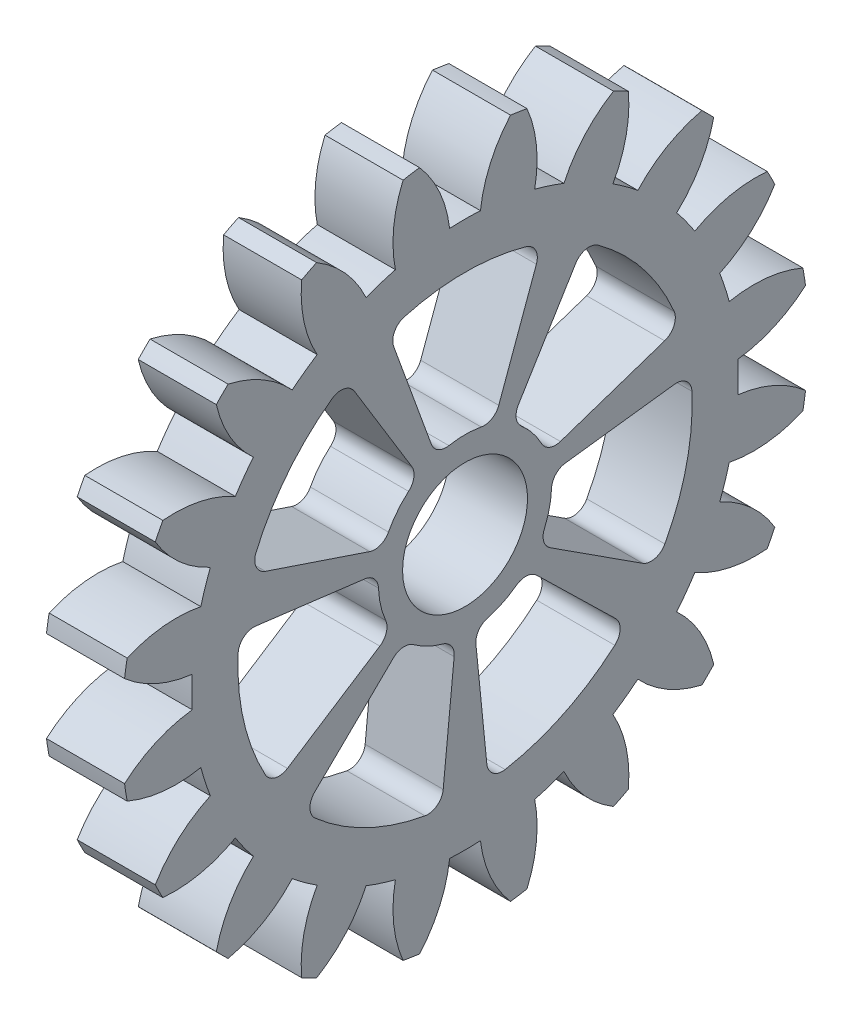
ISO-10303-21;
HEADER;
FILE_DESCRIPTION(('STEP AP214'),'2;1');
FILE_NAME('part.step','',(''),(''),'','','');
FILE_SCHEMA(('AUTOMOTIVE_DESIGN { 1 0 10303 214 1 1 1 1 }'));
ENDSEC;
DATA;
#1=APPLICATION_CONTEXT('core data for automotive mechanical design processes');
#2=APPLICATION_PROTOCOL_DEFINITION('international standard','automotive_design',2000,#1);
#3=PRODUCT_CONTEXT('',#1,'mechanical');
#4=PRODUCT('Part','Part','',(#3));
#5=PRODUCT_RELATED_PRODUCT_CATEGORY('part','',(#4));
#6=PRODUCT_DEFINITION_FORMATION('','',#4);
#7=PRODUCT_DEFINITION_CONTEXT('part definition',#1,'design');
#8=PRODUCT_DEFINITION('design','',#6,#7);
#9=PRODUCT_DEFINITION_SHAPE('','',#8);
#10=(LENGTH_UNIT() NAMED_UNIT(*) SI_UNIT(.MILLI.,.METRE.));
#11=(NAMED_UNIT(*) PLANE_ANGLE_UNIT() SI_UNIT($,.RADIAN.));
#12=(NAMED_UNIT(*) SI_UNIT($,.STERADIAN.) SOLID_ANGLE_UNIT());
#13=UNCERTAINTY_MEASURE_WITH_UNIT(LENGTH_MEASURE(1.E-05),#10,'distance_accuracy_value','');
#14=(GEOMETRIC_REPRESENTATION_CONTEXT(3) GLOBAL_UNCERTAINTY_ASSIGNED_CONTEXT((#13)) GLOBAL_UNIT_ASSIGNED_CONTEXT((#10,
#11,#12)) REPRESENTATION_CONTEXT('',''));
#15=CARTESIAN_POINT('',(0.,0.,0.));
#16=DIRECTION('',(0.,0.,1.));
#17=DIRECTION('',(1.,0.,0.));
#18=AXIS2_PLACEMENT_3D('',#15,#16,#17);
#19=CARTESIAN_POINT('',(5.,0.,0.));
#20=DIRECTION('',(-1.,0.,0.));
#21=DIRECTION('',(0.,0.,1.));
#22=AXIS2_PLACEMENT_3D('',#19,#20,#21);
#23=PLANE('',#22);
#24=CARTESIAN_POINT('',(5.,0.,0.));
#25=DIRECTION('',(-1.,0.,0.));
#26=DIRECTION('',(0.,0.,1.));
#27=AXIS2_PLACEMENT_3D('',#24,#25,#26);
#28=CIRCLE('',#27,4.);
#29=CARTESIAN_POINT('',(5.,0.,4.));
#30=VERTEX_POINT('',#29);
#31=EDGE_CURVE('E1159',#30,#30,#28,.F.);
#32=ORIENTED_EDGE('',*,*,#31,.F.);
#33=EDGE_LOOP('',(#32));
#34=FACE_BOUND('',#33,.T.);
#35=CARTESIAN_POINT('',(5.,8.93132593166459,16.5360305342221));
#36=DIRECTION('',(-1.,0.,0.));
#37=DIRECTION('',(0.,1.,0.));
#38=AXIS2_PLACEMENT_3D('',#35,#36,#37);
#39=CIRCLE('',#38,8.);
#40=CARTESIAN_POINT('',(5.,0.986171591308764,17.471189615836));
#41=VERTEX_POINT('',#40);
#42=CARTESIAN_POINT('',(5.,2.91269635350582,21.8063339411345));
#43=VERTEX_POINT('',#42);
#44=EDGE_CURVE('E1182',#41,#43,#39,.T.);
#45=ORIENTED_EDGE('',*,*,#44,.F.);
#46=CARTESIAN_POINT('',(5.,0.,0.));
#47=DIRECTION('',(-1.,0.,0.));
#48=DIRECTION('',(0.,1.,0.));
#49=AXIS2_PLACEMENT_3D('',#46,#47,#48);
#50=CIRCLE('',#49,17.499);
#51=CARTESIAN_POINT('',(5.,-0.986171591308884,17.471189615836));
#52=VERTEX_POINT('',#51);
#53=EDGE_CURVE('E1187',#52,#41,#50,.T.);
#54=ORIENTED_EDGE('',*,*,#53,.F.);
#55=CARTESIAN_POINT('',(5.,-8.93132593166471,16.536030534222));
#56=DIRECTION('',(-1.,0.,0.));
#57=DIRECTION('',(0.,1.,0.));
#58=AXIS2_PLACEMENT_3D('',#55,#56,#57);
#59=CIRCLE('',#58,8.);
#60=CARTESIAN_POINT('',(5.,-2.91269635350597,21.8063339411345));
#61=VERTEX_POINT('',#60);
#62=EDGE_CURVE('E1184',#61,#52,#59,.T.);
#63=ORIENTED_EDGE('',*,*,#62,.F.);
#64=CARTESIAN_POINT('',(5.,0.,0.));
#65=DIRECTION('',(-1.,0.,0.));
#66=DIRECTION('',(0.,0.,1.));
#67=AXIS2_PLACEMENT_3D('',#64,#65,#66);
#68=CIRCLE('',#67,22.);
#69=CARTESIAN_POINT('',(5.,-3.96838892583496,21.6391286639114));
#70=VERTEX_POINT('',#69);
#71=EDGE_CURVE('E3404',#70,#61,#68,.T.);
#72=ORIENTED_EDGE('',*,*,#71,.F.);
#73=CARTESIAN_POINT('',(5.,3.38428127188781,18.4866310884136));
#74=DIRECTION('',(-1.,0.,0.));
#75=DIRECTION('',(0.,0.951056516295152,0.309016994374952));
#76=AXIS2_PLACEMENT_3D('',#73,#74,#75);
#77=CIRCLE('',#76,8.);
#78=CARTESIAN_POINT('',(5.,-4.46098958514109,16.9208325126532));
#79=VERTEX_POINT('',#78);
#80=EDGE_CURVE('E1303',#79,#70,#77,.T.);
#81=ORIENTED_EDGE('',*,*,#80,.F.);
#82=CARTESIAN_POINT('',(5.,0.,0.));
#83=DIRECTION('',(-1.,0.,0.));
#84=DIRECTION('',(0.,0.951056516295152,0.309016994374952));
#85=AXIS2_PLACEMENT_3D('',#82,#83,#84);
#86=CIRCLE('',#85,17.499);
#87=CARTESIAN_POINT('',(5.,-6.33679942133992,16.3113449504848));
#88=VERTEX_POINT('',#87);
#89=EDGE_CURVE('E1308',#88,#79,#86,.T.);
#90=ORIENTED_EDGE('',*,*,#89,.F.);
#91=CARTESIAN_POINT('',(5.,-13.6041101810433,12.9667680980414));
#92=DIRECTION('',(-1.,0.,0.));
#93=DIRECTION('',(0.,0.951056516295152,0.309016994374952));
#94=AXIS2_PLACEMENT_3D('',#91,#92,#93);
#95=CIRCLE('',#94,8.);
#96=CARTESIAN_POINT('',(5.,-9.50866661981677,19.8389833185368));
#97=VERTEX_POINT('',#96);
#98=EDGE_CURVE('E1305',#97,#88,#95,.T.);
#99=ORIENTED_EDGE('',*,*,#98,.F.);
#100=CARTESIAN_POINT('',(5.,-10.4610206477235,19.3537347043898));
#101=VERTEX_POINT('',#100);
#102=EDGE_CURVE('E3393',#101,#97,#68,.T.);
#103=ORIENTED_EDGE('',*,*,#102,.F.);
#104=CARTESIAN_POINT('',(5.,-2.49404041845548,18.6276313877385));
#105=DIRECTION('',(-1.,0.,0.));
#106=DIRECTION('',(0.,0.809016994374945,0.587785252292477));
#107=AXIS2_PLACEMENT_3D('',#104,#105,#106);
#108=CIRCLE('',#107,8.);
#109=CARTESIAN_POINT('',(5.,-9.47147801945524,14.7141464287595));
#110=VERTEX_POINT('',#109);
#111=EDGE_CURVE('E1286',#110,#101,#108,.T.);
#112=ORIENTED_EDGE('',*,*,#111,.F.);
#113=CARTESIAN_POINT('',(5.,0.,0.));
#114=DIRECTION('',(-1.,0.,0.));
#115=DIRECTION('',(0.,0.809016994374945,0.587785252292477));
#116=AXIS2_PLACEMENT_3D('',#113,#114,#115);
#117=CIRCLE('',#116,17.499);
#118=CARTESIAN_POINT('',(5.,-11.0671371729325,13.5548321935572));
#119=VERTEX_POINT('',#118);
#120=EDGE_CURVE('E1291',#119,#110,#117,.T.);
#121=ORIENTED_EDGE('',*,*,#120,.F.);
#122=CARTESIAN_POINT('',(5.,-16.9452293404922,8.1282280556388));
#123=DIRECTION('',(-1.,0.,0.));
#124=DIRECTION('',(0.,0.809016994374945,0.587785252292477));
#125=AXIS2_PLACEMENT_3D('',#122,#123,#124);
#126=CIRCLE('',#125,8.);
#127=CARTESIAN_POINT('',(5.,-15.1738623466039,15.9296547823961));
#128=VERTEX_POINT('',#127);
#129=EDGE_CURVE('E1288',#128,#119,#126,.T.);
#130=ORIENTED_EDGE('',*,*,#129,.F.);
#131=CARTESIAN_POINT('',(5.,-15.9296547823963,15.1738623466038));
#132=VERTEX_POINT('',#131);
#133=EDGE_CURVE('E3382',#132,#128,#68,.T.);
#134=ORIENTED_EDGE('',*,*,#133,.F.);
#135=CARTESIAN_POINT('',(5.,-8.12822805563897,16.9452293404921));
#136=DIRECTION('',(-1.,0.,0.));
#137=DIRECTION('',(0.,0.587785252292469,0.809016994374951));
#138=AXIS2_PLACEMENT_3D('',#135,#136,#137);
#139=CIRCLE('',#138,8.);
#140=CARTESIAN_POINT('',(5.,-13.5548321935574,11.0671371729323));
#141=VERTEX_POINT('',#140);
#142=EDGE_CURVE('E1269',#141,#132,#139,.T.);
#143=ORIENTED_EDGE('',*,*,#142,.F.);
#144=CARTESIAN_POINT('',(5.,0.,0.));
#145=DIRECTION('',(-1.,0.,0.));
#146=DIRECTION('',(0.,0.587785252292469,0.809016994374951));
#147=AXIS2_PLACEMENT_3D('',#144,#145,#146);
#148=CIRCLE('',#147,17.499);
#149=CARTESIAN_POINT('',(5.,-14.7141464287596,9.47147801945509));
#150=VERTEX_POINT('',#149);
#151=EDGE_CURVE('E1274',#150,#141,#148,.T.);
#152=ORIENTED_EDGE('',*,*,#151,.F.);
#153=CARTESIAN_POINT('',(5.,-18.6276313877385,2.49404041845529));
#154=DIRECTION('',(-1.,0.,0.));
#155=DIRECTION('',(0.,0.587785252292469,0.809016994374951));
#156=AXIS2_PLACEMENT_3D('',#153,#154,#155);
#157=CIRCLE('',#156,8.);
#158=CARTESIAN_POINT('',(5.,-19.3537347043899,10.4610206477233));
#159=VERTEX_POINT('',#158);
#160=EDGE_CURVE('E1271',#159,#150,#157,.T.);
#161=ORIENTED_EDGE('',*,*,#160,.F.);
#162=CARTESIAN_POINT('',(5.,-19.8389833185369,9.50866661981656));
#163=VERTEX_POINT('',#162);
#164=EDGE_CURVE('E3371',#163,#159,#68,.T.);
#165=ORIENTED_EDGE('',*,*,#164,.F.);
#166=CARTESIAN_POINT('',(5.,-12.9667680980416,13.6041101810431));
#167=DIRECTION('',(-1.,0.,0.));
#168=DIRECTION('',(0.,0.309016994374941,0.951056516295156));
#169=AXIS2_PLACEMENT_3D('',#166,#167,#168);
#170=CIRCLE('',#169,8.);
#171=CARTESIAN_POINT('',(5.,-16.3113449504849,6.33679942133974));
#172=VERTEX_POINT('',#171);
#173=EDGE_CURVE('E1233',#172,#163,#170,.T.);
#174=ORIENTED_EDGE('',*,*,#173,.F.);
#175=CARTESIAN_POINT('',(5.,0.,0.));
#176=DIRECTION('',(-1.,0.,0.));
#177=DIRECTION('',(0.,0.309016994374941,0.951056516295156));
#178=AXIS2_PLACEMENT_3D('',#175,#176,#177);
#179=CIRCLE('',#178,17.499);
#180=CARTESIAN_POINT('',(5.,-16.9208325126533,4.4609895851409));
#181=VERTEX_POINT('',#180);
#182=EDGE_CURVE('E1238',#181,#172,#179,.T.);
#183=ORIENTED_EDGE('',*,*,#182,.F.);
#184=CARTESIAN_POINT('',(5.,-18.4866310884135,-3.38428127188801));
#185=DIRECTION('',(-1.,0.,0.));
#186=DIRECTION('',(0.,0.309016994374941,0.951056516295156));
#187=AXIS2_PLACEMENT_3D('',#184,#185,#186);
#188=CIRCLE('',#187,8.);
#189=CARTESIAN_POINT('',(5.,-21.6391286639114,3.96838892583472));
#190=VERTEX_POINT('',#189);
#191=EDGE_CURVE('E1235',#190,#181,#188,.T.);
#192=ORIENTED_EDGE('',*,*,#191,.F.);
#193=CARTESIAN_POINT('',(5.,-21.8063339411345,2.91269635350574));
#194=VERTEX_POINT('',#193);
#195=EDGE_CURVE('E3360',#194,#190,#68,.T.);
#196=ORIENTED_EDGE('',*,*,#195,.F.);
#197=CARTESIAN_POINT('',(5.,-16.5360305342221,8.93132593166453));
#198=DIRECTION('',(-1.,0.,0.));
#199=DIRECTION('',(0.,0.,1.));
#200=AXIS2_PLACEMENT_3D('',#197,#198,#199);
#201=CIRCLE('',#200,8.);
#202=CARTESIAN_POINT('',(5.,-17.471189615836,0.986171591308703));
#203=VERTEX_POINT('',#202);
#204=EDGE_CURVE('E1252',#203,#194,#201,.T.);
#205=ORIENTED_EDGE('',*,*,#204,.F.);
#206=CARTESIAN_POINT('',(5.,0.,0.));
#207=DIRECTION('',(-1.,0.,0.));
#208=DIRECTION('',(0.,0.,1.));
#209=AXIS2_PLACEMENT_3D('',#206,#207,#208);
#210=CIRCLE('',#209,17.499);
#211=CARTESIAN_POINT('',(5.,-17.471189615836,-0.986171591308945));
#212=VERTEX_POINT('',#211);
#213=EDGE_CURVE('E1257',#212,#203,#210,.T.);
#214=ORIENTED_EDGE('',*,*,#213,.F.);
#215=CARTESIAN_POINT('',(5.,-16.536030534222,-8.93132593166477));
#216=DIRECTION('',(-1.,0.,0.));
#217=DIRECTION('',(0.,0.,1.));
#218=AXIS2_PLACEMENT_3D('',#215,#216,#217);
#219=CIRCLE('',#218,8.);
#220=CARTESIAN_POINT('',(5.,-21.8063339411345,-2.91269635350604));
#221=VERTEX_POINT('',#220);
#222=EDGE_CURVE('E1254',#221,#212,#219,.T.);
#223=ORIENTED_EDGE('',*,*,#222,.F.);
#224=CARTESIAN_POINT('',(5.,-21.6391286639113,-3.96838892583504));
#225=VERTEX_POINT('',#224);
#226=EDGE_CURVE('E3349',#225,#221,#68,.T.);
#227=ORIENTED_EDGE('',*,*,#226,.F.);
#228=CARTESIAN_POINT('',(5.,-18.4866310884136,3.38428127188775));
#229=DIRECTION('',(-1.,0.,0.));
#230=DIRECTION('',(0.,-0.309016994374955,0.951056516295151));
#231=AXIS2_PLACEMENT_3D('',#228,#229,#230);
#232=CIRCLE('',#231,8.);
#233=CARTESIAN_POINT('',(5.,-16.9208325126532,-4.46098958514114));
#234=VERTEX_POINT('',#233);
#235=EDGE_CURVE('E1371',#234,#225,#232,.T.);
#236=ORIENTED_EDGE('',*,*,#235,.F.);
#237=CARTESIAN_POINT('',(5.,0.,0.));
#238=DIRECTION('',(-1.,0.,0.));
#239=DIRECTION('',(0.,-0.309016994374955,0.951056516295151));
#240=AXIS2_PLACEMENT_3D('',#237,#238,#239);
#241=CIRCLE('',#240,17.499);
#242=CARTESIAN_POINT('',(5.,-16.3113449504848,-6.33679942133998));
#243=VERTEX_POINT('',#242);
#244=EDGE_CURVE('E1376',#243,#234,#241,.T.);
#245=ORIENTED_EDGE('',*,*,#244,.F.);
#246=CARTESIAN_POINT('',(5.,-12.9667680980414,-13.6041101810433));
#247=DIRECTION('',(-1.,0.,0.));
#248=DIRECTION('',(0.,-0.309016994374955,0.951056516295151));
#249=AXIS2_PLACEMENT_3D('',#246,#247,#248);
#250=CIRCLE('',#249,8.);
#251=CARTESIAN_POINT('',(5.,-19.8389833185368,-9.50866661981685));
#252=VERTEX_POINT('',#251);
#253=EDGE_CURVE('E1373',#252,#243,#250,.T.);
#254=ORIENTED_EDGE('',*,*,#253,.F.);
#255=CARTESIAN_POINT('',(5.,-19.3537347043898,-10.4610206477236));
#256=VERTEX_POINT('',#255);
#257=EDGE_CURVE('E3338',#256,#252,#68,.T.);
#258=ORIENTED_EDGE('',*,*,#257,.F.);
#259=CARTESIAN_POINT('',(5.,-18.6276313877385,-2.49404041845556));
#260=DIRECTION('',(-1.,0.,0.));
#261=DIRECTION('',(0.,-0.58778525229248,0.809016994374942));
#262=AXIS2_PLACEMENT_3D('',#259,#260,#261);
#263=CIRCLE('',#262,8.);
#264=CARTESIAN_POINT('',(5.,-14.7141464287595,-9.4714780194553));
#265=VERTEX_POINT('',#264);
#266=EDGE_CURVE('E1354',#265,#256,#263,.T.);
#267=ORIENTED_EDGE('',*,*,#266,.F.);
#268=CARTESIAN_POINT('',(5.,0.,0.));
#269=DIRECTION('',(-1.,0.,0.));
#270=DIRECTION('',(0.,-0.58778525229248,0.809016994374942));
#271=AXIS2_PLACEMENT_3D('',#268,#269,#270);
#272=CIRCLE('',#271,17.499);
#273=CARTESIAN_POINT('',(5.,-13.5548321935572,-11.0671371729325));
#274=VERTEX_POINT('',#273);
#275=EDGE_CURVE('E1359',#274,#265,#272,.T.);
#276=ORIENTED_EDGE('',*,*,#275,.F.);
#277=CARTESIAN_POINT('',(5.,-8.12822805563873,-16.9452293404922));
#278=DIRECTION('',(-1.,0.,0.));
#279=DIRECTION('',(0.,-0.58778525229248,0.809016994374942));
#280=AXIS2_PLACEMENT_3D('',#277,#278,#279);
#281=CIRCLE('',#280,8.);
#282=CARTESIAN_POINT('',(5.,-15.9296547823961,-15.173862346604));
#283=VERTEX_POINT('',#282);
#284=EDGE_CURVE('E1356',#283,#274,#281,.T.);
#285=ORIENTED_EDGE('',*,*,#284,.F.);
#286=CARTESIAN_POINT('',(5.,-15.1738623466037,-15.9296547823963));
#287=VERTEX_POINT('',#286);
#288=EDGE_CURVE('E3327',#287,#283,#68,.T.);
#289=ORIENTED_EDGE('',*,*,#288,.F.);
#290=CARTESIAN_POINT('',(5.,-16.945229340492,-8.12822805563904));
#291=DIRECTION('',(-1.,0.,0.));
#292=DIRECTION('',(0.,-0.809016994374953,0.587785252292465));
#293=AXIS2_PLACEMENT_3D('',#290,#291,#292);
#294=CIRCLE('',#293,8.);
#295=CARTESIAN_POINT('',(5.,-11.0671371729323,-13.5548321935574));
#296=VERTEX_POINT('',#295);
#297=EDGE_CURVE('E1337',#296,#287,#294,.T.);
#298=ORIENTED_EDGE('',*,*,#297,.F.);
#299=CARTESIAN_POINT('',(5.,0.,0.));
#300=DIRECTION('',(-1.,0.,0.));
#301=DIRECTION('',(0.,-0.809016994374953,0.587785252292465));
#302=AXIS2_PLACEMENT_3D('',#299,#300,#301);
#303=CIRCLE('',#302,17.499);
#304=CARTESIAN_POINT('',(5.,-9.47147801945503,-14.7141464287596));
#305=VERTEX_POINT('',#304);
#306=EDGE_CURVE('E1342',#305,#296,#303,.T.);
#307=ORIENTED_EDGE('',*,*,#306,.F.);
#308=CARTESIAN_POINT('',(5.,-2.49404041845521,-18.6276313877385));
#309=DIRECTION('',(-1.,0.,0.));
#310=DIRECTION('',(0.,-0.809016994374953,0.587785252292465));
#311=AXIS2_PLACEMENT_3D('',#308,#309,#310);
#312=CIRCLE('',#311,8.);
#313=CARTESIAN_POINT('',(5.,-10.4610206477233,-19.3537347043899));
#314=VERTEX_POINT('',#313);
#315=EDGE_CURVE('E1339',#314,#305,#312,.T.);
#316=ORIENTED_EDGE('',*,*,#315,.F.);
#317=CARTESIAN_POINT('',(5.,-9.50866661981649,-19.838983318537));
#318=VERTEX_POINT('',#317);
#319=EDGE_CURVE('E3316',#318,#314,#68,.T.);
#320=ORIENTED_EDGE('',*,*,#319,.F.);
#321=CARTESIAN_POINT('',(5.,-13.6041101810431,-12.9667680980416));
#322=DIRECTION('',(-1.,0.,0.));
#323=DIRECTION('',(0.,-0.951056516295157,0.309016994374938));
#324=AXIS2_PLACEMENT_3D('',#321,#322,#323);
#325=CIRCLE('',#324,8.);
#326=CARTESIAN_POINT('',(5.,-6.33679942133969,-16.3113449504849));
#327=VERTEX_POINT('',#326);
#328=EDGE_CURVE('E1318',#327,#318,#325,.T.);
#329=ORIENTED_EDGE('',*,*,#328,.F.);
#330=CARTESIAN_POINT('',(5.,0.,0.));
#331=DIRECTION('',(-1.,0.,0.));
#332=DIRECTION('',(0.,-0.951056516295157,0.309016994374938));
#333=AXIS2_PLACEMENT_3D('',#330,#331,#332);
#334=CIRCLE('',#333,17.499);
#335=CARTESIAN_POINT('',(5.,-4.46098958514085,-16.9208325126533));
#336=VERTEX_POINT('',#335);
#337=EDGE_CURVE('E1323',#336,#327,#334,.T.);
#338=ORIENTED_EDGE('',*,*,#337,.F.);
#339=CARTESIAN_POINT('',(5.,3.38428127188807,-18.4866310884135));
#340=DIRECTION('',(-1.,0.,0.));
#341=DIRECTION('',(0.,-0.951056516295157,0.309016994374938));
#342=AXIS2_PLACEMENT_3D('',#339,#340,#341);
#343=CIRCLE('',#342,8.);
#344=CARTESIAN_POINT('',(5.,-3.96838892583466,-21.6391286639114));
#345=VERTEX_POINT('',#344);
#346=EDGE_CURVE('E1320',#345,#336,#343,.T.);
#347=ORIENTED_EDGE('',*,*,#346,.F.);
#348=CARTESIAN_POINT('',(5.,-2.91269635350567,-21.8063339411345));
#349=VERTEX_POINT('',#348);
#350=EDGE_CURVE('E3305',#349,#345,#68,.T.);
#351=ORIENTED_EDGE('',*,*,#350,.F.);
#352=CARTESIAN_POINT('',(5.,-8.93132593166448,-16.5360305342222));
#353=DIRECTION('',(-1.,0.,0.));
#354=DIRECTION('',(0.,-1.,0.));
#355=AXIS2_PLACEMENT_3D('',#352,#353,#354);
#356=CIRCLE('',#355,8.);
#357=CARTESIAN_POINT('',(5.,-0.986171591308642,-17.471189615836));
#358=VERTEX_POINT('',#357);
#359=EDGE_CURVE('E1437',#358,#349,#356,.T.);
#360=ORIENTED_EDGE('',*,*,#359,.F.);
#361=CARTESIAN_POINT('',(5.,0.,0.));
#362=DIRECTION('',(-1.,0.,0.));
#363=DIRECTION('',(0.,-1.,0.));
#364=AXIS2_PLACEMENT_3D('',#361,#362,#363);
#365=CIRCLE('',#364,17.499);
#366=CARTESIAN_POINT('',(5.,0.986171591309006,-17.471189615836));
#367=VERTEX_POINT('',#366);
#368=EDGE_CURVE('E1442',#367,#358,#365,.T.);
#369=ORIENTED_EDGE('',*,*,#368,.F.);
#370=CARTESIAN_POINT('',(5.,8.93132593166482,-16.536030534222));
#371=DIRECTION('',(-1.,0.,0.));
#372=DIRECTION('',(0.,-1.,0.));
#373=AXIS2_PLACEMENT_3D('',#370,#371,#372);
#374=CIRCLE('',#373,8.);
#375=CARTESIAN_POINT('',(5.,2.91269635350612,-21.8063339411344));
#376=VERTEX_POINT('',#375);
#377=EDGE_CURVE('E1439',#376,#367,#374,.T.);
#378=ORIENTED_EDGE('',*,*,#377,.F.);
#379=CARTESIAN_POINT('',(5.,3.96838892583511,-21.6391286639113));
#380=VERTEX_POINT('',#379);
#381=EDGE_CURVE('E3294',#380,#376,#68,.T.);
#382=ORIENTED_EDGE('',*,*,#381,.F.);
#383=CARTESIAN_POINT('',(5.,-3.38428127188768,-18.4866310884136));
#384=DIRECTION('',(-1.,0.,0.));
#385=DIRECTION('',(0.,-0.95105651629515,-0.309016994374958));
#386=AXIS2_PLACEMENT_3D('',#383,#384,#385);
#387=CIRCLE('',#386,8.);
#388=CARTESIAN_POINT('',(5.,4.4609895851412,-16.9208325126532));
#389=VERTEX_POINT('',#388);
#390=EDGE_CURVE('E1454',#389,#380,#387,.T.);
#391=ORIENTED_EDGE('',*,*,#390,.F.);
#392=CARTESIAN_POINT('',(5.,0.,0.));
#393=DIRECTION('',(-1.,0.,0.));
#394=DIRECTION('',(0.,-0.95105651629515,-0.309016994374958));
#395=AXIS2_PLACEMENT_3D('',#392,#393,#394);
#396=CIRCLE('',#395,17.499);
#397=CARTESIAN_POINT('',(5.,6.33679942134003,-16.3113449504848));
#398=VERTEX_POINT('',#397);
#399=EDGE_CURVE('E1459',#398,#389,#396,.T.);
#400=ORIENTED_EDGE('',*,*,#399,.F.);
#401=CARTESIAN_POINT('',(5.,13.6041101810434,-12.9667680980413));
#402=DIRECTION('',(-1.,0.,0.));
#403=DIRECTION('',(0.,-0.95105651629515,-0.309016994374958));
#404=AXIS2_PLACEMENT_3D('',#401,#402,#403);
#405=CIRCLE('',#404,8.);
#406=CARTESIAN_POINT('',(5.,9.50866661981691,-19.8389833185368));
#407=VERTEX_POINT('',#406);
#408=EDGE_CURVE('E1456',#407,#398,#405,.T.);
#409=ORIENTED_EDGE('',*,*,#408,.F.);
#410=CARTESIAN_POINT('',(5.,10.4610206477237,-19.3537347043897));
#411=VERTEX_POINT('',#410);
#412=EDGE_CURVE('E3282',#411,#407,#68,.T.);
#413=ORIENTED_EDGE('',*,*,#412,.F.);
#414=CARTESIAN_POINT('',(5.,2.49404041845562,-18.6276313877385));
#415=DIRECTION('',(-1.,0.,0.));
#416=DIRECTION('',(0.,-0.80901699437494,-0.587785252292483));
#417=AXIS2_PLACEMENT_3D('',#414,#415,#416);
#418=CIRCLE('',#417,8.);
#419=CARTESIAN_POINT('',(5.,9.47147801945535,-14.7141464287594));
#420=VERTEX_POINT('',#419);
#421=EDGE_CURVE('E1420',#420,#411,#418,.T.);
#422=ORIENTED_EDGE('',*,*,#421,.F.);
#423=CARTESIAN_POINT('',(5.,0.,0.));
#424=DIRECTION('',(-1.,0.,0.));
#425=DIRECTION('',(0.,-0.80901699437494,-0.587785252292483));
#426=AXIS2_PLACEMENT_3D('',#423,#424,#425);
#427=CIRCLE('',#426,17.499);
#428=CARTESIAN_POINT('',(5.,11.0671371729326,-13.5548321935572));
#429=VERTEX_POINT('',#428);
#430=EDGE_CURVE('E1425',#429,#420,#427,.T.);
#431=ORIENTED_EDGE('',*,*,#430,.F.);
#432=CARTESIAN_POINT('',(5.,16.9452293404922,-8.12822805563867));
#433=DIRECTION('',(-1.,0.,0.));
#434=DIRECTION('',(0.,-0.80901699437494,-0.587785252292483));
#435=AXIS2_PLACEMENT_3D('',#432,#433,#434);
#436=CIRCLE('',#435,8.);
#437=CARTESIAN_POINT('',(5.,15.173862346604,-15.929654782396));
#438=VERTEX_POINT('',#437);
#439=EDGE_CURVE('E1422',#438,#429,#436,.T.);
#440=ORIENTED_EDGE('',*,*,#439,.F.);
#441=CARTESIAN_POINT('',(5.,15.9296547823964,-15.1738623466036));
#442=VERTEX_POINT('',#441);
#443=EDGE_CURVE('E3456',#442,#438,#68,.T.);
#444=ORIENTED_EDGE('',*,*,#443,.F.);
#445=CARTESIAN_POINT('',(5.,8.1282280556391,-16.945229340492));
#446=DIRECTION('',(-1.,0.,0.));
#447=DIRECTION('',(0.,-0.587785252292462,-0.809016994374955));
#448=AXIS2_PLACEMENT_3D('',#445,#446,#447);
#449=CIRCLE('',#448,8.);
#450=CARTESIAN_POINT('',(5.,13.5548321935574,-11.0671371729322));
#451=VERTEX_POINT('',#450);
#452=EDGE_CURVE('E1403',#451,#442,#449,.T.);
#453=ORIENTED_EDGE('',*,*,#452,.F.);
#454=CARTESIAN_POINT('',(5.,0.,0.));
#455=DIRECTION('',(-1.,0.,0.));
#456=DIRECTION('',(0.,-0.587785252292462,-0.809016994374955));
#457=AXIS2_PLACEMENT_3D('',#454,#455,#456);
#458=CIRCLE('',#457,17.499);
#459=CARTESIAN_POINT('',(5.,14.7141464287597,-9.47147801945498));
#460=VERTEX_POINT('',#459);
#461=EDGE_CURVE('E1408',#460,#451,#458,.T.);
#462=ORIENTED_EDGE('',*,*,#461,.F.);
#463=CARTESIAN_POINT('',(5.,18.6276313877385,-2.49404041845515));
#464=DIRECTION('',(-1.,0.,0.));
#465=DIRECTION('',(0.,-0.587785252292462,-0.809016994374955));
#466=AXIS2_PLACEMENT_3D('',#463,#464,#465);
#467=CIRCLE('',#466,8.);
#468=CARTESIAN_POINT('',(5.,19.35373470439,-10.4610206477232));
#469=VERTEX_POINT('',#468);
#470=EDGE_CURVE('E1405',#469,#460,#467,.T.);
#471=ORIENTED_EDGE('',*,*,#470,.F.);
#472=CARTESIAN_POINT('',(5.,19.838983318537,-9.50866661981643));
#473=VERTEX_POINT('',#472);
#474=EDGE_CURVE('E1595',#473,#469,#68,.T.);
#475=ORIENTED_EDGE('',*,*,#474,.F.);
#476=CARTESIAN_POINT('',(5.,12.9667680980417,-13.604110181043));
#477=DIRECTION('',(-1.,0.,0.));
#478=DIRECTION('',(0.,-0.309016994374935,-0.951056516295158));
#479=AXIS2_PLACEMENT_3D('',#476,#477,#478);
#480=CIRCLE('',#479,8.);
#481=CARTESIAN_POINT('',(5.,16.3113449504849,-6.33679942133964));
#482=VERTEX_POINT('',#481);
#483=EDGE_CURVE('E1386',#482,#473,#480,.T.);
#484=ORIENTED_EDGE('',*,*,#483,.F.);
#485=CARTESIAN_POINT('',(5.,0.,0.));
#486=DIRECTION('',(-1.,0.,0.));
#487=DIRECTION('',(0.,-0.309016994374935,-0.951056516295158));
#488=AXIS2_PLACEMENT_3D('',#485,#486,#487);
#489=CIRCLE('',#488,17.499);
#490=CARTESIAN_POINT('',(5.,16.9208325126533,-4.46098958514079));
#491=VERTEX_POINT('',#490);
#492=EDGE_CURVE('E1391',#491,#482,#489,.T.);
#493=ORIENTED_EDGE('',*,*,#492,.F.);
#494=CARTESIAN_POINT('',(5.,18.4866310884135,3.38428127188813));
#495=DIRECTION('',(-1.,0.,0.));
#496=DIRECTION('',(0.,-0.309016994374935,-0.951056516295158));
#497=AXIS2_PLACEMENT_3D('',#494,#495,#496);
#498=CIRCLE('',#497,8.);
#499=CARTESIAN_POINT('',(5.,21.6391286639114,-3.96838892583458));
#500=VERTEX_POINT('',#499);
#501=EDGE_CURVE('E1388',#500,#491,#498,.T.);
#502=ORIENTED_EDGE('',*,*,#501,.F.);
#503=CARTESIAN_POINT('',(5.,21.8063339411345,-2.91269635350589));
#504=VERTEX_POINT('',#503);
#505=EDGE_CURVE('E1591',#504,#500,#68,.T.);
#506=ORIENTED_EDGE('',*,*,#505,.F.);
#507=CARTESIAN_POINT('',(5.,16.5360305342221,-8.93132593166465));
#508=DIRECTION('',(-1.,0.,0.));
#509=DIRECTION('',(0.,0.,-1.));
#510=AXIS2_PLACEMENT_3D('',#507,#508,#509);
#511=CIRCLE('',#510,8.);
#512=CARTESIAN_POINT('',(5.,17.471189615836,-0.986171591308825));
#513=VERTEX_POINT('',#512);
#514=EDGE_CURVE('E1563',#513,#504,#511,.T.);
#515=ORIENTED_EDGE('',*,*,#514,.F.);
#516=CARTESIAN_POINT('',(5.,0.,0.));
#517=DIRECTION('',(-1.,0.,0.));
#518=DIRECTION('',(0.,0.,-1.));
#519=AXIS2_PLACEMENT_3D('',#516,#517,#518);
#520=CIRCLE('',#519,17.499);
#521=CARTESIAN_POINT('',(5.,17.471189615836,0.986171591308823));
#522=VERTEX_POINT('',#521);
#523=EDGE_CURVE('E1568',#522,#513,#520,.T.);
#524=ORIENTED_EDGE('',*,*,#523,.F.);
#525=CARTESIAN_POINT('',(5.,16.5360305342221,8.93132593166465));
#526=DIRECTION('',(-1.,0.,0.));
#527=DIRECTION('',(0.,0.,-1.));
#528=AXIS2_PLACEMENT_3D('',#525,#526,#527);
#529=CIRCLE('',#528,8.);
#530=CARTESIAN_POINT('',(5.,21.8063339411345,2.91269635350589));
#531=VERTEX_POINT('',#530);
#532=EDGE_CURVE('E1565',#531,#522,#529,.T.);
#533=ORIENTED_EDGE('',*,*,#532,.F.);
#534=CARTESIAN_POINT('',(5.,21.6391286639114,3.96838892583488));
#535=VERTEX_POINT('',#534);
#536=EDGE_CURVE('E1588',#535,#531,#68,.T.);
#537=ORIENTED_EDGE('',*,*,#536,.F.);
#538=CARTESIAN_POINT('',(5.,18.4866310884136,-3.38428127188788));
#539=DIRECTION('',(-1.,0.,0.));
#540=DIRECTION('',(0.,0.309016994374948,-0.951056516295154));
#541=AXIS2_PLACEMENT_3D('',#538,#539,#540);
#542=CIRCLE('',#541,8.);
#543=CARTESIAN_POINT('',(5.,16.9208325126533,4.46098958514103));
#544=VERTEX_POINT('',#543);
#545=EDGE_CURVE('E1541',#544,#535,#542,.T.);
#546=ORIENTED_EDGE('',*,*,#545,.F.);
#547=CARTESIAN_POINT('',(5.,0.,0.));
#548=DIRECTION('',(-1.,0.,0.));
#549=DIRECTION('',(0.,0.309016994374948,-0.951056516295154));
#550=AXIS2_PLACEMENT_3D('',#547,#548,#549);
#551=CIRCLE('',#550,17.499);
#552=CARTESIAN_POINT('',(5.,16.3113449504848,6.33679942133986));
#553=VERTEX_POINT('',#552);
#554=EDGE_CURVE('E1546',#553,#544,#551,.T.);
#555=ORIENTED_EDGE('',*,*,#554,.F.);
#556=CARTESIAN_POINT('',(5.,12.9667680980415,13.6041101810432));
#557=DIRECTION('',(-1.,0.,0.));
#558=DIRECTION('',(0.,0.309016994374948,-0.951056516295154));
#559=AXIS2_PLACEMENT_3D('',#556,#557,#558);
#560=CIRCLE('',#559,8.);
#561=CARTESIAN_POINT('',(5.,19.8389833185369,9.5086666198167));
#562=VERTEX_POINT('',#561);
#563=EDGE_CURVE('E1543',#562,#553,#560,.T.);
#564=ORIENTED_EDGE('',*,*,#563,.F.);
#565=CARTESIAN_POINT('',(5.,19.3537347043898,10.4610206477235));
#566=VERTEX_POINT('',#565);
#567=EDGE_CURVE('E1596',#566,#562,#68,.T.);
#568=ORIENTED_EDGE('',*,*,#567,.F.);
#569=CARTESIAN_POINT('',(5.,18.6276313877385,2.49404041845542));
#570=DIRECTION('',(-1.,0.,0.));
#571=DIRECTION('',(0.,0.587785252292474,-0.809016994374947));
#572=AXIS2_PLACEMENT_3D('',#569,#570,#571);
#573=CIRCLE('',#572,8.);
#574=CARTESIAN_POINT('',(5.,14.7141464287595,9.47147801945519));
#575=VERTEX_POINT('',#574);
#576=EDGE_CURVE('E1216',#575,#566,#573,.T.);
#577=ORIENTED_EDGE('',*,*,#576,.F.);
#578=CARTESIAN_POINT('',(5.,0.,0.));
#579=DIRECTION('',(-1.,0.,0.));
#580=DIRECTION('',(0.,0.587785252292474,-0.809016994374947));
#581=AXIS2_PLACEMENT_3D('',#578,#579,#580);
#582=CIRCLE('',#581,17.499);
#583=CARTESIAN_POINT('',(5.,13.5548321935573,11.0671371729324));
#584=VERTEX_POINT('',#583);
#585=EDGE_CURVE('E1221',#584,#575,#582,.T.);
#586=ORIENTED_EDGE('',*,*,#585,.F.);
#587=CARTESIAN_POINT('',(5.,8.12822805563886,16.9452293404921));
#588=DIRECTION('',(-1.,0.,0.));
#589=DIRECTION('',(0.,0.587785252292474,-0.809016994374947));
#590=AXIS2_PLACEMENT_3D('',#587,#588,#589);
#591=CIRCLE('',#590,8.);
#592=CARTESIAN_POINT('',(5.,15.9296547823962,15.1738623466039));
#593=VERTEX_POINT('',#592);
#594=EDGE_CURVE('E1218',#593,#584,#591,.T.);
#595=ORIENTED_EDGE('',*,*,#594,.F.);
#596=CARTESIAN_POINT('',(5.,15.1738623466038,15.9296547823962));
#597=VERTEX_POINT('',#596);
#598=EDGE_CURVE('E3434',#597,#593,#68,.T.);
#599=ORIENTED_EDGE('',*,*,#598,.F.);
#600=CARTESIAN_POINT('',(5.,16.9452293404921,8.12822805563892));
#601=DIRECTION('',(-1.,0.,0.));
#602=DIRECTION('',(0.,0.809016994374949,-0.587785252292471));
#603=AXIS2_PLACEMENT_3D('',#600,#601,#602);
#604=CIRCLE('',#603,8.);
#605=CARTESIAN_POINT('',(5.,11.0671371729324,13.5548321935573));
#606=VERTEX_POINT('',#605);
#607=EDGE_CURVE('E1199',#606,#597,#604,.T.);
#608=ORIENTED_EDGE('',*,*,#607,.F.);
#609=CARTESIAN_POINT('',(5.,0.,0.));
#610=DIRECTION('',(-1.,0.,0.));
#611=DIRECTION('',(0.,0.809016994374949,-0.587785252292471));
#612=AXIS2_PLACEMENT_3D('',#609,#610,#611);
#613=CIRCLE('',#612,17.499);
#614=CARTESIAN_POINT('',(5.,9.47147801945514,14.7141464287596));
#615=VERTEX_POINT('',#614);
#616=EDGE_CURVE('E1204',#615,#606,#613,.T.);
#617=ORIENTED_EDGE('',*,*,#616,.F.);
#618=CARTESIAN_POINT('',(5.,2.49404041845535,18.6276313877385));
#619=DIRECTION('',(-1.,0.,0.));
#620=DIRECTION('',(0.,0.809016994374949,-0.587785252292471));
#621=AXIS2_PLACEMENT_3D('',#618,#619,#620);
#622=CIRCLE('',#621,8.);
#623=CARTESIAN_POINT('',(5.,10.4610206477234,19.3537347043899));
#624=VERTEX_POINT('',#623);
#625=EDGE_CURVE('E1201',#624,#615,#622,.T.);
#626=ORIENTED_EDGE('',*,*,#625,.F.);
#627=CARTESIAN_POINT('',(5.,9.50866661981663,19.8389833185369));
#628=VERTEX_POINT('',#627);
#629=EDGE_CURVE('E3423',#628,#624,#68,.T.);
#630=ORIENTED_EDGE('',*,*,#629,.F.);
#631=CARTESIAN_POINT('',(5.,13.6041101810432,12.9667680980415));
#632=DIRECTION('',(-1.,0.,0.));
#633=DIRECTION('',(0.,0.951056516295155,-0.309016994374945));
#634=AXIS2_PLACEMENT_3D('',#631,#632,#633);
#635=CIRCLE('',#634,8.);
#636=CARTESIAN_POINT('',(5.,6.33679942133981,16.3113449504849));
#637=VERTEX_POINT('',#636);
#638=EDGE_CURVE('E1163',#637,#628,#635,.T.);
#639=ORIENTED_EDGE('',*,*,#638,.F.);
#640=CARTESIAN_POINT('',(5.,0.,0.));
#641=DIRECTION('',(-1.,0.,0.));
#642=DIRECTION('',(0.,0.951056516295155,-0.309016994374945));
#643=AXIS2_PLACEMENT_3D('',#640,#641,#642);
#644=CIRCLE('',#643,17.499);
#645=CARTESIAN_POINT('',(5.,4.46098958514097,16.9208325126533));
#646=VERTEX_POINT('',#645);
#647=EDGE_CURVE('E1168',#646,#637,#644,.T.);
#648=ORIENTED_EDGE('',*,*,#647,.F.);
#649=CARTESIAN_POINT('',(5.,-3.38428127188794,18.4866310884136));
#650=DIRECTION('',(-1.,0.,0.));
#651=DIRECTION('',(0.,0.951056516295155,-0.309016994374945));
#652=AXIS2_PLACEMENT_3D('',#649,#650,#651);
#653=CIRCLE('',#652,8.);
#654=CARTESIAN_POINT('',(5.,3.96838892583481,21.6391286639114));
#655=VERTEX_POINT('',#654);
#656=EDGE_CURVE('E1165',#655,#646,#653,.T.);
#657=ORIENTED_EDGE('',*,*,#656,.F.);
#658=EDGE_CURVE('E3412',#43,#655,#68,.T.);
#659=ORIENTED_EDGE('',*,*,#658,.F.);
#660=EDGE_LOOP('',(#45,#54,#63,#72,#81,#90,#99,#103,#112,#121,#130,#134,#143,#152,#161,#165,
#174,#183,#192,#196,#205,#214,#223,#227,#236,#245,#254,#258,#267,#276,#285,#289,#298,#307,#316,
#320,#329,#338,#347,#351,#360,#369,#378,#382,#391,#400,#409,#413,#422,#431,#440,#444,#453,#462,
#471,#475,#484,#493,#502,#506,#515,#524,#533,#537,#546,#555,#564,#568,#577,#586,#595,#599,#608,
#617,#626,#630,#639,#648,#657,#659));
#661=FACE_BOUND('',#660,.T.);
#662=CARTESIAN_POINT('',(5.,0.,0.));
#663=DIRECTION('',(-1.,0.,0.));
#664=DIRECTION('',(0.,0.,-1.));
#665=AXIS2_PLACEMENT_3D('',#662,#663,#664);
#666=CIRCLE('',#665,5.54621361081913);
#667=CARTESIAN_POINT('',(5.,5.44910276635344,1.03332688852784));
#668=VERTEX_POINT('',#667);
#669=CARTESIAN_POINT('',(5.,5.44910276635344,-1.03332688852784));
#670=VERTEX_POINT('',#669);
#671=EDGE_CURVE('E1120',#668,#670,#666,.T.);
#672=ORIENTED_EDGE('',*,*,#671,.F.);
#673=CARTESIAN_POINT('',(5.,6.43159337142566,1.21963902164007));
#674=DIRECTION('',(1.,0.,0.));
#675=DIRECTION('',(0.,0.,-1.));
#676=AXIS2_PLACEMENT_3D('',#673,#674,#675);
#677=CIRCLE('',#676,1.);
#678=CARTESIAN_POINT('',(5.,6.08957322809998,2.15933164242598));
#679=VERTEX_POINT('',#678);
#680=EDGE_CURVE('E1066',#679,#668,#677,.T.);
#681=ORIENTED_EDGE('',*,*,#680,.F.);
#682=DIRECTION('',(0.,-0.939692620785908,-0.34202014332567));
#683=VECTOR('',#682,1.);
#684=CARTESIAN_POINT('',(5.,12.7101649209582,4.56902995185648));
#685=LINE('',#684,#683);
#686=CARTESIAN_POINT('',(5.,12.7101649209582,4.56902995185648));
#687=VERTEX_POINT('',#686);
#688=EDGE_CURVE('E1138',#687,#679,#685,.T.);
#689=ORIENTED_EDGE('',*,*,#688,.F.);
#690=CARTESIAN_POINT('',(5.,13.0521850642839,3.62933733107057));
#691=DIRECTION('',(1.,0.,0.));
#692=DIRECTION('',(0.,0.,1.));
#693=AXIS2_PLACEMENT_3D('',#690,#691,#692);
#694=CIRCLE('',#693,1.);
#695=CARTESIAN_POINT('',(5.,14.015631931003,3.89723681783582));
#696=VERTEX_POINT('',#695);
#697=EDGE_CURVE('E1135',#696,#687,#694,.T.);
#698=ORIENTED_EDGE('',*,*,#697,.F.);
#699=CARTESIAN_POINT('',(5.,0.,0.));
#700=DIRECTION('',(1.,0.,0.));
#701=DIRECTION('',(0.,0.,-1.));
#702=AXIS2_PLACEMENT_3D('',#699,#700,#701);
#703=CIRCLE('',#702,14.5473844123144);
#704=CARTESIAN_POINT('',(5.,14.015631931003,-3.89723681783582));
#705=VERTEX_POINT('',#704);
#706=EDGE_CURVE('E1132',#705,#696,#703,.T.);
#707=ORIENTED_EDGE('',*,*,#706,.F.);
#708=CARTESIAN_POINT('',(5.,13.0521850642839,-3.62933733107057));
#709=DIRECTION('',(1.,0.,0.));
#710=DIRECTION('',(0.,0.,-1.));
#711=AXIS2_PLACEMENT_3D('',#708,#709,#710);
#712=CIRCLE('',#711,1.);
#713=CARTESIAN_POINT('',(5.,12.7101649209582,-4.56902995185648));
#714=VERTEX_POINT('',#713);
#715=EDGE_CURVE('E1129',#714,#705,#712,.T.);
#716=ORIENTED_EDGE('',*,*,#715,.F.);
#717=DIRECTION('',(0.,0.939692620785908,-0.34202014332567));
#718=VECTOR('',#717,1.);
#719=CARTESIAN_POINT('',(5.,12.7101649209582,-4.56902995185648));
#720=LINE('',#719,#718);
#721=CARTESIAN_POINT('',(5.,6.08957322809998,-2.15933164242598));
#722=VERTEX_POINT('',#721);
#723=EDGE_CURVE('E1126',#722,#714,#720,.T.);
#724=ORIENTED_EDGE('',*,*,#723,.F.);
#725=CARTESIAN_POINT('',(5.,6.43159337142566,-1.21963902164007));
#726=DIRECTION('',(1.,0.,0.));
#727=DIRECTION('',(0.,0.,1.));
#728=AXIS2_PLACEMENT_3D('',#725,#726,#727);
#729=CIRCLE('',#728,1.);
#730=EDGE_CURVE('E1123',#670,#722,#729,.T.);
#731=ORIENTED_EDGE('',*,*,#730,.F.);
#732=EDGE_LOOP('',(#672,#681,#689,#698,#707,#716,#724,#731));
#733=FACE_BOUND('',#732,.T.);
#734=CARTESIAN_POINT('',(5.,0.,0.));
#735=DIRECTION('',(-1.,0.,0.));
#736=DIRECTION('',(0.,0.,-1.));
#737=AXIS2_PLACEMENT_3D('',#734,#735,#736);
#738=CIRCLE('',#737,5.54621361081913);
#739=CARTESIAN_POINT('',(5.,2.58957251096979,4.90454887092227));
#740=VERTEX_POINT('',#739);
#741=CARTESIAN_POINT('',(5.,4.20534749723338,3.61601131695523));
#742=VERTEX_POINT('',#741);
#743=EDGE_CURVE('E924',#740,#742,#738,.T.);
#744=ORIENTED_EDGE('',*,*,#743,.F.);
#745=CARTESIAN_POINT('',(5.,3.05648069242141,5.78885467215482));
#746=DIRECTION('',(1.,0.,0.));
#747=DIRECTION('',(0.,0.,-1.));
#748=AXIS2_PLACEMENT_3D('',#745,#746,#747);
#749=CIRCLE('',#748,1.);
#750=CARTESIAN_POINT('',(5.,2.10855334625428,6.10734132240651));
#751=VERTEX_POINT('',#750);
#752=EDGE_CURVE('E922',#751,#740,#749,.T.);
#753=ORIENTED_EDGE('',*,*,#752,.F.);
#754=DIRECTION('',(0.,-0.318486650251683,-0.947927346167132));
#755=VECTOR('',#754,1.);
#756=CARTESIAN_POINT('',(5.,4.35244674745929,12.7859506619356));
#757=LINE('',#756,#755);
#758=CARTESIAN_POINT('',(5.,4.35244674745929,12.7859506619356));
#759=VERTEX_POINT('',#758);
#760=EDGE_CURVE('E942',#759,#751,#757,.T.);
#761=ORIENTED_EDGE('',*,*,#760,.F.);
#762=CARTESIAN_POINT('',(5.,5.30037409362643,12.4674640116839));
#763=DIRECTION('',(1.,0.,0.));
#764=DIRECTION('',(0.,0.,1.));
#765=AXIS2_PLACEMENT_3D('',#762,#763,#764);
#766=CIRCLE('',#765,1.);
#767=CARTESIAN_POINT('',(5.,5.69162113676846,13.3877497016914));
#768=VERTEX_POINT('',#767);
#769=EDGE_CURVE('E939',#768,#759,#766,.T.);
#770=ORIENTED_EDGE('',*,*,#769,.F.);
#771=CARTESIAN_POINT('',(5.,0.,0.));
#772=DIRECTION('',(1.,0.,0.));
#773=DIRECTION('',(0.,0.,-1.));
#774=AXIS2_PLACEMENT_3D('',#771,#772,#773);
#775=CIRCLE('',#774,14.5473844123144);
#776=CARTESIAN_POINT('',(5.,11.7855860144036,8.52797487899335));
#777=VERTEX_POINT('',#776);
#778=EDGE_CURVE('E936',#777,#768,#775,.T.);
#779=ORIENTED_EDGE('',*,*,#778,.F.);
#780=CARTESIAN_POINT('',(5.,10.9754344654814,7.94175438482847));
#781=DIRECTION('',(1.,0.,0.));
#782=DIRECTION('',(0.,0.,-1.));
#783=AXIS2_PLACEMENT_3D('',#780,#781,#782);
#784=CIRCLE('',#783,1.);
#785=CARTESIAN_POINT('',(5.,11.4968696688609,7.08846350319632));
#786=VERTEX_POINT('',#785);
#787=EDGE_CURVE('E933',#786,#777,#784,.T.);
#788=ORIENTED_EDGE('',*,*,#787,.F.);
#789=DIRECTION('',(0.,0.853290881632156,0.521435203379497));
#790=VECTOR('',#789,1.);
#791=CARTESIAN_POINT('',(5.,11.4968696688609,7.08846350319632));
#792=LINE('',#791,#790);
#793=CARTESIAN_POINT('',(5.,5.48502026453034,3.41469880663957));
#794=VERTEX_POINT('',#793);
#795=EDGE_CURVE('E930',#794,#786,#792,.T.);
#796=ORIENTED_EDGE('',*,*,#795,.F.);
#797=CARTESIAN_POINT('',(5.,4.96358506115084,4.26798968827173));
#798=DIRECTION('',(1.,0.,0.));
#799=DIRECTION('',(0.,0.,1.));
#800=AXIS2_PLACEMENT_3D('',#797,#798,#799);
#801=CIRCLE('',#800,1.);
#802=EDGE_CURVE('E927',#742,#794,#801,.T.);
#803=ORIENTED_EDGE('',*,*,#802,.F.);
#804=EDGE_LOOP('',(#744,#753,#761,#770,#779,#788,#796,#803));
#805=FACE_BOUND('',#804,.T.);
#806=CARTESIAN_POINT('',(5.,0.,0.));
#807=DIRECTION('',(-1.,0.,0.));
#808=DIRECTION('',(0.,0.,-1.));
#809=AXIS2_PLACEMENT_3D('',#806,#807,#808);
#810=CIRCLE('',#809,5.54621361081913);
#811=CARTESIAN_POINT('',(5.,-2.21995866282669,5.08254551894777));
#812=VERTEX_POINT('',#811);
#813=CARTESIAN_POINT('',(5.,-0.205120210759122,5.54241924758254));
#814=VERTEX_POINT('',#813);
#815=EDGE_CURVE('E883',#812,#814,#810,.T.);
#816=ORIENTED_EDGE('',*,*,#815,.F.);
#817=CARTESIAN_POINT('',(5.,-2.62022428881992,5.99894468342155));
#818=DIRECTION('',(1.,0.,0.));
#819=DIRECTION('',(0.,0.,-1.));
#820=AXIS2_PLACEMENT_3D('',#817,#818,#819);
#821=CIRCLE('',#820,1.);
#822=CARTESIAN_POINT('',(5.,-3.46025021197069,5.45639841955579));
#823=VERTEX_POINT('',#822);
#824=EDGE_CURVE('E888',#823,#812,#821,.T.);
#825=ORIENTED_EDGE('',*,*,#824,.F.);
#826=DIRECTION('',(0.,0.542546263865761,-0.840025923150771));
#827=VECTOR('',#826,1.);
#828=CARTESIAN_POINT('',(5.,-7.28275260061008,11.374789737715));
#829=LINE('',#828,#827);
#830=CARTESIAN_POINT('',(5.,-7.28275260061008,11.374789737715));
#831=VERTEX_POINT('',#830);
#832=EDGE_CURVE('E907',#831,#823,#829,.T.);
#833=ORIENTED_EDGE('',*,*,#832,.F.);
#834=CARTESIAN_POINT('',(5.,-6.4427266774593,11.9173360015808));
#835=DIRECTION('',(1.,0.,0.));
#836=DIRECTION('',(0.,0.,1.));
#837=AXIS2_PLACEMENT_3D('',#834,#835,#836);
#838=CIRCLE('',#837,1.);
#839=CARTESIAN_POINT('',(5.,-6.91829646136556,12.7970139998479));
#840=VERTEX_POINT('',#839);
#841=EDGE_CURVE('E904',#840,#831,#838,.T.);
#842=ORIENTED_EDGE('',*,*,#841,.F.);
#843=CARTESIAN_POINT('',(5.,0.,0.));
#844=DIRECTION('',(1.,0.,0.));
#845=DIRECTION('',(0.,0.,-1.));
#846=AXIS2_PLACEMENT_3D('',#843,#844,#845);
#847=CIRCLE('',#846,14.5473844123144);
#848=CARTESIAN_POINT('',(5.,0.680753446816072,14.5314475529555));
#849=VERTEX_POINT('',#848);
#850=EDGE_CURVE('E901',#849,#840,#847,.T.);
#851=ORIENTED_EDGE('',*,*,#850,.F.);
#852=CARTESIAN_POINT('',(5.,0.633957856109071,13.5325430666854));
#853=DIRECTION('',(1.,0.,0.));
#854=DIRECTION('',(0.,0.,-1.));
#855=AXIS2_PLACEMENT_3D('',#852,#853,#854);
#856=CIRCLE('',#855,0.999999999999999);
#857=CARTESIAN_POINT('',(5.,1.62619706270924,13.408199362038));
#858=VERTEX_POINT('',#857);
#859=EDGE_CURVE('E895',#858,#849,#856,.T.);
#860=ORIENTED_EDGE('',*,*,#859,.F.);
#861=DIRECTION('',(0.,0.124343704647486,0.992239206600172));
#862=VECTOR('',#861,1.);
#863=CARTESIAN_POINT('',(5.,1.62619706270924,13.408199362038));
#864=LINE('',#863,#862);
#865=CARTESIAN_POINT('',(5.,0.750135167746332,6.4173914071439));
#866=VERTEX_POINT('',#865);
#867=EDGE_CURVE('E893',#866,#858,#864,.T.);
#868=ORIENTED_EDGE('',*,*,#867,.F.);
#869=CARTESIAN_POINT('',(5.,-0.242104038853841,6.54173511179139));
#870=DIRECTION('',(1.,0.,0.));
#871=DIRECTION('',(0.,0.,1.));
#872=AXIS2_PLACEMENT_3D('',#869,#870,#871);
#873=CIRCLE('',#872,1.);
#874=EDGE_CURVE('E872',#814,#866,#873,.T.);
#875=ORIENTED_EDGE('',*,*,#874,.F.);
#876=EDGE_LOOP('',(#816,#825,#833,#842,#851,#860,#868,#875));
#877=FACE_BOUND('',#876,.T.);
#878=CARTESIAN_POINT('',(5.,0.,0.));
#879=DIRECTION('',(-1.,0.,0.));
#880=DIRECTION('',(0.,0.,-1.));
#881=AXIS2_PLACEMENT_3D('',#878,#879,#880);
#882=CIRCLE('',#881,5.54621361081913);
#883=CARTESIAN_POINT('',(5.,4.20534749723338,-3.61601131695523));
#884=VERTEX_POINT('',#883);
#885=CARTESIAN_POINT('',(5.,2.58957251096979,-4.90454887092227));
#886=VERTEX_POINT('',#885);
#887=EDGE_CURVE('E1041',#884,#886,#882,.T.);
#888=ORIENTED_EDGE('',*,*,#887,.F.);
#889=CARTESIAN_POINT('',(5.,4.96358506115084,-4.26798968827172));
#890=DIRECTION('',(1.,0.,0.));
#891=DIRECTION('',(0.,0.,-1.));
#892=AXIS2_PLACEMENT_3D('',#889,#890,#891);
#893=CIRCLE('',#892,1.);
#894=CARTESIAN_POINT('',(5.,5.48502026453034,-3.41469880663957));
#895=VERTEX_POINT('',#894);
#896=EDGE_CURVE('E1039',#895,#884,#893,.T.);
#897=ORIENTED_EDGE('',*,*,#896,.F.);
#898=DIRECTION('',(0.,-0.853290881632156,0.521435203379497));
#899=VECTOR('',#898,1.);
#900=CARTESIAN_POINT('',(5.,11.4968696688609,-7.08846350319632));
#901=LINE('',#900,#899);
#902=CARTESIAN_POINT('',(5.,11.4968696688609,-7.08846350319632));
#903=VERTEX_POINT('',#902);
#904=EDGE_CURVE('E1060',#903,#895,#901,.T.);
#905=ORIENTED_EDGE('',*,*,#904,.F.);
#906=CARTESIAN_POINT('',(5.,10.9754344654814,-7.94175438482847));
#907=DIRECTION('',(1.,0.,0.));
#908=DIRECTION('',(0.,0.,1.));
#909=AXIS2_PLACEMENT_3D('',#906,#907,#908);
#910=CIRCLE('',#909,1.);
#911=CARTESIAN_POINT('',(5.,11.7855860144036,-8.52797487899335));
#912=VERTEX_POINT('',#911);
#913=EDGE_CURVE('E1057',#912,#903,#910,.T.);
#914=ORIENTED_EDGE('',*,*,#913,.F.);
#915=CARTESIAN_POINT('',(5.,0.,0.));
#916=DIRECTION('',(1.,0.,0.));
#917=DIRECTION('',(0.,0.,-1.));
#918=AXIS2_PLACEMENT_3D('',#915,#916,#917);
#919=CIRCLE('',#918,14.5473844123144);
#920=CARTESIAN_POINT('',(5.,5.69162113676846,-13.3877497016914));
#921=VERTEX_POINT('',#920);
#922=EDGE_CURVE('E1054',#921,#912,#919,.T.);
#923=ORIENTED_EDGE('',*,*,#922,.F.);
#924=CARTESIAN_POINT('',(5.,5.30037409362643,-12.4674640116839));
#925=DIRECTION('',(1.,0.,0.));
#926=DIRECTION('',(0.,0.,-1.));
#927=AXIS2_PLACEMENT_3D('',#924,#925,#926);
#928=CIRCLE('',#927,0.999999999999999);
#929=CARTESIAN_POINT('',(5.,4.3524467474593,-12.7859506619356));
#930=VERTEX_POINT('',#929);
#931=EDGE_CURVE('E1051',#930,#921,#928,.T.);
#932=ORIENTED_EDGE('',*,*,#931,.F.);
#933=DIRECTION('',(0.,0.318486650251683,-0.947927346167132));
#934=VECTOR('',#933,1.);
#935=CARTESIAN_POINT('',(5.,4.3524467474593,-12.7859506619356));
#936=LINE('',#935,#934);
#937=CARTESIAN_POINT('',(5.,2.10855334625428,-6.10734132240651));
#938=VERTEX_POINT('',#937);
#939=EDGE_CURVE('E1048',#938,#930,#936,.T.);
#940=ORIENTED_EDGE('',*,*,#939,.F.);
#941=CARTESIAN_POINT('',(5.,3.05648069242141,-5.78885467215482));
#942=DIRECTION('',(1.,0.,0.));
#943=DIRECTION('',(0.,0.,1.));
#944=AXIS2_PLACEMENT_3D('',#941,#942,#943);
#945=CIRCLE('',#944,1.);
#946=EDGE_CURVE('E1045',#886,#938,#945,.T.);
#947=ORIENTED_EDGE('',*,*,#946,.F.);
#948=EDGE_LOOP('',(#888,#897,#905,#914,#923,#932,#940,#947));
#949=FACE_BOUND('',#948,.T.);
#950=CARTESIAN_POINT('',(5.,0.,0.));
#951=DIRECTION('',(-1.,0.,0.));
#952=DIRECTION('',(0.,0.,-1.));
#953=AXIS2_PLACEMENT_3D('',#950,#951,#952);
#954=CIRCLE('',#953,5.54621361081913);
#955=CARTESIAN_POINT('',(5.,-0.205120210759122,-5.54241924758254));
#956=VERTEX_POINT('',#955);
#957=CARTESIAN_POINT('',(5.,-2.21995866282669,-5.08254551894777));
#958=VERTEX_POINT('',#957);
#959=EDGE_CURVE('E1082',#956,#958,#954,.T.);
#960=ORIENTED_EDGE('',*,*,#959,.F.);
#961=CARTESIAN_POINT('',(5.,-0.242104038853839,-6.54173511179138));
#962=DIRECTION('',(1.,0.,0.));
#963=DIRECTION('',(0.,0.,-1.));
#964=AXIS2_PLACEMENT_3D('',#961,#962,#963);
#965=CIRCLE('',#964,1.);
#966=CARTESIAN_POINT('',(5.,0.750135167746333,-6.4173914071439));
#967=VERTEX_POINT('',#966);
#968=EDGE_CURVE('E988',#967,#956,#965,.T.);
#969=ORIENTED_EDGE('',*,*,#968,.F.);
#970=DIRECTION('',(0.,-0.124343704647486,0.992239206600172));
#971=VECTOR('',#970,1.);
#972=CARTESIAN_POINT('',(5.,1.62619706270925,-13.408199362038));
#973=LINE('',#972,#971);
#974=CARTESIAN_POINT('',(5.,1.62619706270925,-13.408199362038));
#975=VERTEX_POINT('',#974);
#976=EDGE_CURVE('E1100',#975,#967,#973,.T.);
#977=ORIENTED_EDGE('',*,*,#976,.F.);
#978=CARTESIAN_POINT('',(5.,0.633957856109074,-13.5325430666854));
#979=DIRECTION('',(1.,0.,0.));
#980=DIRECTION('',(0.,0.,1.));
#981=AXIS2_PLACEMENT_3D('',#978,#979,#980);
#982=CIRCLE('',#981,1.);
#983=CARTESIAN_POINT('',(5.,0.680753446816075,-14.5314475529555));
#984=VERTEX_POINT('',#983);
#985=EDGE_CURVE('E1097',#984,#975,#982,.T.);
#986=ORIENTED_EDGE('',*,*,#985,.F.);
#987=CARTESIAN_POINT('',(5.,0.,0.));
#988=DIRECTION('',(1.,0.,0.));
#989=DIRECTION('',(0.,0.,-1.));
#990=AXIS2_PLACEMENT_3D('',#987,#988,#989);
#991=CIRCLE('',#990,14.5473844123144);
#992=CARTESIAN_POINT('',(5.,-6.91829646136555,-12.7970139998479));
#993=VERTEX_POINT('',#992);
#994=EDGE_CURVE('E1094',#993,#984,#991,.T.);
#995=ORIENTED_EDGE('',*,*,#994,.F.);
#996=CARTESIAN_POINT('',(5.,-6.4427266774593,-11.9173360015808));
#997=DIRECTION('',(1.,0.,0.));
#998=DIRECTION('',(0.,0.,-1.));
#999=AXIS2_PLACEMENT_3D('',#996,#997,#998);
#1000=CIRCLE('',#999,1.);
#1001=CARTESIAN_POINT('',(5.,-7.28275260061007,-11.374789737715));
#1002=VERTEX_POINT('',#1001);
#1003=EDGE_CURVE('E1091',#1002,#993,#1000,.T.);
#1004=ORIENTED_EDGE('',*,*,#1003,.F.);
#1005=DIRECTION('',(0.,-0.54254626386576,-0.840025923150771));
#1006=VECTOR('',#1005,1.);
#1007=CARTESIAN_POINT('',(5.,-7.28275260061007,-11.374789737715));
#1008=LINE('',#1007,#1006);
#1009=CARTESIAN_POINT('',(5.,-3.46025021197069,-5.4563984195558));
#1010=VERTEX_POINT('',#1009);
#1011=EDGE_CURVE('E1088',#1010,#1002,#1008,.T.);
#1012=ORIENTED_EDGE('',*,*,#1011,.F.);
#1013=CARTESIAN_POINT('',(5.,-2.62022428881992,-5.99894468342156));
#1014=DIRECTION('',(1.,0.,0.));
#1015=DIRECTION('',(0.,0.,1.));
#1016=AXIS2_PLACEMENT_3D('',#1013,#1014,#1015);
#1017=CIRCLE('',#1016,1.);
#1018=EDGE_CURVE('E1085',#958,#1010,#1017,.T.);
#1019=ORIENTED_EDGE('',*,*,#1018,.F.);
#1020=EDGE_LOOP('',(#960,#969,#977,#986,#995,#1004,#1012,#1019));
#1021=FACE_BOUND('',#1020,.T.);
#1022=CARTESIAN_POINT('',(5.,0.,0.));
#1023=DIRECTION('',(-1.,0.,0.));
#1024=DIRECTION('',(0.,0.,-1.));
#1025=AXIS2_PLACEMENT_3D('',#1022,#1023,#1024);
#1026=CIRCLE('',#1025,5.54621361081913);
#1027=CARTESIAN_POINT('',(5.,-4.46112821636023,-3.29527244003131));
#1028=VERTEX_POINT('',#1027);
#1029=CARTESIAN_POINT('',(5.,-5.35781568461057,-1.43328172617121));
#1030=VERTEX_POINT('',#1029);
#1031=EDGE_CURVE('E963',#1028,#1030,#1026,.T.);
#1032=ORIENTED_EDGE('',*,*,#1031,.F.);
#1033=CARTESIAN_POINT('',(5.,-5.2654838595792,-3.88942056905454));
#1034=DIRECTION('',(1.,0.,0.));
#1035=DIRECTION('',(0.,0.,-1.));
#1036=AXIS2_PLACEMENT_3D('',#1033,#1034,#1035);
#1037=CIRCLE('',#1036,1.);
#1038=CARTESIAN_POINT('',(5.,-4.54961701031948,-4.58765738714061));
#1039=VERTEX_POINT('',#1038);
#1040=EDGE_CURVE('E55',#1039,#1028,#1037,.T.);
#1041=ORIENTED_EDGE('',*,*,#1040,.F.);
#1042=DIRECTION('',(0.,0.698236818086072,0.715866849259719));
#1043=VECTOR('',#1042,1.);
#1044=CARTESIAN_POINT('',(5.,-9.46903510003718,-9.63128762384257));
#1045=LINE('',#1044,#1043);
#1046=CARTESIAN_POINT('',(5.,-9.46903510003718,-9.63128762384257));
#1047=VERTEX_POINT('',#1046);
#1048=EDGE_CURVE('E982',#1047,#1039,#1045,.T.);
#1049=ORIENTED_EDGE('',*,*,#1048,.F.);
#1050=CARTESIAN_POINT('',(5.,-10.1849019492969,-8.9330508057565));
#1051=DIRECTION('',(1.,0.,0.));
#1052=DIRECTION('',(0.,0.,1.));
#1053=AXIS2_PLACEMENT_3D('',#1050,#1051,#1052);
#1054=CIRCLE('',#1053,1.);
#1055=CARTESIAN_POINT('',(5.,-10.9367003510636,-9.59244383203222));
#1056=VERTEX_POINT('',#1055);
#1057=EDGE_CURVE('E979',#1056,#1047,#1054,.T.);
#1058=ORIENTED_EDGE('',*,*,#1057,.F.);
#1059=CARTESIAN_POINT('',(5.,0.,0.));
#1060=DIRECTION('',(1.,0.,0.));
#1061=DIRECTION('',(0.,0.,-1.));
#1062=AXIS2_PLACEMENT_3D('',#1059,#1060,#1061);
#1063=CIRCLE('',#1062,14.5473844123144);
#1064=CARTESIAN_POINT('',(5.,-14.318595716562,-2.56986574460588));
#1065=VERTEX_POINT('',#1064);
#1066=EDGE_CURVE('E976',#1065,#1056,#1063,.T.);
#1067=ORIENTED_EDGE('',*,*,#1066,.F.);
#1068=CARTESIAN_POINT('',(5.,-13.3343228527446,-2.39321091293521));
#1069=DIRECTION('',(1.,0.,0.));
#1070=DIRECTION('',(0.,0.,-1.));
#1071=AXIS2_PLACEMENT_3D('',#1068,#1069,#1070);
#1072=CIRCLE('',#1071,0.999999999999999);
#1073=CARTESIAN_POINT('',(5.,-13.4338906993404,-1.39818013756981));
#1074=VERTEX_POINT('',#1073);
#1075=EDGE_CURVE('E973',#1074,#1065,#1072,.T.);
#1076=ORIENTED_EDGE('',*,*,#1075,.F.);
#1077=DIRECTION('',(0.,-0.995030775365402,-0.0995678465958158));
#1078=VECTOR('',#1077,1.);
#1079=CARTESIAN_POINT('',(5.,-13.4338906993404,-1.39818013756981));
#1080=LINE('',#1079,#1078);
#1081=CARTESIAN_POINT('',(5.,-6.42341478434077,-0.696676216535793));
#1082=VERTEX_POINT('',#1081);
#1083=EDGE_CURVE('E970',#1082,#1074,#1080,.T.);
#1084=ORIENTED_EDGE('',*,*,#1083,.F.);
#1085=CARTESIAN_POINT('',(5.,-6.32384693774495,-1.6917069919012));
#1086=DIRECTION('',(1.,0.,0.));
#1087=DIRECTION('',(0.,0.,1.));
#1088=AXIS2_PLACEMENT_3D('',#1085,#1086,#1087);
#1089=CIRCLE('',#1088,1.);
#1090=EDGE_CURVE('E967',#1030,#1082,#1089,.T.);
#1091=ORIENTED_EDGE('',*,*,#1090,.F.);
#1092=EDGE_LOOP('',(#1032,#1041,#1049,#1058,#1067,#1076,#1084,#1091));
#1093=FACE_BOUND('',#1092,.T.);
#1094=CARTESIAN_POINT('',(5.,0.,0.));
#1095=DIRECTION('',(-1.,0.,0.));
#1096=DIRECTION('',(0.,0.,-1.));
#1097=AXIS2_PLACEMENT_3D('',#1094,#1095,#1096);
#1098=CIRCLE('',#1097,5.54621361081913);
#1099=CARTESIAN_POINT('',(5.,-5.35781568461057,1.43328172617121));
#1100=VERTEX_POINT('',#1099);
#1101=CARTESIAN_POINT('',(5.,-4.46112821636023,3.29527244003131));
#1102=VERTEX_POINT('',#1101);
#1103=EDGE_CURVE('E1003',#1100,#1102,#1098,.T.);
#1104=ORIENTED_EDGE('',*,*,#1103,.F.);
#1105=CARTESIAN_POINT('',(5.,-6.32384693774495,1.69170699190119));
#1106=DIRECTION('',(1.,0.,0.));
#1107=DIRECTION('',(0.,0.,-1.));
#1108=AXIS2_PLACEMENT_3D('',#1105,#1106,#1107);
#1109=CIRCLE('',#1108,1.);
#1110=CARTESIAN_POINT('',(5.,-6.42341478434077,0.696676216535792));
#1111=VERTEX_POINT('',#1110);
#1112=EDGE_CURVE('E47',#1111,#1100,#1109,.T.);
#1113=ORIENTED_EDGE('',*,*,#1112,.F.);
#1114=DIRECTION('',(0.,0.995030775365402,-0.0995678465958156));
#1115=VECTOR('',#1114,1.);
#1116=CARTESIAN_POINT('',(5.,-13.4338906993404,1.3981801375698));
#1117=LINE('',#1116,#1115);
#1118=CARTESIAN_POINT('',(5.,-13.4338906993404,1.3981801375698));
#1119=VERTEX_POINT('',#1118);
#1120=EDGE_CURVE('E1021',#1119,#1111,#1117,.T.);
#1121=ORIENTED_EDGE('',*,*,#1120,.F.);
#1122=CARTESIAN_POINT('',(5.,-13.3343228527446,2.39321091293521));
#1123=DIRECTION('',(1.,0.,0.));
#1124=DIRECTION('',(0.,0.,1.));
#1125=AXIS2_PLACEMENT_3D('',#1122,#1123,#1124);
#1126=CIRCLE('',#1125,0.999999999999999);
#1127=CARTESIAN_POINT('',(5.,-14.318595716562,2.56986574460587));
#1128=VERTEX_POINT('',#1127);
#1129=EDGE_CURVE('E1018',#1128,#1119,#1126,.T.);
#1130=ORIENTED_EDGE('',*,*,#1129,.F.);
#1131=CARTESIAN_POINT('',(5.,0.,0.));
#1132=DIRECTION('',(1.,0.,0.));
#1133=DIRECTION('',(0.,0.,-1.));
#1134=AXIS2_PLACEMENT_3D('',#1131,#1132,#1133);
#1135=CIRCLE('',#1134,14.5473844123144);
#1136=CARTESIAN_POINT('',(5.,-10.9367003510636,9.59244383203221));
#1137=VERTEX_POINT('',#1136);
#1138=EDGE_CURVE('E1015',#1137,#1128,#1135,.T.);
#1139=ORIENTED_EDGE('',*,*,#1138,.F.);
#1140=CARTESIAN_POINT('',(5.,-10.1849019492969,8.93305080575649));
#1141=DIRECTION('',(1.,0.,0.));
#1142=DIRECTION('',(0.,0.,-1.));
#1143=AXIS2_PLACEMENT_3D('',#1140,#1141,#1142);
#1144=CIRCLE('',#1143,0.999999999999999);
#1145=CARTESIAN_POINT('',(5.,-9.46903510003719,9.63128762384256));
#1146=VERTEX_POINT('',#1145);
#1147=EDGE_CURVE('E1012',#1146,#1137,#1144,.T.);
#1148=ORIENTED_EDGE('',*,*,#1147,.F.);
#1149=DIRECTION('',(0.,-0.698236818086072,0.715866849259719));
#1150=VECTOR('',#1149,1.);
#1151=CARTESIAN_POINT('',(5.,-9.46903510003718,9.63128762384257));
#1152=LINE('',#1151,#1150);
#1153=CARTESIAN_POINT('',(5.,-4.54961701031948,4.58765738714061));
#1154=VERTEX_POINT('',#1153);
#1155=EDGE_CURVE('E1009',#1154,#1146,#1152,.T.);
#1156=ORIENTED_EDGE('',*,*,#1155,.F.);
#1157=CARTESIAN_POINT('',(5.,-5.2654838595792,3.88942056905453));
#1158=DIRECTION('',(1.,0.,0.));
#1159=DIRECTION('',(0.,0.,1.));
#1160=AXIS2_PLACEMENT_3D('',#1157,#1158,#1159);
#1161=CIRCLE('',#1160,1.);
#1162=EDGE_CURVE('E1006',#1102,#1154,#1161,.T.);
#1163=ORIENTED_EDGE('',*,*,#1162,.F.);
#1164=EDGE_LOOP('',(#1104,#1113,#1121,#1130,#1139,#1148,#1156,#1163));
#1165=FACE_BOUND('',#1164,.T.);
#1166=ADVANCED_FACE('F33',(#34,#661,#733,#805,#877,#949,#1021,#1093,#1165),#23,.F.);
#1167=CARTESIAN_POINT('',(0.,0.,0.));
#1168=DIRECTION('',(1.,0.,0.));
#1169=DIRECTION('',(0.,0.,-1.));
#1170=AXIS2_PLACEMENT_3D('',#1167,#1168,#1169);
#1171=PLANE('',#1170);
#1172=CARTESIAN_POINT('',(0.,0.,0.));
#1173=DIRECTION('',(1.,0.,0.));
#1174=DIRECTION('',(0.,0.,-1.));
#1175=AXIS2_PLACEMENT_3D('',#1172,#1173,#1174);
#1176=CIRCLE('',#1175,4.);
#1177=CARTESIAN_POINT('',(0.,0.,-4.));
#1178=VERTEX_POINT('',#1177);
#1179=EDGE_CURVE('E1144',#1178,#1178,#1176,.F.);
#1180=ORIENTED_EDGE('',*,*,#1179,.F.);
#1181=EDGE_LOOP('',(#1180));
#1182=FACE_BOUND('',#1181,.T.);
#1183=CARTESIAN_POINT('',(0.,8.93132593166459,16.5360305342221));
#1184=DIRECTION('',(-1.,0.,0.));
#1185=DIRECTION('',(0.,1.,0.));
#1186=AXIS2_PLACEMENT_3D('',#1183,#1184,#1185);
#1187=CIRCLE('',#1186,8.);
#1188=CARTESIAN_POINT('',(0.,0.986171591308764,17.471189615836));
#1189=VERTEX_POINT('',#1188);
#1190=CARTESIAN_POINT('',(0.,2.91269635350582,21.8063339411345));
#1191=VERTEX_POINT('',#1190);
#1192=EDGE_CURVE('E1190',#1189,#1191,#1187,.T.);
#1193=ORIENTED_EDGE('',*,*,#1192,.T.);
#1194=CARTESIAN_POINT('',(0.,0.,0.));
#1195=DIRECTION('',(-1.,0.,0.));
#1196=DIRECTION('',(0.,0.,1.));
#1197=AXIS2_PLACEMENT_3D('',#1194,#1195,#1196);
#1198=CIRCLE('',#1197,22.);
#1199=CARTESIAN_POINT('',(0.,3.9683889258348,21.6391286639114));
#1200=VERTEX_POINT('',#1199);
#1201=EDGE_CURVE('E3225',#1191,#1200,#1198,.T.);
#1202=ORIENTED_EDGE('',*,*,#1201,.T.);
#1203=CARTESIAN_POINT('',(0.,-3.38428127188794,18.4866310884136));
#1204=DIRECTION('',(1.,0.,0.));
#1205=DIRECTION('',(0.,0.,-1.));
#1206=AXIS2_PLACEMENT_3D('',#1203,#1204,#1205);
#1207=CIRCLE('',#1206,8.);
#1208=CARTESIAN_POINT('',(0.,4.46098958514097,16.9208325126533));
#1209=VERTEX_POINT('',#1208);
#1210=EDGE_CURVE('E1634',#1209,#1200,#1207,.T.);
#1211=ORIENTED_EDGE('',*,*,#1210,.F.);
#1212=CARTESIAN_POINT('',(0.,0.,0.));
#1213=DIRECTION('',(-1.,0.,0.));
#1214=DIRECTION('',(0.,0.951056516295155,-0.309016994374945));
#1215=AXIS2_PLACEMENT_3D('',#1212,#1213,#1214);
#1216=CIRCLE('',#1215,17.499);
#1217=CARTESIAN_POINT('',(0.,6.3367994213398,16.3113449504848));
#1218=VERTEX_POINT('',#1217);
#1219=EDGE_CURVE('E1166',#1209,#1218,#1216,.T.);
#1220=ORIENTED_EDGE('',*,*,#1219,.T.);
#1221=CARTESIAN_POINT('',(0.,13.6041101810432,12.9667680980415));
#1222=DIRECTION('',(-1.,0.,0.));
#1223=DIRECTION('',(0.,0.951056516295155,-0.309016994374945));
#1224=AXIS2_PLACEMENT_3D('',#1221,#1222,#1223);
#1225=CIRCLE('',#1224,8.);
#1226=CARTESIAN_POINT('',(0.,9.50866661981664,19.8389833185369));
#1227=VERTEX_POINT('',#1226);
#1228=EDGE_CURVE('E1171',#1218,#1227,#1225,.T.);
#1229=ORIENTED_EDGE('',*,*,#1228,.T.);
#1230=CARTESIAN_POINT('',(0.,10.4610206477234,19.3537347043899));
#1231=VERTEX_POINT('',#1230);
#1232=EDGE_CURVE('E3221',#1227,#1231,#1198,.T.);
#1233=ORIENTED_EDGE('',*,*,#1232,.T.);
#1234=CARTESIAN_POINT('',(0.,2.49404041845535,18.6276313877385));
#1235=DIRECTION('',(1.,0.,0.));
#1236=DIRECTION('',(0.,0.,-1.));
#1237=AXIS2_PLACEMENT_3D('',#1234,#1235,#1236);
#1238=CIRCLE('',#1237,8.);
#1239=CARTESIAN_POINT('',(0.,9.47147801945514,14.7141464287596));
#1240=VERTEX_POINT('',#1239);
#1241=EDGE_CURVE('E1630',#1240,#1231,#1238,.T.);
#1242=ORIENTED_EDGE('',*,*,#1241,.F.);
#1243=CARTESIAN_POINT('',(0.,0.,0.));
#1244=DIRECTION('',(-1.,0.,0.));
#1245=DIRECTION('',(0.,0.809016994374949,-0.587785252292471));
#1246=AXIS2_PLACEMENT_3D('',#1243,#1244,#1245);
#1247=CIRCLE('',#1246,17.499);
#1248=CARTESIAN_POINT('',(0.,11.0671371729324,13.5548321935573));
#1249=VERTEX_POINT('',#1248);
#1250=EDGE_CURVE('E1202',#1240,#1249,#1247,.T.);
#1251=ORIENTED_EDGE('',*,*,#1250,.T.);
#1252=CARTESIAN_POINT('',(0.,16.9452293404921,8.12822805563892));
#1253=DIRECTION('',(-1.,0.,0.));
#1254=DIRECTION('',(0.,0.809016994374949,-0.587785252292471));
#1255=AXIS2_PLACEMENT_3D('',#1252,#1253,#1254);
#1256=CIRCLE('',#1255,8.);
#1257=CARTESIAN_POINT('',(0.,15.1738623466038,15.9296547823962));
#1258=VERTEX_POINT('',#1257);
#1259=EDGE_CURVE('E1181',#1249,#1258,#1256,.T.);
#1260=ORIENTED_EDGE('',*,*,#1259,.T.);
#1261=CARTESIAN_POINT('',(0.,15.9296547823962,15.1738623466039));
#1262=VERTEX_POINT('',#1261);
#1263=EDGE_CURVE('E3217',#1258,#1262,#1198,.T.);
#1264=ORIENTED_EDGE('',*,*,#1263,.T.);
#1265=CARTESIAN_POINT('',(0.,8.12822805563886,16.9452293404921));
#1266=DIRECTION('',(1.,0.,0.));
#1267=DIRECTION('',(0.,0.,-1.));
#1268=AXIS2_PLACEMENT_3D('',#1265,#1266,#1267);
#1269=CIRCLE('',#1268,8.);
#1270=CARTESIAN_POINT('',(0.,13.5548321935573,11.0671371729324));
#1271=VERTEX_POINT('',#1270);
#1272=EDGE_CURVE('E1632',#1271,#1262,#1269,.T.);
#1273=ORIENTED_EDGE('',*,*,#1272,.F.);
#1274=CARTESIAN_POINT('',(0.,0.,0.));
#1275=DIRECTION('',(-1.,0.,0.));
#1276=DIRECTION('',(0.,0.587785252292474,-0.809016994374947));
#1277=AXIS2_PLACEMENT_3D('',#1274,#1275,#1276);
#1278=CIRCLE('',#1277,17.499);
#1279=CARTESIAN_POINT('',(0.,14.7141464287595,9.47147801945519));
#1280=VERTEX_POINT('',#1279);
#1281=EDGE_CURVE('E1219',#1271,#1280,#1278,.T.);
#1282=ORIENTED_EDGE('',*,*,#1281,.T.);
#1283=CARTESIAN_POINT('',(0.,18.6276313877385,2.49404041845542));
#1284=DIRECTION('',(-1.,0.,0.));
#1285=DIRECTION('',(0.,0.587785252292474,-0.809016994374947));
#1286=AXIS2_PLACEMENT_3D('',#1283,#1284,#1285);
#1287=CIRCLE('',#1286,8.);
#1288=CARTESIAN_POINT('',(0.,19.3537347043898,10.4610206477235));
#1289=VERTEX_POINT('',#1288);
#1290=EDGE_CURVE('E1215',#1280,#1289,#1287,.T.);
#1291=ORIENTED_EDGE('',*,*,#1290,.T.);
#1292=CARTESIAN_POINT('',(0.,19.8389833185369,9.50866661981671));
#1293=VERTEX_POINT('',#1292);
#1294=EDGE_CURVE('E1590',#1289,#1293,#1198,.T.);
#1295=ORIENTED_EDGE('',*,*,#1294,.T.);
#1296=CARTESIAN_POINT('',(0.,12.9667680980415,13.6041101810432));
#1297=DIRECTION('',(1.,0.,0.));
#1298=DIRECTION('',(0.,0.,-1.));
#1299=AXIS2_PLACEMENT_3D('',#1296,#1297,#1298);
#1300=CIRCLE('',#1299,8.);
#1301=CARTESIAN_POINT('',(0.,16.3113449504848,6.33679942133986));
#1302=VERTEX_POINT('',#1301);
#1303=EDGE_CURVE('E1599',#1302,#1293,#1300,.T.);
#1304=ORIENTED_EDGE('',*,*,#1303,.F.);
#1305=CARTESIAN_POINT('',(0.,0.,0.));
#1306=DIRECTION('',(-1.,0.,0.));
#1307=DIRECTION('',(0.,0.309016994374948,-0.951056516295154));
#1308=AXIS2_PLACEMENT_3D('',#1305,#1306,#1307);
#1309=CIRCLE('',#1308,17.499);
#1310=CARTESIAN_POINT('',(0.,16.9208325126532,4.46098958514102));
#1311=VERTEX_POINT('',#1310);
#1312=EDGE_CURVE('E1544',#1302,#1311,#1309,.T.);
#1313=ORIENTED_EDGE('',*,*,#1312,.T.);
#1314=CARTESIAN_POINT('',(0.,18.4866310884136,-3.38428127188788));
#1315=DIRECTION('',(-1.,0.,0.));
#1316=DIRECTION('',(0.,0.309016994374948,-0.951056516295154));
#1317=AXIS2_PLACEMENT_3D('',#1314,#1315,#1316);
#1318=CIRCLE('',#1317,8.);
#1319=CARTESIAN_POINT('',(0.,21.6391286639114,3.96838892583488));
#1320=VERTEX_POINT('',#1319);
#1321=EDGE_CURVE('E1540',#1311,#1320,#1318,.T.);
#1322=ORIENTED_EDGE('',*,*,#1321,.T.);
#1323=CARTESIAN_POINT('',(0.,21.8063339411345,2.9126963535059));
#1324=VERTEX_POINT('',#1323);
#1325=EDGE_CURVE('E1584',#1320,#1324,#1198,.T.);
#1326=ORIENTED_EDGE('',*,*,#1325,.T.);
#1327=CARTESIAN_POINT('',(0.,16.5360305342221,8.93132593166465));
#1328=DIRECTION('',(1.,0.,0.));
#1329=DIRECTION('',(0.,0.,-1.));
#1330=AXIS2_PLACEMENT_3D('',#1327,#1328,#1329);
#1331=CIRCLE('',#1330,8.);
#1332=CARTESIAN_POINT('',(0.,17.471189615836,0.986171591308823));
#1333=VERTEX_POINT('',#1332);
#1334=EDGE_CURVE('E1594',#1333,#1324,#1331,.T.);
#1335=ORIENTED_EDGE('',*,*,#1334,.F.);
#1336=CARTESIAN_POINT('',(0.,0.,0.));
#1337=DIRECTION('',(-1.,0.,0.));
#1338=DIRECTION('',(0.,0.,-1.));
#1339=AXIS2_PLACEMENT_3D('',#1336,#1337,#1338);
#1340=CIRCLE('',#1339,17.499);
#1341=CARTESIAN_POINT('',(0.,17.471189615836,-0.986171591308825));
#1342=VERTEX_POINT('',#1341);
#1343=EDGE_CURVE('E1566',#1333,#1342,#1340,.T.);
#1344=ORIENTED_EDGE('',*,*,#1343,.T.);
#1345=CARTESIAN_POINT('',(0.,16.5360305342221,-8.93132593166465));
#1346=DIRECTION('',(-1.,0.,0.));
#1347=DIRECTION('',(0.,0.,-1.));
#1348=AXIS2_PLACEMENT_3D('',#1345,#1346,#1347);
#1349=CIRCLE('',#1348,8.);
#1350=CARTESIAN_POINT('',(0.,21.8063339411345,-2.9126963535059));
#1351=VERTEX_POINT('',#1350);
#1352=EDGE_CURVE('E1562',#1342,#1351,#1349,.T.);
#1353=ORIENTED_EDGE('',*,*,#1352,.T.);
#1354=CARTESIAN_POINT('',(0.,21.6391286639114,-3.96838892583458));
#1355=VERTEX_POINT('',#1354);
#1356=EDGE_CURVE('E1585',#1351,#1355,#1198,.T.);
#1357=ORIENTED_EDGE('',*,*,#1356,.T.);
#1358=CARTESIAN_POINT('',(0.,18.4866310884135,3.38428127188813));
#1359=DIRECTION('',(1.,0.,0.));
#1360=DIRECTION('',(0.,0.,-1.));
#1361=AXIS2_PLACEMENT_3D('',#1358,#1359,#1360);
#1362=CIRCLE('',#1361,8.);
#1363=CARTESIAN_POINT('',(0.,16.9208325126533,-4.46098958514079));
#1364=VERTEX_POINT('',#1363);
#1365=EDGE_CURVE('E1608',#1364,#1355,#1362,.T.);
#1366=ORIENTED_EDGE('',*,*,#1365,.F.);
#1367=CARTESIAN_POINT('',(0.,0.,0.));
#1368=DIRECTION('',(-1.,0.,0.));
#1369=DIRECTION('',(0.,-0.309016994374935,-0.951056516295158));
#1370=AXIS2_PLACEMENT_3D('',#1367,#1368,#1369);
#1371=CIRCLE('',#1370,17.499);
#1372=CARTESIAN_POINT('',(0.,16.3113449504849,-6.33679942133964));
#1373=VERTEX_POINT('',#1372);
#1374=EDGE_CURVE('E1389',#1364,#1373,#1371,.T.);
#1375=ORIENTED_EDGE('',*,*,#1374,.T.);
#1376=CARTESIAN_POINT('',(0.,12.9667680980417,-13.604110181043));
#1377=DIRECTION('',(-1.,0.,0.));
#1378=DIRECTION('',(0.,-0.309016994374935,-0.951056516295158));
#1379=AXIS2_PLACEMENT_3D('',#1376,#1377,#1378);
#1380=CIRCLE('',#1379,8.);
#1381=CARTESIAN_POINT('',(0.,19.838983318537,-9.50866661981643));
#1382=VERTEX_POINT('',#1381);
#1383=EDGE_CURVE('E1162',#1373,#1382,#1380,.T.);
#1384=ORIENTED_EDGE('',*,*,#1383,.T.);
#1385=CARTESIAN_POINT('',(0.,19.35373470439,-10.4610206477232));
#1386=VERTEX_POINT('',#1385);
#1387=EDGE_CURVE('E1589',#1382,#1386,#1198,.T.);
#1388=ORIENTED_EDGE('',*,*,#1387,.T.);
#1389=CARTESIAN_POINT('',(0.,18.6276313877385,-2.49404041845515));
#1390=DIRECTION('',(1.,0.,0.));
#1391=DIRECTION('',(0.,0.,-1.));
#1392=AXIS2_PLACEMENT_3D('',#1389,#1390,#1391);
#1393=CIRCLE('',#1392,8.);
#1394=CARTESIAN_POINT('',(0.,14.7141464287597,-9.47147801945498));
#1395=VERTEX_POINT('',#1394);
#1396=EDGE_CURVE('E1606',#1395,#1386,#1393,.T.);
#1397=ORIENTED_EDGE('',*,*,#1396,.F.);
#1398=CARTESIAN_POINT('',(0.,0.,0.));
#1399=DIRECTION('',(-1.,0.,0.));
#1400=DIRECTION('',(0.,-0.587785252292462,-0.809016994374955));
#1401=AXIS2_PLACEMENT_3D('',#1398,#1399,#1400);
#1402=CIRCLE('',#1401,17.499);
#1403=CARTESIAN_POINT('',(0.,13.5548321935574,-11.0671371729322));
#1404=VERTEX_POINT('',#1403);
#1405=EDGE_CURVE('E1406',#1395,#1404,#1402,.T.);
#1406=ORIENTED_EDGE('',*,*,#1405,.T.);
#1407=CARTESIAN_POINT('',(0.,8.1282280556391,-16.945229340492));
#1408=DIRECTION('',(-1.,0.,0.));
#1409=DIRECTION('',(0.,-0.587785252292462,-0.809016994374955));
#1410=AXIS2_PLACEMENT_3D('',#1407,#1408,#1409);
#1411=CIRCLE('',#1410,8.);
#1412=CARTESIAN_POINT('',(0.,15.9296547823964,-15.1738623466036));
#1413=VERTEX_POINT('',#1412);
#1414=EDGE_CURVE('E1402',#1404,#1413,#1411,.T.);
#1415=ORIENTED_EDGE('',*,*,#1414,.T.);
#1416=CARTESIAN_POINT('',(0.,15.173862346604,-15.929654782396));
#1417=VERTEX_POINT('',#1416);
#1418=EDGE_CURVE('E3213',#1413,#1417,#1198,.T.);
#1419=ORIENTED_EDGE('',*,*,#1418,.T.);
#1420=CARTESIAN_POINT('',(0.,16.9452293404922,-8.12822805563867));
#1421=DIRECTION('',(1.,0.,0.));
#1422=DIRECTION('',(0.,0.,-1.));
#1423=AXIS2_PLACEMENT_3D('',#1420,#1421,#1422);
#1424=CIRCLE('',#1423,8.);
#1425=CARTESIAN_POINT('',(0.,11.0671371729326,-13.5548321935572));
#1426=VERTEX_POINT('',#1425);
#1427=EDGE_CURVE('E1610',#1426,#1417,#1424,.T.);
#1428=ORIENTED_EDGE('',*,*,#1427,.F.);
#1429=CARTESIAN_POINT('',(0.,0.,0.));
#1430=DIRECTION('',(-1.,0.,0.));
#1431=DIRECTION('',(0.,-0.80901699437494,-0.587785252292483));
#1432=AXIS2_PLACEMENT_3D('',#1429,#1430,#1431);
#1433=CIRCLE('',#1432,17.499);
#1434=CARTESIAN_POINT('',(0.,9.47147801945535,-14.7141464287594));
#1435=VERTEX_POINT('',#1434);
#1436=EDGE_CURVE('E1423',#1426,#1435,#1433,.T.);
#1437=ORIENTED_EDGE('',*,*,#1436,.T.);
#1438=CARTESIAN_POINT('',(0.,2.49404041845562,-18.6276313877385));
#1439=DIRECTION('',(-1.,0.,0.));
#1440=DIRECTION('',(0.,-0.80901699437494,-0.587785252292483));
#1441=AXIS2_PLACEMENT_3D('',#1438,#1439,#1440);
#1442=CIRCLE('',#1441,8.);
#1443=CARTESIAN_POINT('',(0.,10.4610206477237,-19.3537347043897));
#1444=VERTEX_POINT('',#1443);
#1445=EDGE_CURVE('E1419',#1435,#1444,#1442,.T.);
#1446=ORIENTED_EDGE('',*,*,#1445,.T.);
#1447=CARTESIAN_POINT('',(0.,9.50866661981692,-19.8389833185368));
#1448=VERTEX_POINT('',#1447);
#1449=EDGE_CURVE('E3215',#1444,#1448,#1198,.T.);
#1450=ORIENTED_EDGE('',*,*,#1449,.T.);
#1451=CARTESIAN_POINT('',(0.,13.6041101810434,-12.9667680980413));
#1452=DIRECTION('',(1.,0.,0.));
#1453=DIRECTION('',(0.,0.,-1.));
#1454=AXIS2_PLACEMENT_3D('',#1451,#1452,#1453);
#1455=CIRCLE('',#1454,8.);
#1456=CARTESIAN_POINT('',(0.,6.33679942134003,-16.3113449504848));
#1457=VERTEX_POINT('',#1456);
#1458=EDGE_CURVE('E1604',#1457,#1448,#1455,.T.);
#1459=ORIENTED_EDGE('',*,*,#1458,.F.);
#1460=CARTESIAN_POINT('',(0.,0.,0.));
#1461=DIRECTION('',(-1.,0.,0.));
#1462=DIRECTION('',(0.,-0.95105651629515,-0.309016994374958));
#1463=AXIS2_PLACEMENT_3D('',#1460,#1461,#1462);
#1464=CIRCLE('',#1463,17.499);
#1465=CARTESIAN_POINT('',(0.,4.4609895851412,-16.9208325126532));
#1466=VERTEX_POINT('',#1465);
#1467=EDGE_CURVE('E1457',#1457,#1466,#1464,.T.);
#1468=ORIENTED_EDGE('',*,*,#1467,.T.);
#1469=CARTESIAN_POINT('',(0.,-3.38428127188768,-18.4866310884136));
#1470=DIRECTION('',(-1.,0.,0.));
#1471=DIRECTION('',(0.,-0.95105651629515,-0.309016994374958));
#1472=AXIS2_PLACEMENT_3D('',#1469,#1470,#1471);
#1473=CIRCLE('',#1472,8.);
#1474=CARTESIAN_POINT('',(0.,3.96838892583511,-21.6391286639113));
#1475=VERTEX_POINT('',#1474);
#1476=EDGE_CURVE('E1436',#1466,#1475,#1473,.T.);
#1477=ORIENTED_EDGE('',*,*,#1476,.T.);
#1478=CARTESIAN_POINT('',(0.,2.91269635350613,-21.8063339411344));
#1479=VERTEX_POINT('',#1478);
#1480=EDGE_CURVE('E3269',#1475,#1479,#1198,.T.);
#1481=ORIENTED_EDGE('',*,*,#1480,.T.);
#1482=CARTESIAN_POINT('',(0.,8.93132593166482,-16.536030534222));
#1483=DIRECTION('',(1.,0.,0.));
#1484=DIRECTION('',(0.,0.,-1.));
#1485=AXIS2_PLACEMENT_3D('',#1482,#1483,#1484);
#1486=CIRCLE('',#1485,8.);
#1487=CARTESIAN_POINT('',(0.,0.986171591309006,-17.471189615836));
#1488=VERTEX_POINT('',#1487);
#1489=EDGE_CURVE('E1602',#1488,#1479,#1486,.T.);
#1490=ORIENTED_EDGE('',*,*,#1489,.F.);
#1491=CARTESIAN_POINT('',(0.,0.,0.));
#1492=DIRECTION('',(-1.,0.,0.));
#1493=DIRECTION('',(0.,-1.,0.));
#1494=AXIS2_PLACEMENT_3D('',#1491,#1492,#1493);
#1495=CIRCLE('',#1494,17.499);
#1496=CARTESIAN_POINT('',(0.,-0.986171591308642,-17.471189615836));
#1497=VERTEX_POINT('',#1496);
#1498=EDGE_CURVE('E1440',#1488,#1497,#1495,.T.);
#1499=ORIENTED_EDGE('',*,*,#1498,.T.);
#1500=CARTESIAN_POINT('',(0.,-8.93132593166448,-16.5360305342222));
#1501=DIRECTION('',(-1.,0.,0.));
#1502=DIRECTION('',(0.,-1.,0.));
#1503=AXIS2_PLACEMENT_3D('',#1500,#1501,#1502);
#1504=CIRCLE('',#1503,8.);
#1505=CARTESIAN_POINT('',(0.,-2.91269635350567,-21.8063339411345));
#1506=VERTEX_POINT('',#1505);
#1507=EDGE_CURVE('E1445',#1497,#1506,#1504,.T.);
#1508=ORIENTED_EDGE('',*,*,#1507,.T.);
#1509=CARTESIAN_POINT('',(0.,-3.96838892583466,-21.6391286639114));
#1510=VERTEX_POINT('',#1509);
#1511=EDGE_CURVE('E3265',#1506,#1510,#1198,.T.);
#1512=ORIENTED_EDGE('',*,*,#1511,.T.);
#1513=CARTESIAN_POINT('',(0.,3.38428127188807,-18.4866310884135));
#1514=DIRECTION('',(1.,0.,0.));
#1515=DIRECTION('',(0.,0.,-1.));
#1516=AXIS2_PLACEMENT_3D('',#1513,#1514,#1515);
#1517=CIRCLE('',#1516,8.);
#1518=CARTESIAN_POINT('',(0.,-4.46098958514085,-16.9208325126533));
#1519=VERTEX_POINT('',#1518);
#1520=EDGE_CURVE('E1616',#1519,#1510,#1517,.T.);
#1521=ORIENTED_EDGE('',*,*,#1520,.F.);
#1522=CARTESIAN_POINT('',(0.,0.,0.));
#1523=DIRECTION('',(-1.,0.,0.));
#1524=DIRECTION('',(0.,-0.951056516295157,0.309016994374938));
#1525=AXIS2_PLACEMENT_3D('',#1522,#1523,#1524);
#1526=CIRCLE('',#1525,17.499);
#1527=CARTESIAN_POINT('',(0.,-6.33679942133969,-16.3113449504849));
#1528=VERTEX_POINT('',#1527);
#1529=EDGE_CURVE('E1321',#1519,#1528,#1526,.T.);
#1530=ORIENTED_EDGE('',*,*,#1529,.T.);
#1531=CARTESIAN_POINT('',(0.,-13.6041101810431,-12.9667680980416));
#1532=DIRECTION('',(-1.,0.,0.));
#1533=DIRECTION('',(0.,-0.951056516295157,0.309016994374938));
#1534=AXIS2_PLACEMENT_3D('',#1531,#1532,#1533);
#1535=CIRCLE('',#1534,8.);
#1536=CARTESIAN_POINT('',(0.,-9.5086666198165,-19.838983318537));
#1537=VERTEX_POINT('',#1536);
#1538=EDGE_CURVE('E1326',#1528,#1537,#1535,.T.);
#1539=ORIENTED_EDGE('',*,*,#1538,.T.);
#1540=CARTESIAN_POINT('',(0.,-10.4610206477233,-19.3537347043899));
#1541=VERTEX_POINT('',#1540);
#1542=EDGE_CURVE('E3261',#1537,#1541,#1198,.T.);
#1543=ORIENTED_EDGE('',*,*,#1542,.T.);
#1544=CARTESIAN_POINT('',(0.,-2.49404041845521,-18.6276313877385));
#1545=DIRECTION('',(1.,0.,0.));
#1546=DIRECTION('',(0.,0.,-1.));
#1547=AXIS2_PLACEMENT_3D('',#1544,#1545,#1546);
#1548=CIRCLE('',#1547,8.);
#1549=CARTESIAN_POINT('',(0.,-9.47147801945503,-14.7141464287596));
#1550=VERTEX_POINT('',#1549);
#1551=EDGE_CURVE('E1618',#1550,#1541,#1548,.T.);
#1552=ORIENTED_EDGE('',*,*,#1551,.F.);
#1553=CARTESIAN_POINT('',(0.,0.,0.));
#1554=DIRECTION('',(-1.,0.,0.));
#1555=DIRECTION('',(0.,-0.809016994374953,0.587785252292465));
#1556=AXIS2_PLACEMENT_3D('',#1553,#1554,#1555);
#1557=CIRCLE('',#1556,17.499);
#1558=CARTESIAN_POINT('',(0.,-11.0671371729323,-13.5548321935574));
#1559=VERTEX_POINT('',#1558);
#1560=EDGE_CURVE('E1340',#1550,#1559,#1557,.T.);
#1561=ORIENTED_EDGE('',*,*,#1560,.T.);
#1562=CARTESIAN_POINT('',(0.,-16.945229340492,-8.12822805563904));
#1563=DIRECTION('',(-1.,0.,0.));
#1564=DIRECTION('',(0.,-0.809016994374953,0.587785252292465));
#1565=AXIS2_PLACEMENT_3D('',#1562,#1563,#1564);
#1566=CIRCLE('',#1565,8.);
#1567=CARTESIAN_POINT('',(0.,-15.1738623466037,-15.9296547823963));
#1568=VERTEX_POINT('',#1567);
#1569=EDGE_CURVE('E1336',#1559,#1568,#1566,.T.);
#1570=ORIENTED_EDGE('',*,*,#1569,.T.);
#1571=CARTESIAN_POINT('',(0.,-15.9296547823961,-15.173862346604));
#1572=VERTEX_POINT('',#1571);
#1573=EDGE_CURVE('E3257',#1568,#1572,#1198,.T.);
#1574=ORIENTED_EDGE('',*,*,#1573,.T.);
#1575=CARTESIAN_POINT('',(0.,-8.12822805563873,-16.9452293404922));
#1576=DIRECTION('',(1.,0.,0.));
#1577=DIRECTION('',(0.,0.,-1.));
#1578=AXIS2_PLACEMENT_3D('',#1575,#1576,#1577);
#1579=CIRCLE('',#1578,8.);
#1580=CARTESIAN_POINT('',(0.,-13.5548321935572,-11.0671371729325));
#1581=VERTEX_POINT('',#1580);
#1582=EDGE_CURVE('E1612',#1581,#1572,#1579,.T.);
#1583=ORIENTED_EDGE('',*,*,#1582,.F.);
#1584=CARTESIAN_POINT('',(0.,0.,0.));
#1585=DIRECTION('',(-1.,0.,0.));
#1586=DIRECTION('',(0.,-0.58778525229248,0.809016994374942));
#1587=AXIS2_PLACEMENT_3D('',#1584,#1585,#1586);
#1588=CIRCLE('',#1587,17.499);
#1589=CARTESIAN_POINT('',(0.,-14.7141464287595,-9.4714780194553));
#1590=VERTEX_POINT('',#1589);
#1591=EDGE_CURVE('E1357',#1581,#1590,#1588,.T.);
#1592=ORIENTED_EDGE('',*,*,#1591,.T.);
#1593=CARTESIAN_POINT('',(0.,-18.6276313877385,-2.49404041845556));
#1594=DIRECTION('',(-1.,0.,0.));
#1595=DIRECTION('',(0.,-0.58778525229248,0.809016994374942));
#1596=AXIS2_PLACEMENT_3D('',#1593,#1594,#1595);
#1597=CIRCLE('',#1596,8.);
#1598=CARTESIAN_POINT('',(0.,-19.3537347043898,-10.4610206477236));
#1599=VERTEX_POINT('',#1598);
#1600=EDGE_CURVE('E1353',#1590,#1599,#1597,.T.);
#1601=ORIENTED_EDGE('',*,*,#1600,.T.);
#1602=CARTESIAN_POINT('',(0.,-19.8389833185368,-9.50866661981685));
#1603=VERTEX_POINT('',#1602);
#1604=EDGE_CURVE('E3253',#1599,#1603,#1198,.T.);
#1605=ORIENTED_EDGE('',*,*,#1604,.T.);
#1606=CARTESIAN_POINT('',(0.,-12.9667680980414,-13.6041101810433));
#1607=DIRECTION('',(1.,0.,0.));
#1608=DIRECTION('',(0.,0.,-1.));
#1609=AXIS2_PLACEMENT_3D('',#1606,#1607,#1608);
#1610=CIRCLE('',#1609,8.);
#1611=CARTESIAN_POINT('',(0.,-16.3113449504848,-6.33679942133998));
#1612=VERTEX_POINT('',#1611);
#1613=EDGE_CURVE('E1614',#1612,#1603,#1610,.T.);
#1614=ORIENTED_EDGE('',*,*,#1613,.F.);
#1615=CARTESIAN_POINT('',(0.,0.,0.));
#1616=DIRECTION('',(-1.,0.,0.));
#1617=DIRECTION('',(0.,-0.309016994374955,0.951056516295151));
#1618=AXIS2_PLACEMENT_3D('',#1615,#1616,#1617);
#1619=CIRCLE('',#1618,17.499);
#1620=CARTESIAN_POINT('',(0.,-16.9208325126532,-4.46098958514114));
#1621=VERTEX_POINT('',#1620);
#1622=EDGE_CURVE('E1374',#1612,#1621,#1619,.T.);
#1623=ORIENTED_EDGE('',*,*,#1622,.T.);
#1624=CARTESIAN_POINT('',(0.,-18.4866310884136,3.38428127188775));
#1625=DIRECTION('',(-1.,0.,0.));
#1626=DIRECTION('',(0.,-0.309016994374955,0.951056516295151));
#1627=AXIS2_PLACEMENT_3D('',#1624,#1625,#1626);
#1628=CIRCLE('',#1627,8.);
#1629=CARTESIAN_POINT('',(0.,-21.6391286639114,-3.96838892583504));
#1630=VERTEX_POINT('',#1629);
#1631=EDGE_CURVE('E1370',#1621,#1630,#1628,.T.);
#1632=ORIENTED_EDGE('',*,*,#1631,.T.);
#1633=CARTESIAN_POINT('',(0.,-21.8063339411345,-2.91269635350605));
#1634=VERTEX_POINT('',#1633);
#1635=EDGE_CURVE('E3249',#1630,#1634,#1198,.T.);
#1636=ORIENTED_EDGE('',*,*,#1635,.T.);
#1637=CARTESIAN_POINT('',(0.,-16.536030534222,-8.93132593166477));
#1638=DIRECTION('',(1.,0.,0.));
#1639=DIRECTION('',(0.,0.,-1.));
#1640=AXIS2_PLACEMENT_3D('',#1637,#1638,#1639);
#1641=CIRCLE('',#1640,8.);
#1642=CARTESIAN_POINT('',(0.,-17.471189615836,-0.986171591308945));
#1643=VERTEX_POINT('',#1642);
#1644=EDGE_CURVE('E1624',#1643,#1634,#1641,.T.);
#1645=ORIENTED_EDGE('',*,*,#1644,.F.);
#1646=CARTESIAN_POINT('',(0.,0.,0.));
#1647=DIRECTION('',(-1.,0.,0.));
#1648=DIRECTION('',(0.,0.,1.));
#1649=AXIS2_PLACEMENT_3D('',#1646,#1647,#1648);
#1650=CIRCLE('',#1649,17.499);
#1651=CARTESIAN_POINT('',(0.,-17.471189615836,0.986171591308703));
#1652=VERTEX_POINT('',#1651);
#1653=EDGE_CURVE('E1255',#1643,#1652,#1650,.T.);
#1654=ORIENTED_EDGE('',*,*,#1653,.T.);
#1655=CARTESIAN_POINT('',(0.,-16.5360305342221,8.93132593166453));
#1656=DIRECTION('',(-1.,0.,0.));
#1657=DIRECTION('',(0.,0.,1.));
#1658=AXIS2_PLACEMENT_3D('',#1655,#1656,#1657);
#1659=CIRCLE('',#1658,8.);
#1660=CARTESIAN_POINT('',(0.,-21.8063339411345,2.91269635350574));
#1661=VERTEX_POINT('',#1660);
#1662=EDGE_CURVE('E1260',#1652,#1661,#1659,.T.);
#1663=ORIENTED_EDGE('',*,*,#1662,.T.);
#1664=CARTESIAN_POINT('',(0.,-21.6391286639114,3.96838892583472));
#1665=VERTEX_POINT('',#1664);
#1666=EDGE_CURVE('E3245',#1661,#1665,#1198,.T.);
#1667=ORIENTED_EDGE('',*,*,#1666,.T.);
#1668=CARTESIAN_POINT('',(0.,-18.4866310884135,-3.38428127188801));
#1669=DIRECTION('',(1.,0.,0.));
#1670=DIRECTION('',(0.,0.,-1.));
#1671=AXIS2_PLACEMENT_3D('',#1668,#1669,#1670);
#1672=CIRCLE('',#1671,8.);
#1673=CARTESIAN_POINT('',(0.,-16.9208325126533,4.4609895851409));
#1674=VERTEX_POINT('',#1673);
#1675=EDGE_CURVE('E1626',#1674,#1665,#1672,.T.);
#1676=ORIENTED_EDGE('',*,*,#1675,.F.);
#1677=CARTESIAN_POINT('',(0.,0.,0.));
#1678=DIRECTION('',(-1.,0.,0.));
#1679=DIRECTION('',(0.,0.309016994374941,0.951056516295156));
#1680=AXIS2_PLACEMENT_3D('',#1677,#1678,#1679);
#1681=CIRCLE('',#1680,17.499);
#1682=CARTESIAN_POINT('',(0.,-16.3113449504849,6.33679942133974));
#1683=VERTEX_POINT('',#1682);
#1684=EDGE_CURVE('E1236',#1674,#1683,#1681,.T.);
#1685=ORIENTED_EDGE('',*,*,#1684,.T.);
#1686=CARTESIAN_POINT('',(0.,-12.9667680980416,13.6041101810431));
#1687=DIRECTION('',(-1.,0.,0.));
#1688=DIRECTION('',(0.,0.309016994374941,0.951056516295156));
#1689=AXIS2_PLACEMENT_3D('',#1686,#1687,#1688);
#1690=CIRCLE('',#1689,8.);
#1691=CARTESIAN_POINT('',(0.,-19.8389833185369,9.50866661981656));
#1692=VERTEX_POINT('',#1691);
#1693=EDGE_CURVE('E1241',#1683,#1692,#1690,.T.);
#1694=ORIENTED_EDGE('',*,*,#1693,.T.);
#1695=CARTESIAN_POINT('',(0.,-19.3537347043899,10.4610206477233));
#1696=VERTEX_POINT('',#1695);
#1697=EDGE_CURVE('E3241',#1692,#1696,#1198,.T.);
#1698=ORIENTED_EDGE('',*,*,#1697,.T.);
#1699=CARTESIAN_POINT('',(0.,-18.6276313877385,2.49404041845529));
#1700=DIRECTION('',(1.,0.,0.));
#1701=DIRECTION('',(0.,0.,-1.));
#1702=AXIS2_PLACEMENT_3D('',#1699,#1700,#1701);
#1703=CIRCLE('',#1702,8.);
#1704=CARTESIAN_POINT('',(0.,-14.7141464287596,9.47147801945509));
#1705=VERTEX_POINT('',#1704);
#1706=EDGE_CURVE('E1628',#1705,#1696,#1703,.T.);
#1707=ORIENTED_EDGE('',*,*,#1706,.F.);
#1708=CARTESIAN_POINT('',(0.,0.,0.));
#1709=DIRECTION('',(-1.,0.,0.));
#1710=DIRECTION('',(0.,0.587785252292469,0.809016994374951));
#1711=AXIS2_PLACEMENT_3D('',#1708,#1709,#1710);
#1712=CIRCLE('',#1711,17.499);
#1713=CARTESIAN_POINT('',(0.,-13.5548321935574,11.0671371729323));
#1714=VERTEX_POINT('',#1713);
#1715=EDGE_CURVE('E1272',#1705,#1714,#1712,.T.);
#1716=ORIENTED_EDGE('',*,*,#1715,.T.);
#1717=CARTESIAN_POINT('',(0.,-8.12822805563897,16.9452293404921));
#1718=DIRECTION('',(-1.,0.,0.));
#1719=DIRECTION('',(0.,0.587785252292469,0.809016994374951));
#1720=AXIS2_PLACEMENT_3D('',#1717,#1718,#1719);
#1721=CIRCLE('',#1720,8.);
#1722=CARTESIAN_POINT('',(0.,-15.9296547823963,15.1738623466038));
#1723=VERTEX_POINT('',#1722);
#1724=EDGE_CURVE('E1251',#1714,#1723,#1721,.T.);
#1725=ORIENTED_EDGE('',*,*,#1724,.T.);
#1726=CARTESIAN_POINT('',(0.,-15.1738623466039,15.9296547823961));
#1727=VERTEX_POINT('',#1726);
#1728=EDGE_CURVE('E3237',#1723,#1727,#1198,.T.);
#1729=ORIENTED_EDGE('',*,*,#1728,.T.);
#1730=CARTESIAN_POINT('',(0.,-16.9452293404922,8.1282280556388));
#1731=DIRECTION('',(1.,0.,0.));
#1732=DIRECTION('',(0.,0.,-1.));
#1733=AXIS2_PLACEMENT_3D('',#1730,#1731,#1732);
#1734=CIRCLE('',#1733,8.);
#1735=CARTESIAN_POINT('',(0.,-11.0671371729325,13.5548321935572));
#1736=VERTEX_POINT('',#1735);
#1737=EDGE_CURVE('E1620',#1736,#1727,#1734,.T.);
#1738=ORIENTED_EDGE('',*,*,#1737,.F.);
#1739=CARTESIAN_POINT('',(0.,0.,0.));
#1740=DIRECTION('',(-1.,0.,0.));
#1741=DIRECTION('',(0.,0.809016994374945,0.587785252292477));
#1742=AXIS2_PLACEMENT_3D('',#1739,#1740,#1741);
#1743=CIRCLE('',#1742,17.499);
#1744=CARTESIAN_POINT('',(0.,-9.47147801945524,14.7141464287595));
#1745=VERTEX_POINT('',#1744);
#1746=EDGE_CURVE('E1289',#1736,#1745,#1743,.T.);
#1747=ORIENTED_EDGE('',*,*,#1746,.T.);
#1748=CARTESIAN_POINT('',(0.,-2.49404041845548,18.6276313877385));
#1749=DIRECTION('',(-1.,0.,0.));
#1750=DIRECTION('',(0.,0.809016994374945,0.587785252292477));
#1751=AXIS2_PLACEMENT_3D('',#1748,#1749,#1750);
#1752=CIRCLE('',#1751,8.);
#1753=CARTESIAN_POINT('',(0.,-10.4610206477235,19.3537347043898));
#1754=VERTEX_POINT('',#1753);
#1755=EDGE_CURVE('E1285',#1745,#1754,#1752,.T.);
#1756=ORIENTED_EDGE('',*,*,#1755,.T.);
#1757=CARTESIAN_POINT('',(0.,-9.50866661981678,19.8389833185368));
#1758=VERTEX_POINT('',#1757);
#1759=EDGE_CURVE('E3233',#1754,#1758,#1198,.T.);
#1760=ORIENTED_EDGE('',*,*,#1759,.T.);
#1761=CARTESIAN_POINT('',(0.,-13.6041101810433,12.9667680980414));
#1762=DIRECTION('',(1.,0.,0.));
#1763=DIRECTION('',(0.,0.,-1.));
#1764=AXIS2_PLACEMENT_3D('',#1761,#1762,#1763);
#1765=CIRCLE('',#1764,8.);
#1766=CARTESIAN_POINT('',(0.,-6.33679942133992,16.3113449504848));
#1767=VERTEX_POINT('',#1766);
#1768=EDGE_CURVE('E1622',#1767,#1758,#1765,.T.);
#1769=ORIENTED_EDGE('',*,*,#1768,.F.);
#1770=CARTESIAN_POINT('',(0.,0.,0.));
#1771=DIRECTION('',(-1.,0.,0.));
#1772=DIRECTION('',(0.,0.951056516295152,0.309016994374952));
#1773=AXIS2_PLACEMENT_3D('',#1770,#1771,#1772);
#1774=CIRCLE('',#1773,17.499);
#1775=CARTESIAN_POINT('',(0.,-4.46098958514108,16.9208325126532));
#1776=VERTEX_POINT('',#1775);
#1777=EDGE_CURVE('E1306',#1767,#1776,#1774,.T.);
#1778=ORIENTED_EDGE('',*,*,#1777,.T.);
#1779=CARTESIAN_POINT('',(0.,3.38428127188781,18.4866310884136));
#1780=DIRECTION('',(-1.,0.,0.));
#1781=DIRECTION('',(0.,0.951056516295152,0.309016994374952));
#1782=AXIS2_PLACEMENT_3D('',#1779,#1780,#1781);
#1783=CIRCLE('',#1782,8.);
#1784=CARTESIAN_POINT('',(0.,-3.96838892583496,21.6391286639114));
#1785=VERTEX_POINT('',#1784);
#1786=EDGE_CURVE('E1302',#1776,#1785,#1783,.T.);
#1787=ORIENTED_EDGE('',*,*,#1786,.T.);
#1788=CARTESIAN_POINT('',(0.,-2.91269635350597,21.8063339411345));
#1789=VERTEX_POINT('',#1788);
#1790=EDGE_CURVE('E3229',#1785,#1789,#1198,.T.);
#1791=ORIENTED_EDGE('',*,*,#1790,.T.);
#1792=CARTESIAN_POINT('',(0.,-8.93132593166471,16.536030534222));
#1793=DIRECTION('',(1.,0.,0.));
#1794=DIRECTION('',(0.,0.,-1.));
#1795=AXIS2_PLACEMENT_3D('',#1792,#1793,#1794);
#1796=CIRCLE('',#1795,8.);
#1797=CARTESIAN_POINT('',(0.,-0.986171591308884,17.471189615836));
#1798=VERTEX_POINT('',#1797);
#1799=EDGE_CURVE('E1636',#1798,#1789,#1796,.T.);
#1800=ORIENTED_EDGE('',*,*,#1799,.F.);
#1801=CARTESIAN_POINT('',(0.,0.,0.));
#1802=DIRECTION('',(-1.,0.,0.));
#1803=DIRECTION('',(0.,1.,0.));
#1804=AXIS2_PLACEMENT_3D('',#1801,#1802,#1803);
#1805=CIRCLE('',#1804,17.499);
#1806=EDGE_CURVE('E1185',#1798,#1189,#1805,.T.);
#1807=ORIENTED_EDGE('',*,*,#1806,.T.);
#1808=EDGE_LOOP('',(#1193,#1202,#1211,#1220,#1229,#1233,#1242,#1251,#1260,#1264,#1273,#1282,
#1291,#1295,#1304,#1313,#1322,#1326,#1335,#1344,#1353,#1357,#1366,#1375,#1384,#1388,#1397,#1406,
#1415,#1419,#1428,#1437,#1446,#1450,#1459,#1468,#1477,#1481,#1490,#1499,#1508,#1512,#1521,#1530,
#1539,#1543,#1552,#1561,#1570,#1574,#1583,#1592,#1601,#1605,#1614,#1623,#1632,#1636,#1645,#1654,
#1663,#1667,#1676,#1685,#1694,#1698,#1707,#1716,#1725,#1729,#1738,#1747,#1756,#1760,#1769,#1778,
#1787,#1791,#1800,#1807));
#1809=FACE_BOUND('',#1808,.T.);
#1810=DIRECTION('',(0.,-0.939692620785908,-0.34202014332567));
#1811=VECTOR('',#1810,1.);
#1812=CARTESIAN_POINT('',(0.,0.0183489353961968,-0.0504132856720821));
#1813=LINE('',#1812,#1811);
#1814=CARTESIAN_POINT('',(0.,12.7101649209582,4.56902995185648));
#1815=VERTEX_POINT('',#1814);
#1816=CARTESIAN_POINT('',(0.,6.08957322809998,2.15933164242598));
#1817=VERTEX_POINT('',#1816);
#1818=EDGE_CURVE('E1658',#1815,#1817,#1813,.T.);
#1819=ORIENTED_EDGE('',*,*,#1818,.T.);
#1820=CARTESIAN_POINT('',(0.,6.43159337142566,1.21963902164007));
#1821=DIRECTION('',(1.,0.,0.));
#1822=DIRECTION('',(0.,0.,-1.));
#1823=AXIS2_PLACEMENT_3D('',#1820,#1821,#1822);
#1824=CIRCLE('',#1823,1.);
#1825=CARTESIAN_POINT('',(0.,5.44910276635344,1.03332688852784));
#1826=VERTEX_POINT('',#1825);
#1827=EDGE_CURVE('E1661',#1817,#1826,#1824,.T.);
#1828=ORIENTED_EDGE('',*,*,#1827,.T.);
#1829=CARTESIAN_POINT('',(0.,0.,0.));
#1830=DIRECTION('',(1.,0.,0.));
#1831=DIRECTION('',(0.,0.,-1.));
#1832=AXIS2_PLACEMENT_3D('',#1829,#1830,#1831);
#1833=CIRCLE('',#1832,5.54621361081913);
#1834=CARTESIAN_POINT('',(0.,5.44910276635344,-1.03332688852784));
#1835=VERTEX_POINT('',#1834);
#1836=EDGE_CURVE('E1638',#1826,#1835,#1833,.F.);
#1837=ORIENTED_EDGE('',*,*,#1836,.T.);
#1838=CARTESIAN_POINT('',(0.,6.43159337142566,-1.21963902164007));
#1839=DIRECTION('',(1.,0.,0.));
#1840=DIRECTION('',(0.,0.,-1.));
#1841=AXIS2_PLACEMENT_3D('',#1838,#1839,#1840);
#1842=CIRCLE('',#1841,1.);
#1843=CARTESIAN_POINT('',(0.,6.08957322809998,-2.15933164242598));
#1844=VERTEX_POINT('',#1843);
#1845=EDGE_CURVE('E1643',#1835,#1844,#1842,.T.);
#1846=ORIENTED_EDGE('',*,*,#1845,.T.);
#1847=DIRECTION('',(0.,0.939692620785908,-0.34202014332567));
#1848=VECTOR('',#1847,1.);
#1849=CARTESIAN_POINT('',(0.,0.0183489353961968,0.0504132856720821));
#1850=LINE('',#1849,#1848);
#1851=CARTESIAN_POINT('',(0.,12.7101649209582,-4.56902995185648));
#1852=VERTEX_POINT('',#1851);
#1853=EDGE_CURVE('E1646',#1844,#1852,#1850,.T.);
#1854=ORIENTED_EDGE('',*,*,#1853,.T.);
#1855=CARTESIAN_POINT('',(0.,13.0521850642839,-3.62933733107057));
#1856=DIRECTION('',(1.,0.,0.));
#1857=DIRECTION('',(0.,0.,-1.));
#1858=AXIS2_PLACEMENT_3D('',#1855,#1856,#1857);
#1859=CIRCLE('',#1858,1.);
#1860=CARTESIAN_POINT('',(0.,14.015631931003,-3.89723681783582));
#1861=VERTEX_POINT('',#1860);
#1862=EDGE_CURVE('E1649',#1852,#1861,#1859,.T.);
#1863=ORIENTED_EDGE('',*,*,#1862,.T.);
#1864=CARTESIAN_POINT('',(0.,0.,0.));
#1865=DIRECTION('',(1.,0.,0.));
#1866=DIRECTION('',(0.,0.,-1.));
#1867=AXIS2_PLACEMENT_3D('',#1864,#1865,#1866);
#1868=CIRCLE('',#1867,14.5473844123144);
#1869=CARTESIAN_POINT('',(0.,14.015631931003,3.89723681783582));
#1870=VERTEX_POINT('',#1869);
#1871=EDGE_CURVE('E1652',#1861,#1870,#1868,.T.);
#1872=ORIENTED_EDGE('',*,*,#1871,.T.);
#1873=CARTESIAN_POINT('',(0.,13.0521850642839,3.62933733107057));
#1874=DIRECTION('',(1.,0.,0.));
#1875=DIRECTION('',(0.,0.,-1.));
#1876=AXIS2_PLACEMENT_3D('',#1873,#1874,#1875);
#1877=CIRCLE('',#1876,1.);
#1878=EDGE_CURVE('E1655',#1870,#1815,#1877,.T.);
#1879=ORIENTED_EDGE('',*,*,#1878,.T.);
#1880=EDGE_LOOP('',(#1819,#1828,#1837,#1846,#1854,#1863,#1872,#1879));
#1881=FACE_BOUND('',#1880,.T.);
#1882=DIRECTION('',(0.,-0.318486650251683,-0.947927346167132));
#1883=VECTOR('',#1882,1.);
#1884=CARTESIAN_POINT('',(0.,0.0508550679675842,-0.0170863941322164));
#1885=LINE('',#1884,#1883);
#1886=CARTESIAN_POINT('',(0.,4.35244674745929,12.7859506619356));
#1887=VERTEX_POINT('',#1886);
#1888=CARTESIAN_POINT('',(0.,2.10855334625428,6.10734132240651));
#1889=VERTEX_POINT('',#1888);
#1890=EDGE_CURVE('E1682',#1887,#1889,#1885,.T.);
#1891=ORIENTED_EDGE('',*,*,#1890,.T.);
#1892=CARTESIAN_POINT('',(0.,3.05648069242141,5.78885467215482));
#1893=DIRECTION('',(1.,0.,0.));
#1894=DIRECTION('',(0.,0.,-1.));
#1895=AXIS2_PLACEMENT_3D('',#1892,#1893,#1894);
#1896=CIRCLE('',#1895,1.);
#1897=CARTESIAN_POINT('',(0.,2.58957251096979,4.90454887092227));
#1898=VERTEX_POINT('',#1897);
#1899=EDGE_CURVE('E1685',#1889,#1898,#1896,.T.);
#1900=ORIENTED_EDGE('',*,*,#1899,.T.);
#1901=CARTESIAN_POINT('',(0.,0.,0.));
#1902=DIRECTION('',(1.,0.,0.));
#1903=DIRECTION('',(0.,0.,-1.));
#1904=AXIS2_PLACEMENT_3D('',#1901,#1902,#1903);
#1905=CIRCLE('',#1904,5.54621361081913);
#1906=CARTESIAN_POINT('',(0.,4.20534749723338,3.61601131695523));
#1907=VERTEX_POINT('',#1906);
#1908=EDGE_CURVE('E1664',#1898,#1907,#1905,.F.);
#1909=ORIENTED_EDGE('',*,*,#1908,.T.);
#1910=CARTESIAN_POINT('',(0.,4.96358506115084,4.26798968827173));
#1911=DIRECTION('',(1.,0.,0.));
#1912=DIRECTION('',(0.,0.,-1.));
#1913=AXIS2_PLACEMENT_3D('',#1910,#1911,#1912);
#1914=CIRCLE('',#1913,1.);
#1915=CARTESIAN_POINT('',(0.,5.48502026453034,3.41469880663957));
#1916=VERTEX_POINT('',#1915);
#1917=EDGE_CURVE('E1667',#1907,#1916,#1914,.T.);
#1918=ORIENTED_EDGE('',*,*,#1917,.T.);
#1919=DIRECTION('',(0.,0.853290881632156,0.521435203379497));
#1920=VECTOR('',#1919,1.);
#1921=CARTESIAN_POINT('',(0.,-0.0279743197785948,0.0457779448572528));
#1922=LINE('',#1921,#1920);
#1923=CARTESIAN_POINT('',(0.,11.4968696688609,7.08846350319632));
#1924=VERTEX_POINT('',#1923);
#1925=EDGE_CURVE('E1670',#1916,#1924,#1922,.T.);
#1926=ORIENTED_EDGE('',*,*,#1925,.T.);
#1927=CARTESIAN_POINT('',(0.,10.9754344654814,7.94175438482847));
#1928=DIRECTION('',(1.,0.,0.));
#1929=DIRECTION('',(0.,0.,-1.));
#1930=AXIS2_PLACEMENT_3D('',#1927,#1928,#1929);
#1931=CIRCLE('',#1930,1.);
#1932=CARTESIAN_POINT('',(0.,11.7855860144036,8.52797487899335));
#1933=VERTEX_POINT('',#1932);
#1934=EDGE_CURVE('E1673',#1924,#1933,#1931,.T.);
#1935=ORIENTED_EDGE('',*,*,#1934,.T.);
#1936=CARTESIAN_POINT('',(0.,0.,0.));
#1937=DIRECTION('',(1.,0.,0.));
#1938=DIRECTION('',(0.,0.,-1.));
#1939=AXIS2_PLACEMENT_3D('',#1936,#1937,#1938);
#1940=CIRCLE('',#1939,14.5473844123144);
#1941=CARTESIAN_POINT('',(0.,5.69162113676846,13.3877497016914));
#1942=VERTEX_POINT('',#1941);
#1943=EDGE_CURVE('E1676',#1933,#1942,#1940,.T.);
#1944=ORIENTED_EDGE('',*,*,#1943,.T.);
#1945=CARTESIAN_POINT('',(0.,5.30037409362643,12.4674640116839));
#1946=DIRECTION('',(1.,0.,0.));
#1947=DIRECTION('',(0.,0.,-1.));
#1948=AXIS2_PLACEMENT_3D('',#1945,#1946,#1947);
#1949=CIRCLE('',#1948,1.);
#1950=EDGE_CURVE('E1679',#1942,#1887,#1949,.T.);
#1951=ORIENTED_EDGE('',*,*,#1950,.T.);
#1952=EDGE_LOOP('',(#1891,#1900,#1909,#1918,#1926,#1935,#1944,#1951));
#1953=FACE_BOUND('',#1952,.T.);
#1954=DIRECTION('',(0.,0.542546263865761,-0.840025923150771));
#1955=VECTOR('',#1954,1.);
#1956=CARTESIAN_POINT('',(0.,0.0450662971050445,0.0291069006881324));
#1957=LINE('',#1956,#1955);
#1958=CARTESIAN_POINT('',(0.,-7.28275260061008,11.374789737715));
#1959=VERTEX_POINT('',#1958);
#1960=CARTESIAN_POINT('',(0.,-3.46025021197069,5.45639841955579));
#1961=VERTEX_POINT('',#1960);
#1962=EDGE_CURVE('E1703',#1959,#1961,#1957,.T.);
#1963=ORIENTED_EDGE('',*,*,#1962,.T.);
#1964=CARTESIAN_POINT('',(0.,-2.62022428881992,5.99894468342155));
#1965=DIRECTION('',(1.,0.,0.));
#1966=DIRECTION('',(0.,0.,-1.));
#1967=AXIS2_PLACEMENT_3D('',#1964,#1965,#1966);
#1968=CIRCLE('',#1967,1.);
#1969=CARTESIAN_POINT('',(0.,-2.21995866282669,5.08254551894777));
#1970=VERTEX_POINT('',#1969);
#1971=EDGE_CURVE('E1706',#1961,#1970,#1968,.T.);
#1972=ORIENTED_EDGE('',*,*,#1971,.T.);
#1973=CARTESIAN_POINT('',(0.,0.,0.));
#1974=DIRECTION('',(1.,0.,0.));
#1975=DIRECTION('',(0.,0.,-1.));
#1976=AXIS2_PLACEMENT_3D('',#1973,#1974,#1975);
#1977=CIRCLE('',#1976,5.54621361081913);
#1978=CARTESIAN_POINT('',(0.,-0.205120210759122,5.54241924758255));
#1979=VERTEX_POINT('',#1978);
#1980=EDGE_CURVE('E1688',#1970,#1979,#1977,.F.);
#1981=ORIENTED_EDGE('',*,*,#1980,.T.);
#1982=CARTESIAN_POINT('',(0.,-0.242104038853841,6.54173511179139));
#1983=DIRECTION('',(1.,0.,0.));
#1984=DIRECTION('',(0.,0.,-1.));
#1985=AXIS2_PLACEMENT_3D('',#1982,#1983,#1984);
#1986=CIRCLE('',#1985,1.);
#1987=CARTESIAN_POINT('',(0.,0.750135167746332,6.4173914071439));
#1988=VERTEX_POINT('',#1987);
#1989=EDGE_CURVE('E875',#1979,#1988,#1986,.T.);
#1990=ORIENTED_EDGE('',*,*,#1989,.T.);
#1991=DIRECTION('',(0.,0.124343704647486,0.992239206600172));
#1992=VECTOR('',#1991,1.);
#1993=CARTESIAN_POINT('',(0.,-0.0532323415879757,0.00667087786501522));
#1994=LINE('',#1993,#1992);
#1995=CARTESIAN_POINT('',(0.,1.62619706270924,13.408199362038));
#1996=VERTEX_POINT('',#1995);
#1997=EDGE_CURVE('E1691',#1988,#1996,#1994,.T.);
#1998=ORIENTED_EDGE('',*,*,#1997,.T.);
#1999=CARTESIAN_POINT('',(0.,0.633957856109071,13.5325430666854));
#2000=DIRECTION('',(1.,0.,0.));
#2001=DIRECTION('',(0.,0.,-1.));
#2002=AXIS2_PLACEMENT_3D('',#1999,#2000,#2001);
#2003=CIRCLE('',#2002,0.999999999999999);
#2004=CARTESIAN_POINT('',(0.,0.680753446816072,14.5314475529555));
#2005=VERTEX_POINT('',#2004);
#2006=EDGE_CURVE('E1694',#1996,#2005,#2003,.T.);
#2007=ORIENTED_EDGE('',*,*,#2006,.T.);
#2008=CARTESIAN_POINT('',(0.,0.,0.));
#2009=DIRECTION('',(1.,0.,0.));
#2010=DIRECTION('',(0.,0.,-1.));
#2011=AXIS2_PLACEMENT_3D('',#2008,#2009,#2010);
#2012=CIRCLE('',#2011,14.5473844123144);
#2013=CARTESIAN_POINT('',(0.,-6.91829646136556,12.7970139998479));
#2014=VERTEX_POINT('',#2013);
#2015=EDGE_CURVE('E1697',#2005,#2014,#2012,.T.);
#2016=ORIENTED_EDGE('',*,*,#2015,.T.);
#2017=CARTESIAN_POINT('',(0.,-6.4427266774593,11.9173360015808));
#2018=DIRECTION('',(1.,0.,0.));
#2019=DIRECTION('',(0.,0.,-1.));
#2020=AXIS2_PLACEMENT_3D('',#2017,#2018,#2019);
#2021=CIRCLE('',#2020,1.);
#2022=EDGE_CURVE('E1700',#2014,#1959,#2021,.T.);
#2023=ORIENTED_EDGE('',*,*,#2022,.T.);
#2024=EDGE_LOOP('',(#1963,#1972,#1981,#1990,#1998,#2007,#2016,#2023));
#2025=FACE_BOUND('',#2024,.T.);
#2026=DIRECTION('',(0.,-0.853290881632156,0.521435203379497));
#2027=VECTOR('',#2026,1.);
#2028=CARTESIAN_POINT('',(0.,-0.0279743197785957,-0.0457779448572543));
#2029=LINE('',#2028,#2027);
#2030=CARTESIAN_POINT('',(0.,11.4968696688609,-7.08846350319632));
#2031=VERTEX_POINT('',#2030);
#2032=CARTESIAN_POINT('',(0.,5.48502026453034,-3.41469880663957));
#2033=VERTEX_POINT('',#2032);
#2034=EDGE_CURVE('E1727',#2031,#2033,#2029,.T.);
#2035=ORIENTED_EDGE('',*,*,#2034,.T.);
#2036=CARTESIAN_POINT('',(0.,4.96358506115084,-4.26798968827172));
#2037=DIRECTION('',(1.,0.,0.));
#2038=DIRECTION('',(0.,0.,-1.));
#2039=AXIS2_PLACEMENT_3D('',#2036,#2037,#2038);
#2040=CIRCLE('',#2039,1.);
#2041=CARTESIAN_POINT('',(0.,4.20534749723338,-3.61601131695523));
#2042=VERTEX_POINT('',#2041);
#2043=EDGE_CURVE('E1730',#2033,#2042,#2040,.T.);
#2044=ORIENTED_EDGE('',*,*,#2043,.T.);
#2045=CARTESIAN_POINT('',(0.,0.,0.));
#2046=DIRECTION('',(1.,0.,0.));
#2047=DIRECTION('',(0.,0.,-1.));
#2048=AXIS2_PLACEMENT_3D('',#2045,#2046,#2047);
#2049=CIRCLE('',#2048,5.54621361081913);
#2050=CARTESIAN_POINT('',(0.,2.58957251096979,-4.90454887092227));
#2051=VERTEX_POINT('',#2050);
#2052=EDGE_CURVE('E1709',#2042,#2051,#2049,.F.);
#2053=ORIENTED_EDGE('',*,*,#2052,.T.);
#2054=CARTESIAN_POINT('',(0.,3.05648069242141,-5.78885467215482));
#2055=DIRECTION('',(1.,0.,0.));
#2056=DIRECTION('',(0.,0.,-1.));
#2057=AXIS2_PLACEMENT_3D('',#2054,#2055,#2056);
#2058=CIRCLE('',#2057,1.);
#2059=CARTESIAN_POINT('',(0.,2.10855334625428,-6.10734132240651));
#2060=VERTEX_POINT('',#2059);
#2061=EDGE_CURVE('E1712',#2051,#2060,#2058,.T.);
#2062=ORIENTED_EDGE('',*,*,#2061,.T.);
#2063=DIRECTION('',(0.,0.318486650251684,-0.947927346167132));
#2064=VECTOR('',#2063,1.);
#2065=CARTESIAN_POINT('',(0.,0.05085506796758,0.017086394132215));
#2066=LINE('',#2065,#2064);
#2067=CARTESIAN_POINT('',(0.,4.3524467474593,-12.7859506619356));
#2068=VERTEX_POINT('',#2067);
#2069=EDGE_CURVE('E1715',#2060,#2068,#2066,.T.);
#2070=ORIENTED_EDGE('',*,*,#2069,.T.);
#2071=CARTESIAN_POINT('',(0.,5.30037409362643,-12.4674640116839));
#2072=DIRECTION('',(1.,0.,0.));
#2073=DIRECTION('',(0.,0.,-1.));
#2074=AXIS2_PLACEMENT_3D('',#2071,#2072,#2073);
#2075=CIRCLE('',#2074,0.999999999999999);
#2076=CARTESIAN_POINT('',(0.,5.69162113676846,-13.3877497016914));
#2077=VERTEX_POINT('',#2076);
#2078=EDGE_CURVE('E1718',#2068,#2077,#2075,.T.);
#2079=ORIENTED_EDGE('',*,*,#2078,.T.);
#2080=CARTESIAN_POINT('',(0.,0.,0.));
#2081=DIRECTION('',(1.,0.,0.));
#2082=DIRECTION('',(0.,0.,-1.));
#2083=AXIS2_PLACEMENT_3D('',#2080,#2081,#2082);
#2084=CIRCLE('',#2083,14.5473844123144);
#2085=CARTESIAN_POINT('',(0.,11.7855860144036,-8.52797487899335));
#2086=VERTEX_POINT('',#2085);
#2087=EDGE_CURVE('E1721',#2077,#2086,#2084,.T.);
#2088=ORIENTED_EDGE('',*,*,#2087,.T.);
#2089=CARTESIAN_POINT('',(0.,10.9754344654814,-7.94175438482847));
#2090=DIRECTION('',(1.,0.,0.));
#2091=DIRECTION('',(0.,0.,-1.));
#2092=AXIS2_PLACEMENT_3D('',#2089,#2090,#2091);
#2093=CIRCLE('',#2092,1.);
#2094=EDGE_CURVE('E1724',#2086,#2031,#2093,.T.);
#2095=ORIENTED_EDGE('',*,*,#2094,.T.);
#2096=EDGE_LOOP('',(#2035,#2044,#2053,#2062,#2070,#2079,#2088,#2095));
#2097=FACE_BOUND('',#2096,.T.);
#2098=DIRECTION('',(0.,-0.124343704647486,0.992239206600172));
#2099=VECTOR('',#2098,1.);
#2100=CARTESIAN_POINT('',(0.,-0.0532323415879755,-0.0066708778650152));
#2101=LINE('',#2100,#2099);
#2102=CARTESIAN_POINT('',(0.,1.62619706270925,-13.408199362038));
#2103=VERTEX_POINT('',#2102);
#2104=CARTESIAN_POINT('',(0.,0.750135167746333,-6.4173914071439));
#2105=VERTEX_POINT('',#2104);
#2106=EDGE_CURVE('E1751',#2103,#2105,#2101,.T.);
#2107=ORIENTED_EDGE('',*,*,#2106,.T.);
#2108=CARTESIAN_POINT('',(0.,-0.242104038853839,-6.54173511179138));
#2109=DIRECTION('',(1.,0.,0.));
#2110=DIRECTION('',(0.,0.,-1.));
#2111=AXIS2_PLACEMENT_3D('',#2108,#2109,#2110);
#2112=CIRCLE('',#2111,1.);
#2113=CARTESIAN_POINT('',(0.,-0.205120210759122,-5.54241924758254));
#2114=VERTEX_POINT('',#2113);
#2115=EDGE_CURVE('E1754',#2105,#2114,#2112,.T.);
#2116=ORIENTED_EDGE('',*,*,#2115,.T.);
#2117=CARTESIAN_POINT('',(0.,0.,0.));
#2118=DIRECTION('',(1.,0.,0.));
#2119=DIRECTION('',(0.,0.,-1.));
#2120=AXIS2_PLACEMENT_3D('',#2117,#2118,#2119);
#2121=CIRCLE('',#2120,5.54621361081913);
#2122=CARTESIAN_POINT('',(0.,-2.21995866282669,-5.08254551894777));
#2123=VERTEX_POINT('',#2122);
#2124=EDGE_CURVE('E1733',#2114,#2123,#2121,.F.);
#2125=ORIENTED_EDGE('',*,*,#2124,.T.);
#2126=CARTESIAN_POINT('',(0.,-2.62022428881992,-5.99894468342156));
#2127=DIRECTION('',(1.,0.,0.));
#2128=DIRECTION('',(0.,0.,-1.));
#2129=AXIS2_PLACEMENT_3D('',#2126,#2127,#2128);
#2130=CIRCLE('',#2129,1.);
#2131=CARTESIAN_POINT('',(0.,-3.46025021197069,-5.4563984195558));
#2132=VERTEX_POINT('',#2131);
#2133=EDGE_CURVE('E1736',#2123,#2132,#2130,.T.);
#2134=ORIENTED_EDGE('',*,*,#2133,.T.);
#2135=DIRECTION('',(0.,-0.54254626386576,-0.840025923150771));
#2136=VECTOR('',#2135,1.);
#2137=CARTESIAN_POINT('',(0.,0.0450662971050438,-0.029106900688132));
#2138=LINE('',#2137,#2136);
#2139=CARTESIAN_POINT('',(0.,-7.28275260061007,-11.374789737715));
#2140=VERTEX_POINT('',#2139);
#2141=EDGE_CURVE('E1739',#2132,#2140,#2138,.T.);
#2142=ORIENTED_EDGE('',*,*,#2141,.T.);
#2143=CARTESIAN_POINT('',(0.,-6.4427266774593,-11.9173360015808));
#2144=DIRECTION('',(1.,0.,0.));
#2145=DIRECTION('',(0.,0.,-1.));
#2146=AXIS2_PLACEMENT_3D('',#2143,#2144,#2145);
#2147=CIRCLE('',#2146,1.);
#2148=CARTESIAN_POINT('',(0.,-6.91829646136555,-12.7970139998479));
#2149=VERTEX_POINT('',#2148);
#2150=EDGE_CURVE('E1742',#2140,#2149,#2147,.T.);
#2151=ORIENTED_EDGE('',*,*,#2150,.T.);
#2152=CARTESIAN_POINT('',(0.,0.,0.));
#2153=DIRECTION('',(1.,0.,0.));
#2154=DIRECTION('',(0.,0.,-1.));
#2155=AXIS2_PLACEMENT_3D('',#2152,#2153,#2154);
#2156=CIRCLE('',#2155,14.5473844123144);
#2157=CARTESIAN_POINT('',(0.,0.680753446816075,-14.5314475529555));
#2158=VERTEX_POINT('',#2157);
#2159=EDGE_CURVE('E1745',#2149,#2158,#2156,.T.);
#2160=ORIENTED_EDGE('',*,*,#2159,.T.);
#2161=CARTESIAN_POINT('',(0.,0.633957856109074,-13.5325430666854));
#2162=DIRECTION('',(1.,0.,0.));
#2163=DIRECTION('',(0.,0.,-1.));
#2164=AXIS2_PLACEMENT_3D('',#2161,#2162,#2163);
#2165=CIRCLE('',#2164,1.);
#2166=EDGE_CURVE('E1748',#2158,#2103,#2165,.T.);
#2167=ORIENTED_EDGE('',*,*,#2166,.T.);
#2168=EDGE_LOOP('',(#2107,#2116,#2125,#2134,#2142,#2151,#2160,#2167));
#2169=FACE_BOUND('',#2168,.T.);
#2170=DIRECTION('',(0.,0.698236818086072,0.715866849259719));
#2171=VECTOR('',#2170,1.);
#2172=CARTESIAN_POINT('',(0.,-0.0384053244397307,0.0374594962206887));
#2173=LINE('',#2172,#2171);
#2174=CARTESIAN_POINT('',(0.,-9.46903510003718,-9.63128762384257));
#2175=VERTEX_POINT('',#2174);
#2176=CARTESIAN_POINT('',(0.,-4.54961701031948,-4.58765738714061));
#2177=VERTEX_POINT('',#2176);
#2178=EDGE_CURVE('E1775',#2175,#2177,#2173,.T.);
#2179=ORIENTED_EDGE('',*,*,#2178,.T.);
#2180=CARTESIAN_POINT('',(0.,-5.2654838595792,-3.88942056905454));
#2181=DIRECTION('',(1.,0.,0.));
#2182=DIRECTION('',(0.,0.,-1.));
#2183=AXIS2_PLACEMENT_3D('',#2180,#2181,#2182);
#2184=CIRCLE('',#2183,1.);
#2185=CARTESIAN_POINT('',(0.,-4.46112821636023,-3.29527244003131));
#2186=VERTEX_POINT('',#2185);
#2187=EDGE_CURVE('E1778',#2177,#2186,#2184,.T.);
#2188=ORIENTED_EDGE('',*,*,#2187,.T.);
#2189=CARTESIAN_POINT('',(0.,0.,0.));
#2190=DIRECTION('',(1.,0.,0.));
#2191=DIRECTION('',(0.,0.,-1.));
#2192=AXIS2_PLACEMENT_3D('',#2189,#2190,#2191);
#2193=CIRCLE('',#2192,5.54621361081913);
#2194=CARTESIAN_POINT('',(0.,-5.35781568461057,-1.43328172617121));
#2195=VERTEX_POINT('',#2194);
#2196=EDGE_CURVE('E1757',#2186,#2195,#2193,.F.);
#2197=ORIENTED_EDGE('',*,*,#2196,.T.);
#2198=CARTESIAN_POINT('',(0.,-6.32384693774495,-1.6917069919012));
#2199=DIRECTION('',(1.,0.,0.));
#2200=DIRECTION('',(0.,0.,-1.));
#2201=AXIS2_PLACEMENT_3D('',#2198,#2199,#2200);
#2202=CIRCLE('',#2201,1.);
#2203=CARTESIAN_POINT('',(0.,-6.42341478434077,-0.696676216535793));
#2204=VERTEX_POINT('',#2203);
#2205=EDGE_CURVE('E1760',#2195,#2204,#2202,.T.);
#2206=ORIENTED_EDGE('',*,*,#2205,.T.);
#2207=DIRECTION('',(0.,-0.995030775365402,-0.0995678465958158));
#2208=VECTOR('',#2207,1.);
#2209=CARTESIAN_POINT('',(0.,0.00534168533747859,-0.0533821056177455));
#2210=LINE('',#2209,#2208);
#2211=CARTESIAN_POINT('',(0.,-13.4338906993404,-1.39818013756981));
#2212=VERTEX_POINT('',#2211);
#2213=EDGE_CURVE('E1763',#2204,#2212,#2210,.T.);
#2214=ORIENTED_EDGE('',*,*,#2213,.T.);
#2215=CARTESIAN_POINT('',(0.,-13.3343228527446,-2.39321091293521));
#2216=DIRECTION('',(1.,0.,0.));
#2217=DIRECTION('',(0.,0.,-1.));
#2218=AXIS2_PLACEMENT_3D('',#2215,#2216,#2217);
#2219=CIRCLE('',#2218,0.999999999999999);
#2220=CARTESIAN_POINT('',(0.,-14.318595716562,-2.56986574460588));
#2221=VERTEX_POINT('',#2220);
#2222=EDGE_CURVE('E1766',#2212,#2221,#2219,.T.);
#2223=ORIENTED_EDGE('',*,*,#2222,.T.);
#2224=CARTESIAN_POINT('',(0.,0.,0.));
#2225=DIRECTION('',(1.,0.,0.));
#2226=DIRECTION('',(0.,0.,-1.));
#2227=AXIS2_PLACEMENT_3D('',#2224,#2225,#2226);
#2228=CIRCLE('',#2227,14.5473844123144);
#2229=CARTESIAN_POINT('',(0.,-10.9367003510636,-9.59244383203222));
#2230=VERTEX_POINT('',#2229);
#2231=EDGE_CURVE('E1769',#2221,#2230,#2228,.T.);
#2232=ORIENTED_EDGE('',*,*,#2231,.T.);
#2233=CARTESIAN_POINT('',(0.,-10.1849019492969,-8.9330508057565));
#2234=DIRECTION('',(1.,0.,0.));
#2235=DIRECTION('',(0.,0.,-1.));
#2236=AXIS2_PLACEMENT_3D('',#2233,#2234,#2235);
#2237=CIRCLE('',#2236,1.);
#2238=EDGE_CURVE('E1772',#2230,#2175,#2237,.T.);
#2239=ORIENTED_EDGE('',*,*,#2238,.T.);
#2240=EDGE_LOOP('',(#2179,#2188,#2197,#2206,#2214,#2223,#2232,#2239));
#2241=FACE_BOUND('',#2240,.T.);
#2242=DIRECTION('',(0.,0.995030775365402,-0.0995678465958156));
#2243=VECTOR('',#2242,1.);
#2244=CARTESIAN_POINT('',(0.,0.0053416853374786,0.0533821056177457));
#2245=LINE('',#2244,#2243);
#2246=CARTESIAN_POINT('',(0.,-13.4338906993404,1.3981801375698));
#2247=VERTEX_POINT('',#2246);
#2248=CARTESIAN_POINT('',(0.,-6.42341478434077,0.696676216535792));
#2249=VERTEX_POINT('',#2248);
#2250=EDGE_CURVE('E40',#2247,#2249,#2245,.T.);
#2251=ORIENTED_EDGE('',*,*,#2250,.T.);
#2252=CARTESIAN_POINT('',(0.,-6.32384693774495,1.69170699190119));
#2253=DIRECTION('',(1.,0.,0.));
#2254=DIRECTION('',(0.,0.,-1.));
#2255=AXIS2_PLACEMENT_3D('',#2252,#2253,#2254);
#2256=CIRCLE('',#2255,1.);
#2257=CARTESIAN_POINT('',(0.,-5.35781568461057,1.43328172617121));
#2258=VERTEX_POINT('',#2257);
#2259=EDGE_CURVE('E11',#2249,#2258,#2256,.T.);
#2260=ORIENTED_EDGE('',*,*,#2259,.T.);
#2261=CARTESIAN_POINT('',(0.,0.,0.));
#2262=DIRECTION('',(1.,0.,0.));
#2263=DIRECTION('',(0.,0.,-1.));
#2264=AXIS2_PLACEMENT_3D('',#2261,#2262,#2263);
#2265=CIRCLE('',#2264,5.54621361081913);
#2266=CARTESIAN_POINT('',(0.,-4.46112821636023,3.29527244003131));
#2267=VERTEX_POINT('',#2266);
#2268=EDGE_CURVE('E1781',#2258,#2267,#2265,.F.);
#2269=ORIENTED_EDGE('',*,*,#2268,.T.);
#2270=CARTESIAN_POINT('',(0.,-5.2654838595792,3.88942056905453));
#2271=DIRECTION('',(1.,0.,0.));
#2272=DIRECTION('',(0.,0.,-1.));
#2273=AXIS2_PLACEMENT_3D('',#2270,#2271,#2272);
#2274=CIRCLE('',#2273,1.);
#2275=CARTESIAN_POINT('',(0.,-4.54961701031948,4.58765738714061));
#2276=VERTEX_POINT('',#2275);
#2277=EDGE_CURVE('E1784',#2267,#2276,#2274,.T.);
#2278=ORIENTED_EDGE('',*,*,#2277,.T.);
#2279=DIRECTION('',(0.,-0.698236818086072,0.715866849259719));
#2280=VECTOR('',#2279,1.);
#2281=CARTESIAN_POINT('',(0.,-0.03840532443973,-0.0374594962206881));
#2282=LINE('',#2281,#2280);
#2283=CARTESIAN_POINT('',(0.,-9.46903510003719,9.63128762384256));
#2284=VERTEX_POINT('',#2283);
#2285=EDGE_CURVE('E1787',#2276,#2284,#2282,.T.);
#2286=ORIENTED_EDGE('',*,*,#2285,.T.);
#2287=CARTESIAN_POINT('',(0.,-10.1849019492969,8.93305080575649));
#2288=DIRECTION('',(1.,0.,0.));
#2289=DIRECTION('',(0.,0.,-1.));
#2290=AXIS2_PLACEMENT_3D('',#2287,#2288,#2289);
#2291=CIRCLE('',#2290,0.999999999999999);
#2292=CARTESIAN_POINT('',(0.,-10.9367003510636,9.59244383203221));
#2293=VERTEX_POINT('',#2292);
#2294=EDGE_CURVE('E1790',#2284,#2293,#2291,.T.);
#2295=ORIENTED_EDGE('',*,*,#2294,.T.);
#2296=CARTESIAN_POINT('',(0.,0.,0.));
#2297=DIRECTION('',(1.,0.,0.));
#2298=DIRECTION('',(0.,0.,-1.));
#2299=AXIS2_PLACEMENT_3D('',#2296,#2297,#2298);
#2300=CIRCLE('',#2299,14.5473844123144);
#2301=CARTESIAN_POINT('',(0.,-14.318595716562,2.56986574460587));
#2302=VERTEX_POINT('',#2301);
#2303=EDGE_CURVE('E1793',#2293,#2302,#2300,.T.);
#2304=ORIENTED_EDGE('',*,*,#2303,.T.);
#2305=CARTESIAN_POINT('',(0.,-13.3343228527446,2.39321091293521));
#2306=DIRECTION('',(1.,0.,0.));
#2307=DIRECTION('',(0.,0.,-1.));
#2308=AXIS2_PLACEMENT_3D('',#2305,#2306,#2307);
#2309=CIRCLE('',#2308,0.999999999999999);
#2310=EDGE_CURVE('E1796',#2302,#2247,#2309,.T.);
#2311=ORIENTED_EDGE('',*,*,#2310,.T.);
#2312=EDGE_LOOP('',(#2251,#2260,#2269,#2278,#2286,#2295,#2304,#2311));
#2313=FACE_BOUND('',#2312,.T.);
#2314=ADVANCED_FACE('F1800',(#1182,#1809,#1881,#1953,#2025,#2097,#2169,#2241,#2313),#1171,.F.);
#2315=CARTESIAN_POINT('',(-10.,0.,0.));
#2316=DIRECTION('',(-1.,0.,0.));
#2317=DIRECTION('',(0.,0.,1.));
#2318=AXIS2_PLACEMENT_3D('',#2315,#2316,#2317);
#2319=CYLINDRICAL_SURFACE('',#2318,22.);
#2320=DIRECTION('',(-1.,0.,0.));
#2321=VECTOR('',#2320,1.);
#2322=CARTESIAN_POINT('',(2.5,2.91269635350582,21.8063339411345));
#2323=LINE('',#2322,#2321);
#2324=EDGE_CURVE('E1538',#43,#1191,#2323,.T.);
#2325=ORIENTED_EDGE('',*,*,#2324,.F.);
#2326=ORIENTED_EDGE('',*,*,#658,.T.);
#2327=DIRECTION('',(-1.,0.,0.));
#2328=VECTOR('',#2327,1.);
#2329=CARTESIAN_POINT('',(2.5,3.9683889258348,21.6391286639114));
#2330=LINE('',#2329,#2328);
#2331=EDGE_CURVE('E1532',#1200,#655,#2330,.F.);
#2332=ORIENTED_EDGE('',*,*,#2331,.F.);
#2333=ORIENTED_EDGE('',*,*,#1201,.F.);
#2334=EDGE_LOOP('',(#2325,#2326,#2332,#2333));
#2335=FACE_BOUND('',#2334,.T.);
#2336=ADVANCED_FACE('F1837',(#2335),#2319,.T.);
#2337=DIRECTION('',(-1.,0.,0.));
#2338=VECTOR('',#2337,1.);
#2339=CARTESIAN_POINT('',(2.5,-2.91269635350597,21.8063339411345));
#2340=LINE('',#2339,#2338);
#2341=EDGE_CURVE('E1536',#1789,#61,#2340,.F.);
#2342=ORIENTED_EDGE('',*,*,#2341,.F.);
#2343=ORIENTED_EDGE('',*,*,#1790,.F.);
#2344=DIRECTION('',(-1.,0.,0.));
#2345=VECTOR('',#2344,1.);
#2346=CARTESIAN_POINT('',(2.5,-3.96838892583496,21.6391286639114));
#2347=LINE('',#2346,#2345);
#2348=EDGE_CURVE('E1510',#70,#1785,#2347,.T.);
#2349=ORIENTED_EDGE('',*,*,#2348,.F.);
#2350=ORIENTED_EDGE('',*,*,#71,.T.);
#2351=EDGE_LOOP('',(#2342,#2343,#2349,#2350));
#2352=FACE_BOUND('',#2351,.T.);
#2353=ADVANCED_FACE('F3146',(#2352),#2319,.T.);
#2354=DIRECTION('',(-1.,0.,0.));
#2355=VECTOR('',#2354,1.);
#2356=CARTESIAN_POINT('',(2.5,9.50866661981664,19.8389833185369));
#2357=LINE('',#2356,#2355);
#2358=EDGE_CURVE('E1534',#628,#1227,#2357,.T.);
#2359=ORIENTED_EDGE('',*,*,#2358,.F.);
#2360=ORIENTED_EDGE('',*,*,#629,.T.);
#2361=DIRECTION('',(-1.,0.,0.));
#2362=VECTOR('',#2361,1.);
#2363=CARTESIAN_POINT('',(2.5,10.4610206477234,19.3537347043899));
#2364=LINE('',#2363,#2362);
#2365=EDGE_CURVE('E1524',#1231,#624,#2364,.F.);
#2366=ORIENTED_EDGE('',*,*,#2365,.F.);
#2367=ORIENTED_EDGE('',*,*,#1232,.F.);
#2368=EDGE_LOOP('',(#2359,#2360,#2366,#2367));
#2369=FACE_BOUND('',#2368,.T.);
#2370=ADVANCED_FACE('F3137',(#2369),#2319,.T.);
#2371=DIRECTION('',(-1.,0.,0.));
#2372=VECTOR('',#2371,1.);
#2373=CARTESIAN_POINT('',(2.5,19.3537347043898,10.4610206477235));
#2374=LINE('',#2373,#2372);
#2375=EDGE_CURVE('E1530',#566,#1289,#2374,.T.);
#2376=ORIENTED_EDGE('',*,*,#2375,.F.);
#2377=ORIENTED_EDGE('',*,*,#567,.T.);
#2378=DIRECTION('',(-1.,0.,0.));
#2379=VECTOR('',#2378,1.);
#2380=CARTESIAN_POINT('',(2.5,19.8389833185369,9.50866661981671));
#2381=LINE('',#2380,#2379);
#2382=EDGE_CURVE('E1557',#1293,#562,#2381,.F.);
#2383=ORIENTED_EDGE('',*,*,#2382,.F.);
#2384=ORIENTED_EDGE('',*,*,#1294,.F.);
#2385=EDGE_LOOP('',(#2376,#2377,#2383,#2384));
#2386=FACE_BOUND('',#2385,.T.);
#2387=ADVANCED_FACE('F3128',(#2386),#2319,.T.);
#2388=DIRECTION('',(-1.,0.,0.));
#2389=VECTOR('',#2388,1.);
#2390=CARTESIAN_POINT('',(2.5,15.9296547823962,15.1738623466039));
#2391=LINE('',#2390,#2389);
#2392=EDGE_CURVE('E1528',#1262,#593,#2391,.F.);
#2393=ORIENTED_EDGE('',*,*,#2392,.F.);
#2394=ORIENTED_EDGE('',*,*,#1263,.F.);
#2395=DIRECTION('',(-1.,0.,0.));
#2396=VECTOR('',#2395,1.);
#2397=CARTESIAN_POINT('',(2.5,15.1738623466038,15.9296547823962));
#2398=LINE('',#2397,#2396);
#2399=EDGE_CURVE('E1526',#597,#1258,#2398,.T.);
#2400=ORIENTED_EDGE('',*,*,#2399,.F.);
#2401=ORIENTED_EDGE('',*,*,#598,.T.);
#2402=EDGE_LOOP('',(#2393,#2394,#2400,#2401));
#2403=FACE_BOUND('',#2402,.T.);
#2404=ADVANCED_FACE('F3119',(#2403),#2319,.T.);
#2405=DIRECTION('',(-1.,0.,0.));
#2406=VECTOR('',#2405,1.);
#2407=CARTESIAN_POINT('',(2.5,-15.9296547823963,15.1738623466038));
#2408=LINE('',#2407,#2406);
#2409=EDGE_CURVE('E1522',#132,#1723,#2408,.T.);
#2410=ORIENTED_EDGE('',*,*,#2409,.F.);
#2411=ORIENTED_EDGE('',*,*,#133,.T.);
#2412=DIRECTION('',(-1.,0.,0.));
#2413=VECTOR('',#2412,1.);
#2414=CARTESIAN_POINT('',(2.5,-15.1738623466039,15.9296547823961));
#2415=LINE('',#2414,#2413);
#2416=EDGE_CURVE('E1504',#1727,#128,#2415,.F.);
#2417=ORIENTED_EDGE('',*,*,#2416,.F.);
#2418=ORIENTED_EDGE('',*,*,#1728,.F.);
#2419=EDGE_LOOP('',(#2410,#2411,#2417,#2418));
#2420=FACE_BOUND('',#2419,.T.);
#2421=ADVANCED_FACE('F3110',(#2420),#2319,.T.);
#2422=DIRECTION('',(-1.,0.,0.));
#2423=VECTOR('',#2422,1.);
#2424=CARTESIAN_POINT('',(2.5,-19.3537347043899,10.4610206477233));
#2425=LINE('',#2424,#2423);
#2426=EDGE_CURVE('E1520',#1696,#159,#2425,.F.);
#2427=ORIENTED_EDGE('',*,*,#2426,.F.);
#2428=ORIENTED_EDGE('',*,*,#1697,.F.);
#2429=DIRECTION('',(-1.,0.,0.));
#2430=VECTOR('',#2429,1.);
#2431=CARTESIAN_POINT('',(2.5,-19.8389833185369,9.50866661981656));
#2432=LINE('',#2431,#2430);
#2433=EDGE_CURVE('E1518',#163,#1692,#2432,.T.);
#2434=ORIENTED_EDGE('',*,*,#2433,.F.);
#2435=ORIENTED_EDGE('',*,*,#164,.T.);
#2436=EDGE_LOOP('',(#2427,#2428,#2434,#2435));
#2437=FACE_BOUND('',#2436,.T.);
#2438=ADVANCED_FACE('F3101',(#2437),#2319,.T.);
#2439=DIRECTION('',(-1.,0.,0.));
#2440=VECTOR('',#2439,1.);
#2441=CARTESIAN_POINT('',(2.5,-21.6391286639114,3.96838892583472));
#2442=LINE('',#2441,#2440);
#2443=EDGE_CURVE('E1516',#1665,#190,#2442,.F.);
#2444=ORIENTED_EDGE('',*,*,#2443,.F.);
#2445=ORIENTED_EDGE('',*,*,#1666,.F.);
#2446=DIRECTION('',(-1.,0.,0.));
#2447=VECTOR('',#2446,1.);
#2448=CARTESIAN_POINT('',(2.5,-21.8063339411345,2.91269635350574));
#2449=LINE('',#2448,#2447);
#2450=EDGE_CURVE('E1514',#194,#1661,#2449,.T.);
#2451=ORIENTED_EDGE('',*,*,#2450,.F.);
#2452=ORIENTED_EDGE('',*,*,#195,.T.);
#2453=EDGE_LOOP('',(#2444,#2445,#2451,#2452));
#2454=FACE_BOUND('',#2453,.T.);
#2455=ADVANCED_FACE('F3092',(#2454),#2319,.T.);
#2456=DIRECTION('',(-1.,0.,0.));
#2457=VECTOR('',#2456,1.);
#2458=CARTESIAN_POINT('',(2.5,-21.8063339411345,-2.91269635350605));
#2459=LINE('',#2458,#2457);
#2460=EDGE_CURVE('E1512',#1634,#221,#2459,.F.);
#2461=ORIENTED_EDGE('',*,*,#2460,.F.);
#2462=ORIENTED_EDGE('',*,*,#1635,.F.);
#2463=DIRECTION('',(-1.,0.,0.));
#2464=VECTOR('',#2463,1.);
#2465=CARTESIAN_POINT('',(2.5,-21.6391286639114,-3.96838892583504));
#2466=LINE('',#2465,#2464);
#2467=EDGE_CURVE('E1494',#225,#1630,#2466,.T.);
#2468=ORIENTED_EDGE('',*,*,#2467,.F.);
#2469=ORIENTED_EDGE('',*,*,#226,.T.);
#2470=EDGE_LOOP('',(#2461,#2462,#2468,#2469));
#2471=FACE_BOUND('',#2470,.T.);
#2472=ADVANCED_FACE('F3083',(#2471),#2319,.T.);
#2473=DIRECTION('',(-1.,0.,0.));
#2474=VECTOR('',#2473,1.);
#2475=CARTESIAN_POINT('',(2.5,-9.50866661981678,19.8389833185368));
#2476=LINE('',#2475,#2474);
#2477=EDGE_CURVE('E1508',#1758,#97,#2476,.F.);
#2478=ORIENTED_EDGE('',*,*,#2477,.F.);
#2479=ORIENTED_EDGE('',*,*,#1759,.F.);
#2480=DIRECTION('',(-1.,0.,0.));
#2481=VECTOR('',#2480,1.);
#2482=CARTESIAN_POINT('',(2.5,-10.4610206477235,19.3537347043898));
#2483=LINE('',#2482,#2481);
#2484=EDGE_CURVE('E1506',#101,#1754,#2483,.T.);
#2485=ORIENTED_EDGE('',*,*,#2484,.F.);
#2486=ORIENTED_EDGE('',*,*,#102,.T.);
#2487=EDGE_LOOP('',(#2478,#2479,#2485,#2486));
#2488=FACE_BOUND('',#2487,.T.);
#2489=ADVANCED_FACE('F3074',(#2488),#2319,.T.);
#2490=DIRECTION('',(-1.,0.,0.));
#2491=VECTOR('',#2490,1.);
#2492=CARTESIAN_POINT('',(2.5,-15.1738623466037,-15.9296547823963));
#2493=LINE('',#2492,#2491);
#2494=EDGE_CURVE('E1502',#287,#1568,#2493,.T.);
#2495=ORIENTED_EDGE('',*,*,#2494,.F.);
#2496=ORIENTED_EDGE('',*,*,#288,.T.);
#2497=DIRECTION('',(-1.,0.,0.));
#2498=VECTOR('',#2497,1.);
#2499=CARTESIAN_POINT('',(2.5,-15.9296547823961,-15.173862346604));
#2500=LINE('',#2499,#2498);
#2501=EDGE_CURVE('E1488',#1572,#283,#2500,.F.);
#2502=ORIENTED_EDGE('',*,*,#2501,.F.);
#2503=ORIENTED_EDGE('',*,*,#1573,.F.);
#2504=EDGE_LOOP('',(#2495,#2496,#2502,#2503));
#2505=FACE_BOUND('',#2504,.T.);
#2506=ADVANCED_FACE('F3065',(#2505),#2319,.T.);
#2507=DIRECTION('',(-1.,0.,0.));
#2508=VECTOR('',#2507,1.);
#2509=CARTESIAN_POINT('',(2.5,-10.4610206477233,-19.3537347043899));
#2510=LINE('',#2509,#2508);
#2511=EDGE_CURVE('E1500',#1541,#314,#2510,.F.);
#2512=ORIENTED_EDGE('',*,*,#2511,.F.);
#2513=ORIENTED_EDGE('',*,*,#1542,.F.);
#2514=DIRECTION('',(-1.,0.,0.));
#2515=VECTOR('',#2514,1.);
#2516=CARTESIAN_POINT('',(2.5,-9.5086666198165,-19.838983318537));
#2517=LINE('',#2516,#2515);
#2518=EDGE_CURVE('E1498',#318,#1537,#2517,.T.);
#2519=ORIENTED_EDGE('',*,*,#2518,.F.);
#2520=ORIENTED_EDGE('',*,*,#319,.T.);
#2521=EDGE_LOOP('',(#2512,#2513,#2519,#2520));
#2522=FACE_BOUND('',#2521,.T.);
#2523=ADVANCED_FACE('F3056',(#2522),#2319,.T.);
#2524=DIRECTION('',(-1.,0.,0.));
#2525=VECTOR('',#2524,1.);
#2526=CARTESIAN_POINT('',(2.5,-3.96838892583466,-21.6391286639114));
#2527=LINE('',#2526,#2525);
#2528=EDGE_CURVE('E1496',#1510,#345,#2527,.F.);
#2529=ORIENTED_EDGE('',*,*,#2528,.F.);
#2530=ORIENTED_EDGE('',*,*,#1511,.F.);
#2531=DIRECTION('',(-1.,0.,0.));
#2532=VECTOR('',#2531,1.);
#2533=CARTESIAN_POINT('',(2.5,-2.91269635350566,-21.8063339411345));
#2534=LINE('',#2533,#2532);
#2535=EDGE_CURVE('E1470',#349,#1506,#2534,.T.);
#2536=ORIENTED_EDGE('',*,*,#2535,.F.);
#2537=ORIENTED_EDGE('',*,*,#350,.T.);
#2538=EDGE_LOOP('',(#2529,#2530,#2536,#2537));
#2539=FACE_BOUND('',#2538,.T.);
#2540=ADVANCED_FACE('F3047',(#2539),#2319,.T.);
#2541=DIRECTION('',(-1.,0.,0.));
#2542=VECTOR('',#2541,1.);
#2543=CARTESIAN_POINT('',(2.5,-19.8389833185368,-9.50866661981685));
#2544=LINE('',#2543,#2542);
#2545=EDGE_CURVE('E1492',#1603,#252,#2544,.F.);
#2546=ORIENTED_EDGE('',*,*,#2545,.F.);
#2547=ORIENTED_EDGE('',*,*,#1604,.F.);
#2548=DIRECTION('',(-1.,0.,0.));
#2549=VECTOR('',#2548,1.);
#2550=CARTESIAN_POINT('',(2.5,-19.3537347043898,-10.4610206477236));
#2551=LINE('',#2550,#2549);
#2552=EDGE_CURVE('E1490',#256,#1599,#2551,.T.);
#2553=ORIENTED_EDGE('',*,*,#2552,.F.);
#2554=ORIENTED_EDGE('',*,*,#257,.T.);
#2555=EDGE_LOOP('',(#2546,#2547,#2553,#2554));
#2556=FACE_BOUND('',#2555,.T.);
#2557=ADVANCED_FACE('F3038',(#2556),#2319,.T.);
#2558=DIRECTION('',(-1.,0.,0.));
#2559=VECTOR('',#2558,1.);
#2560=CARTESIAN_POINT('',(2.5,10.4610206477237,-19.3537347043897));
#2561=LINE('',#2560,#2559);
#2562=EDGE_CURVE('E1486',#411,#1444,#2561,.T.);
#2563=ORIENTED_EDGE('',*,*,#2562,.F.);
#2564=ORIENTED_EDGE('',*,*,#412,.T.);
#2565=DIRECTION('',(-1.,0.,0.));
#2566=VECTOR('',#2565,1.);
#2567=CARTESIAN_POINT('',(2.5,9.50866661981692,-19.8389833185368));
#2568=LINE('',#2567,#2566);
#2569=EDGE_CURVE('E1472',#1448,#407,#2568,.F.);
#2570=ORIENTED_EDGE('',*,*,#2569,.F.);
#2571=ORIENTED_EDGE('',*,*,#1449,.F.);
#2572=EDGE_LOOP('',(#2563,#2564,#2570,#2571));
#2573=FACE_BOUND('',#2572,.T.);
#2574=ADVANCED_FACE('F3029',(#2573),#2319,.T.);
#2575=DIRECTION('',(-1.,0.,0.));
#2576=VECTOR('',#2575,1.);
#2577=CARTESIAN_POINT('',(2.5,15.173862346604,-15.929654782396));
#2578=LINE('',#2577,#2576);
#2579=EDGE_CURVE('E1484',#1417,#438,#2578,.F.);
#2580=ORIENTED_EDGE('',*,*,#2579,.F.);
#2581=ORIENTED_EDGE('',*,*,#1418,.F.);
#2582=DIRECTION('',(-1.,0.,0.));
#2583=VECTOR('',#2582,1.);
#2584=CARTESIAN_POINT('',(2.5,15.9296547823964,-15.1738623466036));
#2585=LINE('',#2584,#2583);
#2586=EDGE_CURVE('E1478',#442,#1413,#2585,.T.);
#2587=ORIENTED_EDGE('',*,*,#2586,.F.);
#2588=ORIENTED_EDGE('',*,*,#443,.T.);
#2589=EDGE_LOOP('',(#2580,#2581,#2587,#2588));
#2590=FACE_BOUND('',#2589,.T.);
#2591=ADVANCED_FACE('F3020',(#2590),#2319,.T.);
#2592=DIRECTION('',(-1.,0.,0.));
#2593=VECTOR('',#2592,1.);
#2594=CARTESIAN_POINT('',(2.5,19.838983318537,-9.50866661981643));
#2595=LINE('',#2594,#2593);
#2596=EDGE_CURVE('E1482',#473,#1382,#2595,.T.);
#2597=ORIENTED_EDGE('',*,*,#2596,.F.);
#2598=ORIENTED_EDGE('',*,*,#474,.T.);
#2599=DIRECTION('',(-1.,0.,0.));
#2600=VECTOR('',#2599,1.);
#2601=CARTESIAN_POINT('',(2.5,19.35373470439,-10.4610206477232));
#2602=LINE('',#2601,#2600);
#2603=EDGE_CURVE('E1476',#1386,#469,#2602,.F.);
#2604=ORIENTED_EDGE('',*,*,#2603,.F.);
#2605=ORIENTED_EDGE('',*,*,#1387,.F.);
#2606=EDGE_LOOP('',(#2597,#2598,#2604,#2605));
#2607=FACE_BOUND('',#2606,.T.);
#2608=ADVANCED_FACE('F3011',(#2607),#2319,.T.);
#2609=DIRECTION('',(-1.,0.,0.));
#2610=VECTOR('',#2609,1.);
#2611=CARTESIAN_POINT('',(2.5,21.6391286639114,-3.96838892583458));
#2612=LINE('',#2611,#2610);
#2613=EDGE_CURVE('E1480',#1355,#500,#2612,.F.);
#2614=ORIENTED_EDGE('',*,*,#2613,.F.);
#2615=ORIENTED_EDGE('',*,*,#1356,.F.);
#2616=DIRECTION('',(-1.,0.,0.));
#2617=VECTOR('',#2616,1.);
#2618=CARTESIAN_POINT('',(2.5,21.8063339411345,-2.9126963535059));
#2619=LINE('',#2618,#2617);
#2620=EDGE_CURVE('E1582',#504,#1351,#2619,.T.);
#2621=ORIENTED_EDGE('',*,*,#2620,.F.);
#2622=ORIENTED_EDGE('',*,*,#505,.T.);
#2623=EDGE_LOOP('',(#2614,#2615,#2621,#2622));
#2624=FACE_BOUND('',#2623,.T.);
#2625=ADVANCED_FACE('F3002',(#2624),#2319,.T.);
#2626=DIRECTION('',(-1.,0.,0.));
#2627=VECTOR('',#2626,1.);
#2628=CARTESIAN_POINT('',(2.5,3.96838892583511,-21.6391286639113));
#2629=LINE('',#2628,#2627);
#2630=EDGE_CURVE('E1474',#380,#1475,#2629,.T.);
#2631=ORIENTED_EDGE('',*,*,#2630,.F.);
#2632=ORIENTED_EDGE('',*,*,#381,.T.);
#2633=DIRECTION('',(-1.,0.,0.));
#2634=VECTOR('',#2633,1.);
#2635=CARTESIAN_POINT('',(2.5,2.91269635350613,-21.8063339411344));
#2636=LINE('',#2635,#2634);
#2637=EDGE_CURVE('E1232',#1479,#376,#2636,.F.);
#2638=ORIENTED_EDGE('',*,*,#2637,.F.);
#2639=ORIENTED_EDGE('',*,*,#1480,.F.);
#2640=EDGE_LOOP('',(#2631,#2632,#2638,#2639));
#2641=FACE_BOUND('',#2640,.T.);
#2642=ADVANCED_FACE('F2991',(#2641),#2319,.T.);
#2643=DIRECTION('',(-1.,0.,0.));
#2644=VECTOR('',#2643,1.);
#2645=CARTESIAN_POINT('',(2.5,21.6391286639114,3.96838892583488));
#2646=LINE('',#2645,#2644);
#2647=EDGE_CURVE('E1560',#535,#1320,#2646,.T.);
#2648=ORIENTED_EDGE('',*,*,#2647,.F.);
#2649=ORIENTED_EDGE('',*,*,#536,.T.);
#2650=DIRECTION('',(-1.,0.,0.));
#2651=VECTOR('',#2650,1.);
#2652=CARTESIAN_POINT('',(2.5,21.8063339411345,2.9126963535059));
#2653=LINE('',#2652,#2651);
#2654=EDGE_CURVE('E1579',#1324,#531,#2653,.F.);
#2655=ORIENTED_EDGE('',*,*,#2654,.F.);
#2656=ORIENTED_EDGE('',*,*,#1325,.F.);
#2657=EDGE_LOOP('',(#2648,#2649,#2655,#2656));
#2658=FACE_BOUND('',#2657,.T.);
#2659=ADVANCED_FACE('F2985',(#2658),#2319,.T.);
#2660=CARTESIAN_POINT('',(5.,16.5360305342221,-8.93132593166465));
#2661=DIRECTION('',(-1.,0.,0.));
#2662=DIRECTION('',(0.,0.,1.));
#2663=AXIS2_PLACEMENT_3D('',#2660,#2661,#2662);
#2664=CYLINDRICAL_SURFACE('',#2663,8.);
#2665=ORIENTED_EDGE('',*,*,#2620,.T.);
#2666=ORIENTED_EDGE('',*,*,#1352,.F.);
#2667=DIRECTION('',(-1.,0.,0.));
#2668=VECTOR('',#2667,1.);
#2669=CARTESIAN_POINT('',(5.,17.471189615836,-0.986171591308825));
#2670=LINE('',#2669,#2668);
#2671=EDGE_CURVE('E1570',#513,#1342,#2670,.T.);
#2672=ORIENTED_EDGE('',*,*,#2671,.F.);
#2673=ORIENTED_EDGE('',*,*,#514,.T.);
#2674=EDGE_LOOP('',(#2665,#2666,#2672,#2673));
#2675=FACE_BOUND('',#2674,.T.);
#2676=ADVANCED_FACE('F2990',(#2675),#2664,.T.);
#2677=CARTESIAN_POINT('',(5.,16.5360305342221,8.93132593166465));
#2678=DIRECTION('',(-1.,0.,0.));
#2679=DIRECTION('',(0.,0.,1.));
#2680=AXIS2_PLACEMENT_3D('',#2677,#2678,#2679);
#2681=CYLINDRICAL_SURFACE('',#2680,8.);
#2682=ORIENTED_EDGE('',*,*,#2654,.T.);
#2683=ORIENTED_EDGE('',*,*,#532,.T.);
#2684=DIRECTION('',(-1.,0.,0.));
#2685=VECTOR('',#2684,1.);
#2686=CARTESIAN_POINT('',(5.,17.471189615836,0.986171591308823));
#2687=LINE('',#2686,#2685);
#2688=EDGE_CURVE('E1577',#522,#1333,#2687,.T.);
#2689=ORIENTED_EDGE('',*,*,#2688,.T.);
#2690=ORIENTED_EDGE('',*,*,#1334,.T.);
#2691=EDGE_LOOP('',(#2682,#2683,#2689,#2690));
#2692=FACE_BOUND('',#2691,.T.);
#2693=ADVANCED_FACE('F3167',(#2692),#2681,.T.);
#2694=CARTESIAN_POINT('',(5.,0.,0.));
#2695=DIRECTION('',(-1.,0.,0.));
#2696=DIRECTION('',(0.,0.,1.));
#2697=AXIS2_PLACEMENT_3D('',#2694,#2695,#2696);
#2698=CYLINDRICAL_SURFACE('',#2697,17.499);
#2699=ORIENTED_EDGE('',*,*,#1343,.F.);
#2700=ORIENTED_EDGE('',*,*,#2688,.F.);
#2701=ORIENTED_EDGE('',*,*,#523,.T.);
#2702=ORIENTED_EDGE('',*,*,#2671,.T.);
#2703=EDGE_LOOP('',(#2699,#2700,#2701,#2702));
#2704=FACE_BOUND('',#2703,.T.);
#2705=ADVANCED_FACE('F2977',(#2704),#2698,.T.);
#2706=CARTESIAN_POINT('',(5.,18.4866310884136,-3.38428127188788));
#2707=DIRECTION('',(-1.,0.,0.));
#2708=DIRECTION('',(0.,0.,1.));
#2709=AXIS2_PLACEMENT_3D('',#2706,#2707,#2708);
#2710=CYLINDRICAL_SURFACE('',#2709,8.);
#2711=ORIENTED_EDGE('',*,*,#2647,.T.);
#2712=ORIENTED_EDGE('',*,*,#1321,.F.);
#2713=DIRECTION('',(-1.,0.,0.));
#2714=VECTOR('',#2713,1.);
#2715=CARTESIAN_POINT('',(5.,16.9208325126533,4.46098958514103));
#2716=LINE('',#2715,#2714);
#2717=EDGE_CURVE('E1548',#544,#1311,#2716,.T.);
#2718=ORIENTED_EDGE('',*,*,#2717,.F.);
#2719=ORIENTED_EDGE('',*,*,#545,.T.);
#2720=EDGE_LOOP('',(#2711,#2712,#2718,#2719));
#2721=FACE_BOUND('',#2720,.T.);
#2722=ADVANCED_FACE('F2967',(#2721),#2710,.T.);
#2723=CARTESIAN_POINT('',(5.,12.9667680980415,13.6041101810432));
#2724=DIRECTION('',(-1.,0.,0.));
#2725=DIRECTION('',(0.,0.,1.));
#2726=AXIS2_PLACEMENT_3D('',#2723,#2724,#2725);
#2727=CYLINDRICAL_SURFACE('',#2726,8.);
#2728=ORIENTED_EDGE('',*,*,#2382,.T.);
#2729=ORIENTED_EDGE('',*,*,#563,.T.);
#2730=DIRECTION('',(-1.,0.,0.));
#2731=VECTOR('',#2730,1.);
#2732=CARTESIAN_POINT('',(5.,16.3113449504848,6.33679942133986));
#2733=LINE('',#2732,#2731);
#2734=EDGE_CURVE('E1555',#553,#1302,#2733,.T.);
#2735=ORIENTED_EDGE('',*,*,#2734,.T.);
#2736=ORIENTED_EDGE('',*,*,#1303,.T.);
#2737=EDGE_LOOP('',(#2728,#2729,#2735,#2736));
#2738=FACE_BOUND('',#2737,.T.);
#2739=ADVANCED_FACE('F2957',(#2738),#2727,.T.);
#2740=CARTESIAN_POINT('',(5.,0.,0.));
#2741=DIRECTION('',(-1.,0.,0.));
#2742=DIRECTION('',(0.,0.,1.));
#2743=AXIS2_PLACEMENT_3D('',#2740,#2741,#2742);
#2744=CYLINDRICAL_SURFACE('',#2743,17.499);
#2745=ORIENTED_EDGE('',*,*,#1312,.F.);
#2746=ORIENTED_EDGE('',*,*,#2734,.F.);
#2747=ORIENTED_EDGE('',*,*,#554,.T.);
#2748=ORIENTED_EDGE('',*,*,#2717,.T.);
#2749=EDGE_LOOP('',(#2745,#2746,#2747,#2748));
#2750=FACE_BOUND('',#2749,.T.);
#2751=ADVANCED_FACE('F2947',(#2750),#2744,.T.);
#2752=CARTESIAN_POINT('',(5.,-8.93132593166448,-16.5360305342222));
#2753=DIRECTION('',(-1.,0.,0.));
#2754=DIRECTION('',(0.,0.,1.));
#2755=AXIS2_PLACEMENT_3D('',#2752,#2753,#2754);
#2756=CYLINDRICAL_SURFACE('',#2755,8.);
#2757=ORIENTED_EDGE('',*,*,#2535,.T.);
#2758=ORIENTED_EDGE('',*,*,#1507,.F.);
#2759=DIRECTION('',(-1.,0.,0.));
#2760=VECTOR('',#2759,1.);
#2761=CARTESIAN_POINT('',(5.,-0.986171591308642,-17.471189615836));
#2762=LINE('',#2761,#2760);
#2763=EDGE_CURVE('E1444',#358,#1497,#2762,.T.);
#2764=ORIENTED_EDGE('',*,*,#2763,.F.);
#2765=ORIENTED_EDGE('',*,*,#359,.T.);
#2766=EDGE_LOOP('',(#2757,#2758,#2764,#2765));
#2767=FACE_BOUND('',#2766,.T.);
#2768=ADVANCED_FACE('F2937',(#2767),#2756,.T.);
#2769=CARTESIAN_POINT('',(5.,8.93132593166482,-16.536030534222));
#2770=DIRECTION('',(-1.,0.,0.));
#2771=DIRECTION('',(0.,0.,1.));
#2772=AXIS2_PLACEMENT_3D('',#2769,#2770,#2771);
#2773=CYLINDRICAL_SURFACE('',#2772,8.);
#2774=ORIENTED_EDGE('',*,*,#2637,.T.);
#2775=ORIENTED_EDGE('',*,*,#377,.T.);
#2776=DIRECTION('',(-1.,0.,0.));
#2777=VECTOR('',#2776,1.);
#2778=CARTESIAN_POINT('',(5.,0.986171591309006,-17.471189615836));
#2779=LINE('',#2778,#2777);
#2780=EDGE_CURVE('E1329',#367,#1488,#2779,.T.);
#2781=ORIENTED_EDGE('',*,*,#2780,.T.);
#2782=ORIENTED_EDGE('',*,*,#1489,.T.);
#2783=EDGE_LOOP('',(#2774,#2775,#2781,#2782));
#2784=FACE_BOUND('',#2783,.T.);
#2785=ADVANCED_FACE('F2927',(#2784),#2773,.T.);
#2786=CARTESIAN_POINT('',(5.,0.,0.));
#2787=DIRECTION('',(-1.,0.,0.));
#2788=DIRECTION('',(0.,0.,1.));
#2789=AXIS2_PLACEMENT_3D('',#2786,#2787,#2788);
#2790=CYLINDRICAL_SURFACE('',#2789,17.499);
#2791=ORIENTED_EDGE('',*,*,#1498,.F.);
#2792=ORIENTED_EDGE('',*,*,#2780,.F.);
#2793=ORIENTED_EDGE('',*,*,#368,.T.);
#2794=ORIENTED_EDGE('',*,*,#2763,.T.);
#2795=EDGE_LOOP('',(#2791,#2792,#2793,#2794));
#2796=FACE_BOUND('',#2795,.T.);
#2797=ADVANCED_FACE('F2917',(#2796),#2790,.T.);
#2798=CARTESIAN_POINT('',(5.,-3.38428127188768,-18.4866310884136));
#2799=DIRECTION('',(-1.,0.,0.));
#2800=DIRECTION('',(0.,0.,1.));
#2801=AXIS2_PLACEMENT_3D('',#2798,#2799,#2800);
#2802=CYLINDRICAL_SURFACE('',#2801,8.);
#2803=ORIENTED_EDGE('',*,*,#2630,.T.);
#2804=ORIENTED_EDGE('',*,*,#1476,.F.);
#2805=DIRECTION('',(-1.,0.,0.));
#2806=VECTOR('',#2805,1.);
#2807=CARTESIAN_POINT('',(5.,4.4609895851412,-16.9208325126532));
#2808=LINE('',#2807,#2806);
#2809=EDGE_CURVE('E1461',#389,#1466,#2808,.T.);
#2810=ORIENTED_EDGE('',*,*,#2809,.F.);
#2811=ORIENTED_EDGE('',*,*,#390,.T.);
#2812=EDGE_LOOP('',(#2803,#2804,#2810,#2811));
#2813=FACE_BOUND('',#2812,.T.);
#2814=ADVANCED_FACE('F2907',(#2813),#2802,.T.);
#2815=CARTESIAN_POINT('',(5.,13.6041101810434,-12.9667680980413));
#2816=DIRECTION('',(-1.,0.,0.));
#2817=DIRECTION('',(0.,0.,1.));
#2818=AXIS2_PLACEMENT_3D('',#2815,#2816,#2817);
#2819=CYLINDRICAL_SURFACE('',#2818,8.);
#2820=ORIENTED_EDGE('',*,*,#2569,.T.);
#2821=ORIENTED_EDGE('',*,*,#408,.T.);
#2822=DIRECTION('',(-1.,0.,0.));
#2823=VECTOR('',#2822,1.);
#2824=CARTESIAN_POINT('',(5.,6.33679942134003,-16.3113449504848));
#2825=LINE('',#2824,#2823);
#2826=EDGE_CURVE('E1448',#398,#1457,#2825,.T.);
#2827=ORIENTED_EDGE('',*,*,#2826,.T.);
#2828=ORIENTED_EDGE('',*,*,#1458,.T.);
#2829=EDGE_LOOP('',(#2820,#2821,#2827,#2828));
#2830=FACE_BOUND('',#2829,.T.);
#2831=ADVANCED_FACE('F2897',(#2830),#2819,.T.);
#2832=CARTESIAN_POINT('',(5.,0.,0.));
#2833=DIRECTION('',(-1.,0.,0.));
#2834=DIRECTION('',(0.,0.,1.));
#2835=AXIS2_PLACEMENT_3D('',#2832,#2833,#2834);
#2836=CYLINDRICAL_SURFACE('',#2835,17.499);
#2837=ORIENTED_EDGE('',*,*,#1467,.F.);
#2838=ORIENTED_EDGE('',*,*,#2826,.F.);
#2839=ORIENTED_EDGE('',*,*,#399,.T.);
#2840=ORIENTED_EDGE('',*,*,#2809,.T.);
#2841=EDGE_LOOP('',(#2837,#2838,#2839,#2840));
#2842=FACE_BOUND('',#2841,.T.);
#2843=ADVANCED_FACE('F2887',(#2842),#2836,.T.);
#2844=CARTESIAN_POINT('',(5.,8.1282280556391,-16.945229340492));
#2845=DIRECTION('',(-1.,0.,0.));
#2846=DIRECTION('',(0.,0.,1.));
#2847=AXIS2_PLACEMENT_3D('',#2844,#2845,#2846);
#2848=CYLINDRICAL_SURFACE('',#2847,8.);
#2849=ORIENTED_EDGE('',*,*,#2586,.T.);
#2850=ORIENTED_EDGE('',*,*,#1414,.F.);
#2851=DIRECTION('',(-1.,0.,0.));
#2852=VECTOR('',#2851,1.);
#2853=CARTESIAN_POINT('',(5.,13.5548321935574,-11.0671371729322));
#2854=LINE('',#2853,#2852);
#2855=EDGE_CURVE('E1410',#451,#1404,#2854,.T.);
#2856=ORIENTED_EDGE('',*,*,#2855,.F.);
#2857=ORIENTED_EDGE('',*,*,#452,.T.);
#2858=EDGE_LOOP('',(#2849,#2850,#2856,#2857));
#2859=FACE_BOUND('',#2858,.T.);
#2860=ADVANCED_FACE('F2877',(#2859),#2848,.T.);
#2861=CARTESIAN_POINT('',(5.,18.6276313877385,-2.49404041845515));
#2862=DIRECTION('',(-1.,0.,0.));
#2863=DIRECTION('',(0.,0.,1.));
#2864=AXIS2_PLACEMENT_3D('',#2861,#2862,#2863);
#2865=CYLINDRICAL_SURFACE('',#2864,8.);
#2866=ORIENTED_EDGE('',*,*,#2603,.T.);
#2867=ORIENTED_EDGE('',*,*,#470,.T.);
#2868=DIRECTION('',(-1.,0.,0.));
#2869=VECTOR('',#2868,1.);
#2870=CARTESIAN_POINT('',(5.,14.7141464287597,-9.47147801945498));
#2871=LINE('',#2870,#2869);
#2872=EDGE_CURVE('E1417',#460,#1395,#2871,.T.);
#2873=ORIENTED_EDGE('',*,*,#2872,.T.);
#2874=ORIENTED_EDGE('',*,*,#1396,.T.);
#2875=EDGE_LOOP('',(#2866,#2867,#2873,#2874));
#2876=FACE_BOUND('',#2875,.T.);
#2877=ADVANCED_FACE('F2867',(#2876),#2865,.T.);
#2878=CARTESIAN_POINT('',(5.,0.,0.));
#2879=DIRECTION('',(-1.,0.,0.));
#2880=DIRECTION('',(0.,0.,1.));
#2881=AXIS2_PLACEMENT_3D('',#2878,#2879,#2880);
#2882=CYLINDRICAL_SURFACE('',#2881,17.499);
#2883=ORIENTED_EDGE('',*,*,#1405,.F.);
#2884=ORIENTED_EDGE('',*,*,#2872,.F.);
#2885=ORIENTED_EDGE('',*,*,#461,.T.);
#2886=ORIENTED_EDGE('',*,*,#2855,.T.);
#2887=EDGE_LOOP('',(#2883,#2884,#2885,#2886));
#2888=FACE_BOUND('',#2887,.T.);
#2889=ADVANCED_FACE('F2857',(#2888),#2882,.T.);
#2890=CARTESIAN_POINT('',(5.,12.9667680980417,-13.604110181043));
#2891=DIRECTION('',(-1.,0.,0.));
#2892=DIRECTION('',(0.,0.,1.));
#2893=AXIS2_PLACEMENT_3D('',#2890,#2891,#2892);
#2894=CYLINDRICAL_SURFACE('',#2893,8.);
#2895=ORIENTED_EDGE('',*,*,#2596,.T.);
#2896=ORIENTED_EDGE('',*,*,#1383,.F.);
#2897=DIRECTION('',(-1.,0.,0.));
#2898=VECTOR('',#2897,1.);
#2899=CARTESIAN_POINT('',(5.,16.3113449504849,-6.33679942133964));
#2900=LINE('',#2899,#2898);
#2901=EDGE_CURVE('E1393',#482,#1373,#2900,.T.);
#2902=ORIENTED_EDGE('',*,*,#2901,.F.);
#2903=ORIENTED_EDGE('',*,*,#483,.T.);
#2904=EDGE_LOOP('',(#2895,#2896,#2902,#2903));
#2905=FACE_BOUND('',#2904,.T.);
#2906=ADVANCED_FACE('F2847',(#2905),#2894,.T.);
#2907=CARTESIAN_POINT('',(5.,18.4866310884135,3.38428127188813));
#2908=DIRECTION('',(-1.,0.,0.));
#2909=DIRECTION('',(0.,0.,1.));
#2910=AXIS2_PLACEMENT_3D('',#2907,#2908,#2909);
#2911=CYLINDRICAL_SURFACE('',#2910,8.);
#2912=ORIENTED_EDGE('',*,*,#2613,.T.);
#2913=ORIENTED_EDGE('',*,*,#501,.T.);
#2914=DIRECTION('',(-1.,0.,0.));
#2915=VECTOR('',#2914,1.);
#2916=CARTESIAN_POINT('',(5.,16.9208325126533,-4.46098958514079));
#2917=LINE('',#2916,#2915);
#2918=EDGE_CURVE('E1400',#491,#1364,#2917,.T.);
#2919=ORIENTED_EDGE('',*,*,#2918,.T.);
#2920=ORIENTED_EDGE('',*,*,#1365,.T.);
#2921=EDGE_LOOP('',(#2912,#2913,#2919,#2920));
#2922=FACE_BOUND('',#2921,.T.);
#2923=ADVANCED_FACE('F2837',(#2922),#2911,.T.);
#2924=CARTESIAN_POINT('',(5.,0.,0.));
#2925=DIRECTION('',(-1.,0.,0.));
#2926=DIRECTION('',(0.,0.,1.));
#2927=AXIS2_PLACEMENT_3D('',#2924,#2925,#2926);
#2928=CYLINDRICAL_SURFACE('',#2927,17.499);
#2929=ORIENTED_EDGE('',*,*,#1374,.F.);
#2930=ORIENTED_EDGE('',*,*,#2918,.F.);
#2931=ORIENTED_EDGE('',*,*,#492,.T.);
#2932=ORIENTED_EDGE('',*,*,#2901,.T.);
#2933=EDGE_LOOP('',(#2929,#2930,#2931,#2932));
#2934=FACE_BOUND('',#2933,.T.);
#2935=ADVANCED_FACE('F2827',(#2934),#2928,.T.);
#2936=CARTESIAN_POINT('',(5.,2.49404041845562,-18.6276313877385));
#2937=DIRECTION('',(-1.,0.,0.));
#2938=DIRECTION('',(0.,0.,1.));
#2939=AXIS2_PLACEMENT_3D('',#2936,#2937,#2938);
#2940=CYLINDRICAL_SURFACE('',#2939,8.);
#2941=ORIENTED_EDGE('',*,*,#2562,.T.);
#2942=ORIENTED_EDGE('',*,*,#1445,.F.);
#2943=DIRECTION('',(-1.,0.,0.));
#2944=VECTOR('',#2943,1.);
#2945=CARTESIAN_POINT('',(5.,9.47147801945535,-14.7141464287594));
#2946=LINE('',#2945,#2944);
#2947=EDGE_CURVE('E1427',#420,#1435,#2946,.T.);
#2948=ORIENTED_EDGE('',*,*,#2947,.F.);
#2949=ORIENTED_EDGE('',*,*,#421,.T.);
#2950=EDGE_LOOP('',(#2941,#2942,#2948,#2949));
#2951=FACE_BOUND('',#2950,.T.);
#2952=ADVANCED_FACE('F2817',(#2951),#2940,.T.);
#2953=CARTESIAN_POINT('',(5.,16.9452293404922,-8.12822805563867));
#2954=DIRECTION('',(-1.,0.,0.));
#2955=DIRECTION('',(0.,0.,1.));
#2956=AXIS2_PLACEMENT_3D('',#2953,#2954,#2955);
#2957=CYLINDRICAL_SURFACE('',#2956,8.);
#2958=ORIENTED_EDGE('',*,*,#2579,.T.);
#2959=ORIENTED_EDGE('',*,*,#439,.T.);
#2960=DIRECTION('',(-1.,0.,0.));
#2961=VECTOR('',#2960,1.);
#2962=CARTESIAN_POINT('',(5.,11.0671371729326,-13.5548321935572));
#2963=LINE('',#2962,#2961);
#2964=EDGE_CURVE('E1434',#429,#1426,#2963,.T.);
#2965=ORIENTED_EDGE('',*,*,#2964,.T.);
#2966=ORIENTED_EDGE('',*,*,#1427,.T.);
#2967=EDGE_LOOP('',(#2958,#2959,#2965,#2966));
#2968=FACE_BOUND('',#2967,.T.);
#2969=ADVANCED_FACE('F2807',(#2968),#2957,.T.);
#2970=CARTESIAN_POINT('',(5.,0.,0.));
#2971=DIRECTION('',(-1.,0.,0.));
#2972=DIRECTION('',(0.,0.,1.));
#2973=AXIS2_PLACEMENT_3D('',#2970,#2971,#2972);
#2974=CYLINDRICAL_SURFACE('',#2973,17.499);
#2975=ORIENTED_EDGE('',*,*,#1436,.F.);
#2976=ORIENTED_EDGE('',*,*,#2964,.F.);
#2977=ORIENTED_EDGE('',*,*,#430,.T.);
#2978=ORIENTED_EDGE('',*,*,#2947,.T.);
#2979=EDGE_LOOP('',(#2975,#2976,#2977,#2978));
#2980=FACE_BOUND('',#2979,.T.);
#2981=ADVANCED_FACE('F2797',(#2980),#2974,.T.);
#2982=CARTESIAN_POINT('',(5.,-18.6276313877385,-2.49404041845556));
#2983=DIRECTION('',(-1.,0.,0.));
#2984=DIRECTION('',(0.,0.,1.));
#2985=AXIS2_PLACEMENT_3D('',#2982,#2983,#2984);
#2986=CYLINDRICAL_SURFACE('',#2985,8.);
#2987=ORIENTED_EDGE('',*,*,#2552,.T.);
#2988=ORIENTED_EDGE('',*,*,#1600,.F.);
#2989=DIRECTION('',(-1.,0.,0.));
#2990=VECTOR('',#2989,1.);
#2991=CARTESIAN_POINT('',(5.,-14.7141464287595,-9.4714780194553));
#2992=LINE('',#2991,#2990);
#2993=EDGE_CURVE('E1361',#265,#1590,#2992,.T.);
#2994=ORIENTED_EDGE('',*,*,#2993,.F.);
#2995=ORIENTED_EDGE('',*,*,#266,.T.);
#2996=EDGE_LOOP('',(#2987,#2988,#2994,#2995));
#2997=FACE_BOUND('',#2996,.T.);
#2998=ADVANCED_FACE('F2787',(#2997),#2986,.T.);
#2999=CARTESIAN_POINT('',(5.,-8.12822805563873,-16.9452293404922));
#3000=DIRECTION('',(-1.,0.,0.));
#3001=DIRECTION('',(0.,0.,1.));
#3002=AXIS2_PLACEMENT_3D('',#2999,#3000,#3001);
#3003=CYLINDRICAL_SURFACE('',#3002,8.);
#3004=ORIENTED_EDGE('',*,*,#2501,.T.);
#3005=ORIENTED_EDGE('',*,*,#284,.T.);
#3006=DIRECTION('',(-1.,0.,0.));
#3007=VECTOR('',#3006,1.);
#3008=CARTESIAN_POINT('',(5.,-13.5548321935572,-11.0671371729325));
#3009=LINE('',#3008,#3007);
#3010=EDGE_CURVE('E1368',#274,#1581,#3009,.T.);
#3011=ORIENTED_EDGE('',*,*,#3010,.T.);
#3012=ORIENTED_EDGE('',*,*,#1582,.T.);
#3013=EDGE_LOOP('',(#3004,#3005,#3011,#3012));
#3014=FACE_BOUND('',#3013,.T.);
#3015=ADVANCED_FACE('F2777',(#3014),#3003,.T.);
#3016=CARTESIAN_POINT('',(5.,0.,0.));
#3017=DIRECTION('',(-1.,0.,0.));
#3018=DIRECTION('',(0.,0.,1.));
#3019=AXIS2_PLACEMENT_3D('',#3016,#3017,#3018);
#3020=CYLINDRICAL_SURFACE('',#3019,17.499);
#3021=ORIENTED_EDGE('',*,*,#1591,.F.);
#3022=ORIENTED_EDGE('',*,*,#3010,.F.);
#3023=ORIENTED_EDGE('',*,*,#275,.T.);
#3024=ORIENTED_EDGE('',*,*,#2993,.T.);
#3025=EDGE_LOOP('',(#3021,#3022,#3023,#3024));
#3026=FACE_BOUND('',#3025,.T.);
#3027=ADVANCED_FACE('F2767',(#3026),#3020,.T.);
#3028=CARTESIAN_POINT('',(5.,-18.4866310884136,3.38428127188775));
#3029=DIRECTION('',(-1.,0.,0.));
#3030=DIRECTION('',(0.,0.,1.));
#3031=AXIS2_PLACEMENT_3D('',#3028,#3029,#3030);
#3032=CYLINDRICAL_SURFACE('',#3031,8.);
#3033=ORIENTED_EDGE('',*,*,#2467,.T.);
#3034=ORIENTED_EDGE('',*,*,#1631,.F.);
#3035=DIRECTION('',(-1.,0.,0.));
#3036=VECTOR('',#3035,1.);
#3037=CARTESIAN_POINT('',(5.,-16.9208325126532,-4.46098958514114));
#3038=LINE('',#3037,#3036);
#3039=EDGE_CURVE('E1378',#234,#1621,#3038,.T.);
#3040=ORIENTED_EDGE('',*,*,#3039,.F.);
#3041=ORIENTED_EDGE('',*,*,#235,.T.);
#3042=EDGE_LOOP('',(#3033,#3034,#3040,#3041));
#3043=FACE_BOUND('',#3042,.T.);
#3044=ADVANCED_FACE('F2757',(#3043),#3032,.T.);
#3045=CARTESIAN_POINT('',(5.,-12.9667680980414,-13.6041101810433));
#3046=DIRECTION('',(-1.,0.,0.));
#3047=DIRECTION('',(0.,0.,1.));
#3048=AXIS2_PLACEMENT_3D('',#3045,#3046,#3047);
#3049=CYLINDRICAL_SURFACE('',#3048,8.);
#3050=ORIENTED_EDGE('',*,*,#2545,.T.);
#3051=ORIENTED_EDGE('',*,*,#253,.T.);
#3052=DIRECTION('',(-1.,0.,0.));
#3053=VECTOR('',#3052,1.);
#3054=CARTESIAN_POINT('',(5.,-16.3113449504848,-6.33679942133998));
#3055=LINE('',#3054,#3053);
#3056=EDGE_CURVE('E1263',#243,#1612,#3055,.T.);
#3057=ORIENTED_EDGE('',*,*,#3056,.T.);
#3058=ORIENTED_EDGE('',*,*,#1613,.T.);
#3059=EDGE_LOOP('',(#3050,#3051,#3057,#3058));
#3060=FACE_BOUND('',#3059,.T.);
#3061=ADVANCED_FACE('F2747',(#3060),#3049,.T.);
#3062=CARTESIAN_POINT('',(5.,0.,0.));
#3063=DIRECTION('',(-1.,0.,0.));
#3064=DIRECTION('',(0.,0.,1.));
#3065=AXIS2_PLACEMENT_3D('',#3062,#3063,#3064);
#3066=CYLINDRICAL_SURFACE('',#3065,17.499);
#3067=ORIENTED_EDGE('',*,*,#1622,.F.);
#3068=ORIENTED_EDGE('',*,*,#3056,.F.);
#3069=ORIENTED_EDGE('',*,*,#244,.T.);
#3070=ORIENTED_EDGE('',*,*,#3039,.T.);
#3071=EDGE_LOOP('',(#3067,#3068,#3069,#3070));
#3072=FACE_BOUND('',#3071,.T.);
#3073=ADVANCED_FACE('F2737',(#3072),#3066,.T.);
#3074=CARTESIAN_POINT('',(5.,-13.6041101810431,-12.9667680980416));
#3075=DIRECTION('',(-1.,0.,0.));
#3076=DIRECTION('',(0.,0.,1.));
#3077=AXIS2_PLACEMENT_3D('',#3074,#3075,#3076);
#3078=CYLINDRICAL_SURFACE('',#3077,8.);
#3079=ORIENTED_EDGE('',*,*,#2518,.T.);
#3080=ORIENTED_EDGE('',*,*,#1538,.F.);
#3081=DIRECTION('',(-1.,0.,0.));
#3082=VECTOR('',#3081,1.);
#3083=CARTESIAN_POINT('',(5.,-6.33679942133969,-16.3113449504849));
#3084=LINE('',#3083,#3082);
#3085=EDGE_CURVE('E1325',#327,#1528,#3084,.T.);
#3086=ORIENTED_EDGE('',*,*,#3085,.F.);
#3087=ORIENTED_EDGE('',*,*,#328,.T.);
#3088=EDGE_LOOP('',(#3079,#3080,#3086,#3087));
#3089=FACE_BOUND('',#3088,.T.);
#3090=ADVANCED_FACE('F2727',(#3089),#3078,.T.);
#3091=CARTESIAN_POINT('',(5.,3.38428127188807,-18.4866310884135));
#3092=DIRECTION('',(-1.,0.,0.));
#3093=DIRECTION('',(0.,0.,1.));
#3094=AXIS2_PLACEMENT_3D('',#3091,#3092,#3093);
#3095=CYLINDRICAL_SURFACE('',#3094,8.);
#3096=ORIENTED_EDGE('',*,*,#2528,.T.);
#3097=ORIENTED_EDGE('',*,*,#346,.T.);
#3098=DIRECTION('',(-1.,0.,0.));
#3099=VECTOR('',#3098,1.);
#3100=CARTESIAN_POINT('',(5.,-4.46098958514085,-16.9208325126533));
#3101=LINE('',#3100,#3099);
#3102=EDGE_CURVE('E1334',#336,#1519,#3101,.T.);
#3103=ORIENTED_EDGE('',*,*,#3102,.T.);
#3104=ORIENTED_EDGE('',*,*,#1520,.T.);
#3105=EDGE_LOOP('',(#3096,#3097,#3103,#3104));
#3106=FACE_BOUND('',#3105,.T.);
#3107=ADVANCED_FACE('F2717',(#3106),#3095,.T.);
#3108=CARTESIAN_POINT('',(5.,0.,0.));
#3109=DIRECTION('',(-1.,0.,0.));
#3110=DIRECTION('',(0.,0.,1.));
#3111=AXIS2_PLACEMENT_3D('',#3108,#3109,#3110);
#3112=CYLINDRICAL_SURFACE('',#3111,17.499);
#3113=ORIENTED_EDGE('',*,*,#1529,.F.);
#3114=ORIENTED_EDGE('',*,*,#3102,.F.);
#3115=ORIENTED_EDGE('',*,*,#337,.T.);
#3116=ORIENTED_EDGE('',*,*,#3085,.T.);
#3117=EDGE_LOOP('',(#3113,#3114,#3115,#3116));
#3118=FACE_BOUND('',#3117,.T.);
#3119=ADVANCED_FACE('F2707',(#3118),#3112,.T.);
#3120=CARTESIAN_POINT('',(5.,-16.945229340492,-8.12822805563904));
#3121=DIRECTION('',(-1.,0.,0.));
#3122=DIRECTION('',(0.,0.,1.));
#3123=AXIS2_PLACEMENT_3D('',#3120,#3121,#3122);
#3124=CYLINDRICAL_SURFACE('',#3123,8.);
#3125=ORIENTED_EDGE('',*,*,#2494,.T.);
#3126=ORIENTED_EDGE('',*,*,#1569,.F.);
#3127=DIRECTION('',(-1.,0.,0.));
#3128=VECTOR('',#3127,1.);
#3129=CARTESIAN_POINT('',(5.,-11.0671371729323,-13.5548321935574));
#3130=LINE('',#3129,#3128);
#3131=EDGE_CURVE('E1344',#296,#1559,#3130,.T.);
#3132=ORIENTED_EDGE('',*,*,#3131,.F.);
#3133=ORIENTED_EDGE('',*,*,#297,.T.);
#3134=EDGE_LOOP('',(#3125,#3126,#3132,#3133));
#3135=FACE_BOUND('',#3134,.T.);
#3136=ADVANCED_FACE('F2697',(#3135),#3124,.T.);
#3137=CARTESIAN_POINT('',(5.,-2.49404041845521,-18.6276313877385));
#3138=DIRECTION('',(-1.,0.,0.));
#3139=DIRECTION('',(0.,0.,1.));
#3140=AXIS2_PLACEMENT_3D('',#3137,#3138,#3139);
#3141=CYLINDRICAL_SURFACE('',#3140,8.);
#3142=ORIENTED_EDGE('',*,*,#2511,.T.);
#3143=ORIENTED_EDGE('',*,*,#315,.T.);
#3144=DIRECTION('',(-1.,0.,0.));
#3145=VECTOR('',#3144,1.);
#3146=CARTESIAN_POINT('',(5.,-9.47147801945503,-14.7141464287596));
#3147=LINE('',#3146,#3145);
#3148=EDGE_CURVE('E1351',#305,#1550,#3147,.T.);
#3149=ORIENTED_EDGE('',*,*,#3148,.T.);
#3150=ORIENTED_EDGE('',*,*,#1551,.T.);
#3151=EDGE_LOOP('',(#3142,#3143,#3149,#3150));
#3152=FACE_BOUND('',#3151,.T.);
#3153=ADVANCED_FACE('F2687',(#3152),#3141,.T.);
#3154=CARTESIAN_POINT('',(5.,0.,0.));
#3155=DIRECTION('',(-1.,0.,0.));
#3156=DIRECTION('',(0.,0.,1.));
#3157=AXIS2_PLACEMENT_3D('',#3154,#3155,#3156);
#3158=CYLINDRICAL_SURFACE('',#3157,17.499);
#3159=ORIENTED_EDGE('',*,*,#1560,.F.);
#3160=ORIENTED_EDGE('',*,*,#3148,.F.);
#3161=ORIENTED_EDGE('',*,*,#306,.T.);
#3162=ORIENTED_EDGE('',*,*,#3131,.T.);
#3163=EDGE_LOOP('',(#3159,#3160,#3161,#3162));
#3164=FACE_BOUND('',#3163,.T.);
#3165=ADVANCED_FACE('F2677',(#3164),#3158,.T.);
#3166=CARTESIAN_POINT('',(5.,-2.49404041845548,18.6276313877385));
#3167=DIRECTION('',(-1.,0.,0.));
#3168=DIRECTION('',(0.,0.,1.));
#3169=AXIS2_PLACEMENT_3D('',#3166,#3167,#3168);
#3170=CYLINDRICAL_SURFACE('',#3169,8.);
#3171=ORIENTED_EDGE('',*,*,#2484,.T.);
#3172=ORIENTED_EDGE('',*,*,#1755,.F.);
#3173=DIRECTION('',(-1.,0.,0.));
#3174=VECTOR('',#3173,1.);
#3175=CARTESIAN_POINT('',(5.,-9.47147801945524,14.7141464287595));
#3176=LINE('',#3175,#3174);
#3177=EDGE_CURVE('E1293',#110,#1745,#3176,.T.);
#3178=ORIENTED_EDGE('',*,*,#3177,.F.);
#3179=ORIENTED_EDGE('',*,*,#111,.T.);
#3180=EDGE_LOOP('',(#3171,#3172,#3178,#3179));
#3181=FACE_BOUND('',#3180,.T.);
#3182=ADVANCED_FACE('F2667',(#3181),#3170,.T.);
#3183=CARTESIAN_POINT('',(5.,-16.9452293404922,8.1282280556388));
#3184=DIRECTION('',(-1.,0.,0.));
#3185=DIRECTION('',(0.,0.,1.));
#3186=AXIS2_PLACEMENT_3D('',#3183,#3184,#3185);
#3187=CYLINDRICAL_SURFACE('',#3186,8.);
#3188=ORIENTED_EDGE('',*,*,#2416,.T.);
#3189=ORIENTED_EDGE('',*,*,#129,.T.);
#3190=DIRECTION('',(-1.,0.,0.));
#3191=VECTOR('',#3190,1.);
#3192=CARTESIAN_POINT('',(5.,-11.0671371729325,13.5548321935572));
#3193=LINE('',#3192,#3191);
#3194=EDGE_CURVE('E1300',#119,#1736,#3193,.T.);
#3195=ORIENTED_EDGE('',*,*,#3194,.T.);
#3196=ORIENTED_EDGE('',*,*,#1737,.T.);
#3197=EDGE_LOOP('',(#3188,#3189,#3195,#3196));
#3198=FACE_BOUND('',#3197,.T.);
#3199=ADVANCED_FACE('F2657',(#3198),#3187,.T.);
#3200=CARTESIAN_POINT('',(5.,0.,0.));
#3201=DIRECTION('',(-1.,0.,0.));
#3202=DIRECTION('',(0.,0.,1.));
#3203=AXIS2_PLACEMENT_3D('',#3200,#3201,#3202);
#3204=CYLINDRICAL_SURFACE('',#3203,17.499);
#3205=ORIENTED_EDGE('',*,*,#1746,.F.);
#3206=ORIENTED_EDGE('',*,*,#3194,.F.);
#3207=ORIENTED_EDGE('',*,*,#120,.T.);
#3208=ORIENTED_EDGE('',*,*,#3177,.T.);
#3209=EDGE_LOOP('',(#3205,#3206,#3207,#3208));
#3210=FACE_BOUND('',#3209,.T.);
#3211=ADVANCED_FACE('F2647',(#3210),#3204,.T.);
#3212=CARTESIAN_POINT('',(5.,3.38428127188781,18.4866310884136));
#3213=DIRECTION('',(-1.,0.,0.));
#3214=DIRECTION('',(0.,0.,1.));
#3215=AXIS2_PLACEMENT_3D('',#3212,#3213,#3214);
#3216=CYLINDRICAL_SURFACE('',#3215,8.);
#3217=ORIENTED_EDGE('',*,*,#2348,.T.);
#3218=ORIENTED_EDGE('',*,*,#1786,.F.);
#3219=DIRECTION('',(-1.,0.,0.));
#3220=VECTOR('',#3219,1.);
#3221=CARTESIAN_POINT('',(5.,-4.46098958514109,16.9208325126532));
#3222=LINE('',#3221,#3220);
#3223=EDGE_CURVE('E1310',#79,#1776,#3222,.T.);
#3224=ORIENTED_EDGE('',*,*,#3223,.F.);
#3225=ORIENTED_EDGE('',*,*,#80,.T.);
#3226=EDGE_LOOP('',(#3217,#3218,#3224,#3225));
#3227=FACE_BOUND('',#3226,.T.);
#3228=ADVANCED_FACE('F2637',(#3227),#3216,.T.);
#3229=CARTESIAN_POINT('',(5.,-13.6041101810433,12.9667680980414));
#3230=DIRECTION('',(-1.,0.,0.));
#3231=DIRECTION('',(0.,0.,1.));
#3232=AXIS2_PLACEMENT_3D('',#3229,#3230,#3231);
#3233=CYLINDRICAL_SURFACE('',#3232,8.);
#3234=ORIENTED_EDGE('',*,*,#2477,.T.);
#3235=ORIENTED_EDGE('',*,*,#98,.T.);
#3236=DIRECTION('',(-1.,0.,0.));
#3237=VECTOR('',#3236,1.);
#3238=CARTESIAN_POINT('',(5.,-6.33679942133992,16.3113449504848));
#3239=LINE('',#3238,#3237);
#3240=EDGE_CURVE('E1193',#88,#1767,#3239,.T.);
#3241=ORIENTED_EDGE('',*,*,#3240,.T.);
#3242=ORIENTED_EDGE('',*,*,#1768,.T.);
#3243=EDGE_LOOP('',(#3234,#3235,#3241,#3242));
#3244=FACE_BOUND('',#3243,.T.);
#3245=ADVANCED_FACE('F2627',(#3244),#3233,.T.);
#3246=CARTESIAN_POINT('',(5.,0.,0.));
#3247=DIRECTION('',(-1.,0.,0.));
#3248=DIRECTION('',(0.,0.,1.));
#3249=AXIS2_PLACEMENT_3D('',#3246,#3247,#3248);
#3250=CYLINDRICAL_SURFACE('',#3249,17.499);
#3251=ORIENTED_EDGE('',*,*,#1777,.F.);
#3252=ORIENTED_EDGE('',*,*,#3240,.F.);
#3253=ORIENTED_EDGE('',*,*,#89,.T.);
#3254=ORIENTED_EDGE('',*,*,#3223,.T.);
#3255=EDGE_LOOP('',(#3251,#3252,#3253,#3254));
#3256=FACE_BOUND('',#3255,.T.);
#3257=ADVANCED_FACE('F2617',(#3256),#3250,.T.);
#3258=CARTESIAN_POINT('',(5.,-16.5360305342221,8.93132593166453));
#3259=DIRECTION('',(-1.,0.,0.));
#3260=DIRECTION('',(0.,0.,1.));
#3261=AXIS2_PLACEMENT_3D('',#3258,#3259,#3260);
#3262=CYLINDRICAL_SURFACE('',#3261,8.);
#3263=ORIENTED_EDGE('',*,*,#2450,.T.);
#3264=ORIENTED_EDGE('',*,*,#1662,.F.);
#3265=DIRECTION('',(-1.,0.,0.));
#3266=VECTOR('',#3265,1.);
#3267=CARTESIAN_POINT('',(5.,-17.471189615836,0.986171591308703));
#3268=LINE('',#3267,#3266);
#3269=EDGE_CURVE('E1259',#203,#1652,#3268,.T.);
#3270=ORIENTED_EDGE('',*,*,#3269,.F.);
#3271=ORIENTED_EDGE('',*,*,#204,.T.);
#3272=EDGE_LOOP('',(#3263,#3264,#3270,#3271));
#3273=FACE_BOUND('',#3272,.T.);
#3274=ADVANCED_FACE('F2607',(#3273),#3262,.T.);
#3275=CARTESIAN_POINT('',(5.,-16.536030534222,-8.93132593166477));
#3276=DIRECTION('',(-1.,0.,0.));
#3277=DIRECTION('',(0.,0.,1.));
#3278=AXIS2_PLACEMENT_3D('',#3275,#3276,#3277);
#3279=CYLINDRICAL_SURFACE('',#3278,8.);
#3280=ORIENTED_EDGE('',*,*,#2460,.T.);
#3281=ORIENTED_EDGE('',*,*,#222,.T.);
#3282=DIRECTION('',(-1.,0.,0.));
#3283=VECTOR('',#3282,1.);
#3284=CARTESIAN_POINT('',(5.,-17.471189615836,-0.986171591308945));
#3285=LINE('',#3284,#3283);
#3286=EDGE_CURVE('E1244',#212,#1643,#3285,.T.);
#3287=ORIENTED_EDGE('',*,*,#3286,.T.);
#3288=ORIENTED_EDGE('',*,*,#1644,.T.);
#3289=EDGE_LOOP('',(#3280,#3281,#3287,#3288));
#3290=FACE_BOUND('',#3289,.T.);
#3291=ADVANCED_FACE('F2597',(#3290),#3279,.T.);
#3292=CARTESIAN_POINT('',(5.,0.,0.));
#3293=DIRECTION('',(-1.,0.,0.));
#3294=DIRECTION('',(0.,0.,1.));
#3295=AXIS2_PLACEMENT_3D('',#3292,#3293,#3294);
#3296=CYLINDRICAL_SURFACE('',#3295,17.499);
#3297=ORIENTED_EDGE('',*,*,#1653,.F.);
#3298=ORIENTED_EDGE('',*,*,#3286,.F.);
#3299=ORIENTED_EDGE('',*,*,#213,.T.);
#3300=ORIENTED_EDGE('',*,*,#3269,.T.);
#3301=EDGE_LOOP('',(#3297,#3298,#3299,#3300));
#3302=FACE_BOUND('',#3301,.T.);
#3303=ADVANCED_FACE('F2587',(#3302),#3296,.T.);
#3304=CARTESIAN_POINT('',(5.,-12.9667680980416,13.6041101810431));
#3305=DIRECTION('',(-1.,0.,0.));
#3306=DIRECTION('',(0.,0.,1.));
#3307=AXIS2_PLACEMENT_3D('',#3304,#3305,#3306);
#3308=CYLINDRICAL_SURFACE('',#3307,8.);
#3309=ORIENTED_EDGE('',*,*,#2433,.T.);
#3310=ORIENTED_EDGE('',*,*,#1693,.F.);
#3311=DIRECTION('',(-1.,0.,0.));
#3312=VECTOR('',#3311,1.);
#3313=CARTESIAN_POINT('',(5.,-16.3113449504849,6.33679942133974));
#3314=LINE('',#3313,#3312);
#3315=EDGE_CURVE('E1240',#172,#1683,#3314,.T.);
#3316=ORIENTED_EDGE('',*,*,#3315,.F.);
#3317=ORIENTED_EDGE('',*,*,#173,.T.);
#3318=EDGE_LOOP('',(#3309,#3310,#3316,#3317));
#3319=FACE_BOUND('',#3318,.T.);
#3320=ADVANCED_FACE('F2577',(#3319),#3308,.T.);
#3321=CARTESIAN_POINT('',(5.,-18.4866310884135,-3.38428127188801));
#3322=DIRECTION('',(-1.,0.,0.));
#3323=DIRECTION('',(0.,0.,1.));
#3324=AXIS2_PLACEMENT_3D('',#3321,#3322,#3323);
#3325=CYLINDRICAL_SURFACE('',#3324,8.);
#3326=ORIENTED_EDGE('',*,*,#2443,.T.);
#3327=ORIENTED_EDGE('',*,*,#191,.T.);
#3328=DIRECTION('',(-1.,0.,0.));
#3329=VECTOR('',#3328,1.);
#3330=CARTESIAN_POINT('',(5.,-16.9208325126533,4.4609895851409));
#3331=LINE('',#3330,#3329);
#3332=EDGE_CURVE('E1249',#181,#1674,#3331,.T.);
#3333=ORIENTED_EDGE('',*,*,#3332,.T.);
#3334=ORIENTED_EDGE('',*,*,#1675,.T.);
#3335=EDGE_LOOP('',(#3326,#3327,#3333,#3334));
#3336=FACE_BOUND('',#3335,.T.);
#3337=ADVANCED_FACE('F2567',(#3336),#3325,.T.);
#3338=CARTESIAN_POINT('',(5.,0.,0.));
#3339=DIRECTION('',(-1.,0.,0.));
#3340=DIRECTION('',(0.,0.,1.));
#3341=AXIS2_PLACEMENT_3D('',#3338,#3339,#3340);
#3342=CYLINDRICAL_SURFACE('',#3341,17.499);
#3343=ORIENTED_EDGE('',*,*,#1684,.F.);
#3344=ORIENTED_EDGE('',*,*,#3332,.F.);
#3345=ORIENTED_EDGE('',*,*,#182,.T.);
#3346=ORIENTED_EDGE('',*,*,#3315,.T.);
#3347=EDGE_LOOP('',(#3343,#3344,#3345,#3346));
#3348=FACE_BOUND('',#3347,.T.);
#3349=ADVANCED_FACE('F2557',(#3348),#3342,.T.);
#3350=CARTESIAN_POINT('',(5.,-8.12822805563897,16.9452293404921));
#3351=DIRECTION('',(-1.,0.,0.));
#3352=DIRECTION('',(0.,0.,1.));
#3353=AXIS2_PLACEMENT_3D('',#3350,#3351,#3352);
#3354=CYLINDRICAL_SURFACE('',#3353,8.);
#3355=ORIENTED_EDGE('',*,*,#2409,.T.);
#3356=ORIENTED_EDGE('',*,*,#1724,.F.);
#3357=DIRECTION('',(-1.,0.,0.));
#3358=VECTOR('',#3357,1.);
#3359=CARTESIAN_POINT('',(5.,-13.5548321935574,11.0671371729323));
#3360=LINE('',#3359,#3358);
#3361=EDGE_CURVE('E1276',#141,#1714,#3360,.T.);
#3362=ORIENTED_EDGE('',*,*,#3361,.F.);
#3363=ORIENTED_EDGE('',*,*,#142,.T.);
#3364=EDGE_LOOP('',(#3355,#3356,#3362,#3363));
#3365=FACE_BOUND('',#3364,.T.);
#3366=ADVANCED_FACE('F2547',(#3365),#3354,.T.);
#3367=CARTESIAN_POINT('',(5.,-18.6276313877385,2.49404041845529));
#3368=DIRECTION('',(-1.,0.,0.));
#3369=DIRECTION('',(0.,0.,1.));
#3370=AXIS2_PLACEMENT_3D('',#3367,#3368,#3369);
#3371=CYLINDRICAL_SURFACE('',#3370,8.);
#3372=ORIENTED_EDGE('',*,*,#2426,.T.);
#3373=ORIENTED_EDGE('',*,*,#160,.T.);
#3374=DIRECTION('',(-1.,0.,0.));
#3375=VECTOR('',#3374,1.);
#3376=CARTESIAN_POINT('',(5.,-14.7141464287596,9.47147801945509));
#3377=LINE('',#3376,#3375);
#3378=EDGE_CURVE('E1283',#150,#1705,#3377,.T.);
#3379=ORIENTED_EDGE('',*,*,#3378,.T.);
#3380=ORIENTED_EDGE('',*,*,#1706,.T.);
#3381=EDGE_LOOP('',(#3372,#3373,#3379,#3380));
#3382=FACE_BOUND('',#3381,.T.);
#3383=ADVANCED_FACE('F2537',(#3382),#3371,.T.);
#3384=CARTESIAN_POINT('',(5.,0.,0.));
#3385=DIRECTION('',(-1.,0.,0.));
#3386=DIRECTION('',(0.,0.,1.));
#3387=AXIS2_PLACEMENT_3D('',#3384,#3385,#3386);
#3388=CYLINDRICAL_SURFACE('',#3387,17.499);
#3389=ORIENTED_EDGE('',*,*,#1715,.F.);
#3390=ORIENTED_EDGE('',*,*,#3378,.F.);
#3391=ORIENTED_EDGE('',*,*,#151,.T.);
#3392=ORIENTED_EDGE('',*,*,#3361,.T.);
#3393=EDGE_LOOP('',(#3389,#3390,#3391,#3392));
#3394=FACE_BOUND('',#3393,.T.);
#3395=ADVANCED_FACE('F2527',(#3394),#3388,.T.);
#3396=CARTESIAN_POINT('',(5.,16.9452293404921,8.12822805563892));
#3397=DIRECTION('',(-1.,0.,0.));
#3398=DIRECTION('',(0.,0.,1.));
#3399=AXIS2_PLACEMENT_3D('',#3396,#3397,#3398);
#3400=CYLINDRICAL_SURFACE('',#3399,8.);
#3401=ORIENTED_EDGE('',*,*,#2399,.T.);
#3402=ORIENTED_EDGE('',*,*,#1259,.F.);
#3403=DIRECTION('',(-1.,0.,0.));
#3404=VECTOR('',#3403,1.);
#3405=CARTESIAN_POINT('',(5.,11.0671371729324,13.5548321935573));
#3406=LINE('',#3405,#3404);
#3407=EDGE_CURVE('E1206',#606,#1249,#3406,.T.);
#3408=ORIENTED_EDGE('',*,*,#3407,.F.);
#3409=ORIENTED_EDGE('',*,*,#607,.T.);
#3410=EDGE_LOOP('',(#3401,#3402,#3408,#3409));
#3411=FACE_BOUND('',#3410,.T.);
#3412=ADVANCED_FACE('F2517',(#3411),#3400,.T.);
#3413=CARTESIAN_POINT('',(5.,2.49404041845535,18.6276313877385));
#3414=DIRECTION('',(-1.,0.,0.));
#3415=DIRECTION('',(0.,0.,1.));
#3416=AXIS2_PLACEMENT_3D('',#3413,#3414,#3415);
#3417=CYLINDRICAL_SURFACE('',#3416,8.);
#3418=ORIENTED_EDGE('',*,*,#2365,.T.);
#3419=ORIENTED_EDGE('',*,*,#625,.T.);
#3420=DIRECTION('',(-1.,0.,0.));
#3421=VECTOR('',#3420,1.);
#3422=CARTESIAN_POINT('',(5.,9.47147801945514,14.7141464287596));
#3423=LINE('',#3422,#3421);
#3424=EDGE_CURVE('E1213',#615,#1240,#3423,.T.);
#3425=ORIENTED_EDGE('',*,*,#3424,.T.);
#3426=ORIENTED_EDGE('',*,*,#1241,.T.);
#3427=EDGE_LOOP('',(#3418,#3419,#3425,#3426));
#3428=FACE_BOUND('',#3427,.T.);
#3429=ADVANCED_FACE('F2507',(#3428),#3417,.T.);
#3430=CARTESIAN_POINT('',(5.,0.,0.));
#3431=DIRECTION('',(-1.,0.,0.));
#3432=DIRECTION('',(0.,0.,1.));
#3433=AXIS2_PLACEMENT_3D('',#3430,#3431,#3432);
#3434=CYLINDRICAL_SURFACE('',#3433,17.499);
#3435=ORIENTED_EDGE('',*,*,#1250,.F.);
#3436=ORIENTED_EDGE('',*,*,#3424,.F.);
#3437=ORIENTED_EDGE('',*,*,#616,.T.);
#3438=ORIENTED_EDGE('',*,*,#3407,.T.);
#3439=EDGE_LOOP('',(#3435,#3436,#3437,#3438));
#3440=FACE_BOUND('',#3439,.T.);
#3441=ADVANCED_FACE('F2497',(#3440),#3434,.T.);
#3442=CARTESIAN_POINT('',(5.,18.6276313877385,2.49404041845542));
#3443=DIRECTION('',(-1.,0.,0.));
#3444=DIRECTION('',(0.,0.,1.));
#3445=AXIS2_PLACEMENT_3D('',#3442,#3443,#3444);
#3446=CYLINDRICAL_SURFACE('',#3445,8.);
#3447=ORIENTED_EDGE('',*,*,#2375,.T.);
#3448=ORIENTED_EDGE('',*,*,#1290,.F.);
#3449=DIRECTION('',(-1.,0.,0.));
#3450=VECTOR('',#3449,1.);
#3451=CARTESIAN_POINT('',(5.,14.7141464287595,9.47147801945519));
#3452=LINE('',#3451,#3450);
#3453=EDGE_CURVE('E1223',#575,#1280,#3452,.T.);
#3454=ORIENTED_EDGE('',*,*,#3453,.F.);
#3455=ORIENTED_EDGE('',*,*,#576,.T.);
#3456=EDGE_LOOP('',(#3447,#3448,#3454,#3455));
#3457=FACE_BOUND('',#3456,.T.);
#3458=ADVANCED_FACE('F2487',(#3457),#3446,.T.);
#3459=CARTESIAN_POINT('',(5.,8.12822805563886,16.9452293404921));
#3460=DIRECTION('',(-1.,0.,0.));
#3461=DIRECTION('',(0.,0.,1.));
#3462=AXIS2_PLACEMENT_3D('',#3459,#3460,#3461);
#3463=CYLINDRICAL_SURFACE('',#3462,8.);
#3464=ORIENTED_EDGE('',*,*,#2392,.T.);
#3465=ORIENTED_EDGE('',*,*,#594,.T.);
#3466=DIRECTION('',(-1.,0.,0.));
#3467=VECTOR('',#3466,1.);
#3468=CARTESIAN_POINT('',(5.,13.5548321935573,11.0671371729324));
#3469=LINE('',#3468,#3467);
#3470=EDGE_CURVE('E1230',#584,#1271,#3469,.T.);
#3471=ORIENTED_EDGE('',*,*,#3470,.T.);
#3472=ORIENTED_EDGE('',*,*,#1272,.T.);
#3473=EDGE_LOOP('',(#3464,#3465,#3471,#3472));
#3474=FACE_BOUND('',#3473,.T.);
#3475=ADVANCED_FACE('F2477',(#3474),#3463,.T.);
#3476=CARTESIAN_POINT('',(5.,0.,0.));
#3477=DIRECTION('',(-1.,0.,0.));
#3478=DIRECTION('',(0.,0.,1.));
#3479=AXIS2_PLACEMENT_3D('',#3476,#3477,#3478);
#3480=CYLINDRICAL_SURFACE('',#3479,17.499);
#3481=ORIENTED_EDGE('',*,*,#1281,.F.);
#3482=ORIENTED_EDGE('',*,*,#3470,.F.);
#3483=ORIENTED_EDGE('',*,*,#585,.T.);
#3484=ORIENTED_EDGE('',*,*,#3453,.T.);
#3485=EDGE_LOOP('',(#3481,#3482,#3483,#3484));
#3486=FACE_BOUND('',#3485,.T.);
#3487=ADVANCED_FACE('F2467',(#3486),#3480,.T.);
#3488=CARTESIAN_POINT('',(5.,13.6041101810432,12.9667680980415));
#3489=DIRECTION('',(-1.,0.,0.));
#3490=DIRECTION('',(0.,0.,1.));
#3491=AXIS2_PLACEMENT_3D('',#3488,#3489,#3490);
#3492=CYLINDRICAL_SURFACE('',#3491,8.);
#3493=ORIENTED_EDGE('',*,*,#2358,.T.);
#3494=ORIENTED_EDGE('',*,*,#1228,.F.);
#3495=DIRECTION('',(-1.,0.,0.));
#3496=VECTOR('',#3495,1.);
#3497=CARTESIAN_POINT('',(5.,6.33679942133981,16.3113449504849));
#3498=LINE('',#3497,#3496);
#3499=EDGE_CURVE('E1170',#637,#1218,#3498,.T.);
#3500=ORIENTED_EDGE('',*,*,#3499,.F.);
#3501=ORIENTED_EDGE('',*,*,#638,.T.);
#3502=EDGE_LOOP('',(#3493,#3494,#3500,#3501));
#3503=FACE_BOUND('',#3502,.T.);
#3504=ADVANCED_FACE('F2457',(#3503),#3492,.T.);
#3505=CARTESIAN_POINT('',(5.,-3.38428127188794,18.4866310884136));
#3506=DIRECTION('',(-1.,0.,0.));
#3507=DIRECTION('',(0.,0.,1.));
#3508=AXIS2_PLACEMENT_3D('',#3505,#3506,#3507);
#3509=CYLINDRICAL_SURFACE('',#3508,8.);
#3510=ORIENTED_EDGE('',*,*,#2331,.T.);
#3511=ORIENTED_EDGE('',*,*,#656,.T.);
#3512=DIRECTION('',(-1.,0.,0.));
#3513=VECTOR('',#3512,1.);
#3514=CARTESIAN_POINT('',(5.,4.46098958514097,16.9208325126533));
#3515=LINE('',#3514,#3513);
#3516=EDGE_CURVE('E1179',#646,#1209,#3515,.T.);
#3517=ORIENTED_EDGE('',*,*,#3516,.T.);
#3518=ORIENTED_EDGE('',*,*,#1210,.T.);
#3519=EDGE_LOOP('',(#3510,#3511,#3517,#3518));
#3520=FACE_BOUND('',#3519,.T.);
#3521=ADVANCED_FACE('F2447',(#3520),#3509,.T.);
#3522=CARTESIAN_POINT('',(5.,0.,0.));
#3523=DIRECTION('',(-1.,0.,0.));
#3524=DIRECTION('',(0.,0.,1.));
#3525=AXIS2_PLACEMENT_3D('',#3522,#3523,#3524);
#3526=CYLINDRICAL_SURFACE('',#3525,17.499);
#3527=ORIENTED_EDGE('',*,*,#1219,.F.);
#3528=ORIENTED_EDGE('',*,*,#3516,.F.);
#3529=ORIENTED_EDGE('',*,*,#647,.T.);
#3530=ORIENTED_EDGE('',*,*,#3499,.T.);
#3531=EDGE_LOOP('',(#3527,#3528,#3529,#3530));
#3532=FACE_BOUND('',#3531,.T.);
#3533=ADVANCED_FACE('F2437',(#3532),#3526,.T.);
#3534=CARTESIAN_POINT('',(5.,8.93132593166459,16.5360305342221));
#3535=DIRECTION('',(-1.,0.,0.));
#3536=DIRECTION('',(0.,0.,1.));
#3537=AXIS2_PLACEMENT_3D('',#3534,#3535,#3536);
#3538=CYLINDRICAL_SURFACE('',#3537,8.);
#3539=ORIENTED_EDGE('',*,*,#2324,.T.);
#3540=ORIENTED_EDGE('',*,*,#1192,.F.);
#3541=DIRECTION('',(-1.,0.,0.));
#3542=VECTOR('',#3541,1.);
#3543=CARTESIAN_POINT('',(5.,0.986171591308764,17.471189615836));
#3544=LINE('',#3543,#3542);
#3545=EDGE_CURVE('E1189',#41,#1189,#3544,.T.);
#3546=ORIENTED_EDGE('',*,*,#3545,.F.);
#3547=ORIENTED_EDGE('',*,*,#44,.T.);
#3548=EDGE_LOOP('',(#3539,#3540,#3546,#3547));
#3549=FACE_BOUND('',#3548,.T.);
#3550=ADVANCED_FACE('F2427',(#3549),#3538,.T.);
#3551=CARTESIAN_POINT('',(5.,-8.93132593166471,16.536030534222));
#3552=DIRECTION('',(-1.,0.,0.));
#3553=DIRECTION('',(0.,0.,1.));
#3554=AXIS2_PLACEMENT_3D('',#3551,#3552,#3553);
#3555=CYLINDRICAL_SURFACE('',#3554,8.);
#3556=ORIENTED_EDGE('',*,*,#2341,.T.);
#3557=ORIENTED_EDGE('',*,*,#62,.T.);
#3558=DIRECTION('',(-1.,0.,0.));
#3559=VECTOR('',#3558,1.);
#3560=CARTESIAN_POINT('',(5.,-0.986171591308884,17.471189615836));
#3561=LINE('',#3560,#3559);
#3562=EDGE_CURVE('E1174',#52,#1798,#3561,.T.);
#3563=ORIENTED_EDGE('',*,*,#3562,.T.);
#3564=ORIENTED_EDGE('',*,*,#1799,.T.);
#3565=EDGE_LOOP('',(#3556,#3557,#3563,#3564));
#3566=FACE_BOUND('',#3565,.T.);
#3567=ADVANCED_FACE('F2417',(#3566),#3555,.T.);
#3568=CARTESIAN_POINT('',(5.,0.,0.));
#3569=DIRECTION('',(-1.,0.,0.));
#3570=DIRECTION('',(0.,0.,1.));
#3571=AXIS2_PLACEMENT_3D('',#3568,#3569,#3570);
#3572=CYLINDRICAL_SURFACE('',#3571,17.499);
#3573=ORIENTED_EDGE('',*,*,#1806,.F.);
#3574=ORIENTED_EDGE('',*,*,#3562,.F.);
#3575=ORIENTED_EDGE('',*,*,#53,.T.);
#3576=ORIENTED_EDGE('',*,*,#3545,.T.);
#3577=EDGE_LOOP('',(#3573,#3574,#3575,#3576));
#3578=FACE_BOUND('',#3577,.T.);
#3579=ADVANCED_FACE('F2407',(#3578),#3572,.T.);
#3580=CARTESIAN_POINT('',(50.0000508,0.,0.));
#3581=DIRECTION('',(-1.,0.,0.));
#3582=DIRECTION('',(0.,0.,1.));
#3583=AXIS2_PLACEMENT_3D('',#3580,#3581,#3582);
#3584=CYLINDRICAL_SURFACE('',#3583,4.);
#3585=ORIENTED_EDGE('',*,*,#1179,.T.);
#3586=EDGE_LOOP('',(#3585));
#3587=FACE_BOUND('',#3586,.T.);
#3588=ORIENTED_EDGE('',*,*,#31,.T.);
#3589=EDGE_LOOP('',(#3588));
#3590=FACE_BOUND('',#3589,.T.);
#3591=ADVANCED_FACE('F2386',(#3587,#3590),#3584,.F.);
#3592=CARTESIAN_POINT('',(-5.,6.43159337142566,1.21963902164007));
#3593=DIRECTION('',(1.,0.,0.));
#3594=DIRECTION('',(0.,0.,-1.));
#3595=AXIS2_PLACEMENT_3D('',#3592,#3593,#3594);
#3596=CYLINDRICAL_SURFACE('',#3595,1.);
#3597=DIRECTION('',(1.,0.,0.));
#3598=VECTOR('',#3597,1.);
#3599=CARTESIAN_POINT('',(-5.,6.08957322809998,2.15933164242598));
#3600=LINE('',#3599,#3598);
#3601=EDGE_CURVE('E1142',#1817,#679,#3600,.T.);
#3602=ORIENTED_EDGE('',*,*,#3601,.T.);
#3603=ORIENTED_EDGE('',*,*,#680,.T.);
#3604=DIRECTION('',(1.,0.,0.));
#3605=VECTOR('',#3604,1.);
#3606=CARTESIAN_POINT('',(-5.,5.44910276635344,1.03332688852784));
#3607=LINE('',#3606,#3605);
#3608=EDGE_CURVE('E1141',#1826,#668,#3607,.T.);
#3609=ORIENTED_EDGE('',*,*,#3608,.F.);
#3610=ORIENTED_EDGE('',*,*,#1827,.F.);
#3611=EDGE_LOOP('',(#3602,#3603,#3609,#3610));
#3612=FACE_BOUND('',#3611,.T.);
#3613=ADVANCED_FACE('F2376',(#3612),#3596,.F.);
#3614=CARTESIAN_POINT('',(-5.,12.7101649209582,4.56902995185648));
#3615=DIRECTION('',(0.,-0.34202014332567,0.939692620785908));
#3616=DIRECTION('',(0.,-0.939692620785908,-0.34202014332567));
#3617=AXIS2_PLACEMENT_3D('',#3614,#3615,#3616);
#3618=PLANE('',#3617);
#3619=DIRECTION('',(1.,0.,0.));
#3620=VECTOR('',#3619,1.);
#3621=CARTESIAN_POINT('',(-5.,12.7101649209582,4.56902995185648));
#3622=LINE('',#3621,#3620);
#3623=EDGE_CURVE('E1145',#1815,#687,#3622,.T.);
#3624=ORIENTED_EDGE('',*,*,#3623,.T.);
#3625=ORIENTED_EDGE('',*,*,#688,.T.);
#3626=ORIENTED_EDGE('',*,*,#3601,.F.);
#3627=ORIENTED_EDGE('',*,*,#1818,.F.);
#3628=EDGE_LOOP('',(#3624,#3625,#3626,#3627));
#3629=FACE_BOUND('',#3628,.T.);
#3630=ADVANCED_FACE('F2366',(#3629),#3618,.F.);
#3631=CARTESIAN_POINT('',(-5.,13.0521850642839,3.62933733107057));
#3632=DIRECTION('',(1.,0.,0.));
#3633=DIRECTION('',(0.,0.,-1.));
#3634=AXIS2_PLACEMENT_3D('',#3631,#3632,#3633);
#3635=CYLINDRICAL_SURFACE('',#3634,1.);
#3636=DIRECTION('',(1.,0.,0.));
#3637=VECTOR('',#3636,1.);
#3638=CARTESIAN_POINT('',(-5.,14.015631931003,3.89723681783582));
#3639=LINE('',#3638,#3637);
#3640=EDGE_CURVE('E1147',#1870,#696,#3639,.T.);
#3641=ORIENTED_EDGE('',*,*,#3640,.T.);
#3642=ORIENTED_EDGE('',*,*,#697,.T.);
#3643=ORIENTED_EDGE('',*,*,#3623,.F.);
#3644=ORIENTED_EDGE('',*,*,#1878,.F.);
#3645=EDGE_LOOP('',(#3641,#3642,#3643,#3644));
#3646=FACE_BOUND('',#3645,.T.);
#3647=ADVANCED_FACE('F2356',(#3646),#3635,.F.);
#3648=CARTESIAN_POINT('',(-5.,0.,0.));
#3649=DIRECTION('',(1.,0.,0.));
#3650=DIRECTION('',(0.,0.,-1.));
#3651=AXIS2_PLACEMENT_3D('',#3648,#3649,#3650);
#3652=CYLINDRICAL_SURFACE('',#3651,14.5473844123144);
#3653=DIRECTION('',(1.,0.,0.));
#3654=VECTOR('',#3653,1.);
#3655=CARTESIAN_POINT('',(-5.,14.015631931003,-3.89723681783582));
#3656=LINE('',#3655,#3654);
#3657=EDGE_CURVE('E1149',#1861,#705,#3656,.T.);
#3658=ORIENTED_EDGE('',*,*,#3657,.T.);
#3659=ORIENTED_EDGE('',*,*,#706,.T.);
#3660=ORIENTED_EDGE('',*,*,#3640,.F.);
#3661=ORIENTED_EDGE('',*,*,#1871,.F.);
#3662=EDGE_LOOP('',(#3658,#3659,#3660,#3661));
#3663=FACE_BOUND('',#3662,.T.);
#3664=ADVANCED_FACE('F2346',(#3663),#3652,.F.);
#3665=CARTESIAN_POINT('',(-5.,13.0521850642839,-3.62933733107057));
#3666=DIRECTION('',(1.,0.,0.));
#3667=DIRECTION('',(0.,0.,-1.));
#3668=AXIS2_PLACEMENT_3D('',#3665,#3666,#3667);
#3669=CYLINDRICAL_SURFACE('',#3668,1.);
#3670=DIRECTION('',(1.,0.,0.));
#3671=VECTOR('',#3670,1.);
#3672=CARTESIAN_POINT('',(-5.,12.7101649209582,-4.56902995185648));
#3673=LINE('',#3672,#3671);
#3674=EDGE_CURVE('E1151',#1852,#714,#3673,.T.);
#3675=ORIENTED_EDGE('',*,*,#3674,.T.);
#3676=ORIENTED_EDGE('',*,*,#715,.T.);
#3677=ORIENTED_EDGE('',*,*,#3657,.F.);
#3678=ORIENTED_EDGE('',*,*,#1862,.F.);
#3679=EDGE_LOOP('',(#3675,#3676,#3677,#3678));
#3680=FACE_BOUND('',#3679,.T.);
#3681=ADVANCED_FACE('F2336',(#3680),#3669,.F.);
#3682=CARTESIAN_POINT('',(-5.,12.7101649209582,-4.56902995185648));
#3683=DIRECTION('',(0.,-0.34202014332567,-0.939692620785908));
#3684=DIRECTION('',(0.,0.939692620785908,-0.34202014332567));
#3685=AXIS2_PLACEMENT_3D('',#3682,#3683,#3684);
#3686=PLANE('',#3685);
#3687=DIRECTION('',(1.,0.,0.));
#3688=VECTOR('',#3687,1.);
#3689=CARTESIAN_POINT('',(-5.,6.08957322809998,-2.15933164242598));
#3690=LINE('',#3689,#3688);
#3691=EDGE_CURVE('E1153',#1844,#722,#3690,.T.);
#3692=ORIENTED_EDGE('',*,*,#3691,.T.);
#3693=ORIENTED_EDGE('',*,*,#723,.T.);
#3694=ORIENTED_EDGE('',*,*,#3674,.F.);
#3695=ORIENTED_EDGE('',*,*,#1853,.F.);
#3696=EDGE_LOOP('',(#3692,#3693,#3694,#3695));
#3697=FACE_BOUND('',#3696,.T.);
#3698=ADVANCED_FACE('F2326',(#3697),#3686,.F.);
#3699=CARTESIAN_POINT('',(-5.,6.43159337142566,-1.21963902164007));
#3700=DIRECTION('',(1.,0.,0.));
#3701=DIRECTION('',(0.,0.,-1.));
#3702=AXIS2_PLACEMENT_3D('',#3699,#3700,#3701);
#3703=CYLINDRICAL_SURFACE('',#3702,1.);
#3704=DIRECTION('',(1.,0.,0.));
#3705=VECTOR('',#3704,1.);
#3706=CARTESIAN_POINT('',(-5.,5.44910276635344,-1.03332688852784));
#3707=LINE('',#3706,#3705);
#3708=EDGE_CURVE('E1155',#1835,#670,#3707,.T.);
#3709=ORIENTED_EDGE('',*,*,#3708,.T.);
#3710=ORIENTED_EDGE('',*,*,#730,.T.);
#3711=ORIENTED_EDGE('',*,*,#3691,.F.);
#3712=ORIENTED_EDGE('',*,*,#1845,.F.);
#3713=EDGE_LOOP('',(#3709,#3710,#3711,#3712));
#3714=FACE_BOUND('',#3713,.T.);
#3715=ADVANCED_FACE('F2316',(#3714),#3703,.F.);
#3716=CARTESIAN_POINT('',(-5.,0.,0.));
#3717=DIRECTION('',(1.,0.,0.));
#3718=DIRECTION('',(0.,0.,-1.));
#3719=AXIS2_PLACEMENT_3D('',#3716,#3717,#3718);
#3720=CYLINDRICAL_SURFACE('',#3719,5.54621361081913);
#3721=ORIENTED_EDGE('',*,*,#3608,.T.);
#3722=ORIENTED_EDGE('',*,*,#671,.T.);
#3723=ORIENTED_EDGE('',*,*,#3708,.F.);
#3724=ORIENTED_EDGE('',*,*,#1836,.F.);
#3725=EDGE_LOOP('',(#3721,#3722,#3723,#3724));
#3726=FACE_BOUND('',#3725,.T.);
#3727=ADVANCED_FACE('F1897',(#3726),#3720,.T.);
#3728=CARTESIAN_POINT('',(-5.,3.05648069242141,5.78885467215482));
#3729=DIRECTION('',(1.,0.,0.));
#3730=DIRECTION('',(0.,0.,-1.));
#3731=AXIS2_PLACEMENT_3D('',#3728,#3729,#3730);
#3732=CYLINDRICAL_SURFACE('',#3731,1.);
#3733=DIRECTION('',(1.,0.,0.));
#3734=VECTOR('',#3733,1.);
#3735=CARTESIAN_POINT('',(-5.,2.10855334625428,6.10734132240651));
#3736=LINE('',#3735,#3734);
#3737=EDGE_CURVE('E946',#1889,#751,#3736,.T.);
#3738=ORIENTED_EDGE('',*,*,#3737,.T.);
#3739=ORIENTED_EDGE('',*,*,#752,.T.);
#3740=DIRECTION('',(1.,0.,0.));
#3741=VECTOR('',#3740,1.);
#3742=CARTESIAN_POINT('',(-5.,2.58957251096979,4.90454887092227));
#3743=LINE('',#3742,#3741);
#3744=EDGE_CURVE('E945',#1898,#740,#3743,.T.);
#3745=ORIENTED_EDGE('',*,*,#3744,.F.);
#3746=ORIENTED_EDGE('',*,*,#1899,.F.);
#3747=EDGE_LOOP('',(#3738,#3739,#3745,#3746));
#3748=FACE_BOUND('',#3747,.T.);
#3749=ADVANCED_FACE('F1860',(#3748),#3732,.F.);
#3750=CARTESIAN_POINT('',(-5.,4.35244674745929,12.7859506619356));
#3751=DIRECTION('',(0.,-0.947927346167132,0.318486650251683));
#3752=DIRECTION('',(0.,-0.318486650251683,-0.947927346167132));
#3753=AXIS2_PLACEMENT_3D('',#3750,#3751,#3752);
#3754=PLANE('',#3753);
#3755=DIRECTION('',(1.,0.,0.));
#3756=VECTOR('',#3755,1.);
#3757=CARTESIAN_POINT('',(-5.,4.35244674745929,12.7859506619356));
#3758=LINE('',#3757,#3756);
#3759=EDGE_CURVE('E948',#1887,#759,#3758,.T.);
#3760=ORIENTED_EDGE('',*,*,#3759,.T.);
#3761=ORIENTED_EDGE('',*,*,#760,.T.);
#3762=ORIENTED_EDGE('',*,*,#3737,.F.);
#3763=ORIENTED_EDGE('',*,*,#1890,.F.);
#3764=EDGE_LOOP('',(#3760,#3761,#3762,#3763));
#3765=FACE_BOUND('',#3764,.T.);
#3766=ADVANCED_FACE('F1866',(#3765),#3754,.F.);
#3767=CARTESIAN_POINT('',(-5.,5.30037409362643,12.4674640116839));
#3768=DIRECTION('',(1.,0.,0.));
#3769=DIRECTION('',(0.,0.,-1.));
#3770=AXIS2_PLACEMENT_3D('',#3767,#3768,#3769);
#3771=CYLINDRICAL_SURFACE('',#3770,1.);
#3772=DIRECTION('',(1.,0.,0.));
#3773=VECTOR('',#3772,1.);
#3774=CARTESIAN_POINT('',(-5.,5.69162113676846,13.3877497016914));
#3775=LINE('',#3774,#3773);
#3776=EDGE_CURVE('E950',#1942,#768,#3775,.T.);
#3777=ORIENTED_EDGE('',*,*,#3776,.T.);
#3778=ORIENTED_EDGE('',*,*,#769,.T.);
#3779=ORIENTED_EDGE('',*,*,#3759,.F.);
#3780=ORIENTED_EDGE('',*,*,#1950,.F.);
#3781=EDGE_LOOP('',(#3777,#3778,#3779,#3780));
#3782=FACE_BOUND('',#3781,.T.);
#3783=ADVANCED_FACE('F1868',(#3782),#3771,.F.);
#3784=CARTESIAN_POINT('',(-5.,0.,0.));
#3785=DIRECTION('',(1.,0.,0.));
#3786=DIRECTION('',(0.,0.,-1.));
#3787=AXIS2_PLACEMENT_3D('',#3784,#3785,#3786);
#3788=CYLINDRICAL_SURFACE('',#3787,14.5473844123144);
#3789=DIRECTION('',(1.,0.,0.));
#3790=VECTOR('',#3789,1.);
#3791=CARTESIAN_POINT('',(-5.,11.7855860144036,8.52797487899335));
#3792=LINE('',#3791,#3790);
#3793=EDGE_CURVE('E952',#1933,#777,#3792,.T.);
#3794=ORIENTED_EDGE('',*,*,#3793,.T.);
#3795=ORIENTED_EDGE('',*,*,#778,.T.);
#3796=ORIENTED_EDGE('',*,*,#3776,.F.);
#3797=ORIENTED_EDGE('',*,*,#1943,.F.);
#3798=EDGE_LOOP('',(#3794,#3795,#3796,#3797));
#3799=FACE_BOUND('',#3798,.T.);
#3800=ADVANCED_FACE('F1874',(#3799),#3788,.F.);
#3801=CARTESIAN_POINT('',(-5.,10.9754344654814,7.94175438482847));
#3802=DIRECTION('',(1.,0.,0.));
#3803=DIRECTION('',(0.,0.,-1.));
#3804=AXIS2_PLACEMENT_3D('',#3801,#3802,#3803);
#3805=CYLINDRICAL_SURFACE('',#3804,1.);
#3806=DIRECTION('',(1.,0.,0.));
#3807=VECTOR('',#3806,1.);
#3808=CARTESIAN_POINT('',(-5.,11.4968696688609,7.08846350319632));
#3809=LINE('',#3808,#3807);
#3810=EDGE_CURVE('E954',#1924,#786,#3809,.T.);
#3811=ORIENTED_EDGE('',*,*,#3810,.T.);
#3812=ORIENTED_EDGE('',*,*,#787,.T.);
#3813=ORIENTED_EDGE('',*,*,#3793,.F.);
#3814=ORIENTED_EDGE('',*,*,#1934,.F.);
#3815=EDGE_LOOP('',(#3811,#3812,#3813,#3814));
#3816=FACE_BOUND('',#3815,.T.);
#3817=ADVANCED_FACE('F1877',(#3816),#3805,.F.);
#3818=CARTESIAN_POINT('',(-5.,11.4968696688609,7.08846350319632));
#3819=DIRECTION('',(0.,0.521435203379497,-0.853290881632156));
#3820=DIRECTION('',(0.,0.853290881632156,0.521435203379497));
#3821=AXIS2_PLACEMENT_3D('',#3818,#3819,#3820);
#3822=PLANE('',#3821);
#3823=DIRECTION('',(1.,0.,0.));
#3824=VECTOR('',#3823,1.);
#3825=CARTESIAN_POINT('',(-5.,5.48502026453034,3.41469880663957));
#3826=LINE('',#3825,#3824);
#3827=EDGE_CURVE('E956',#1916,#794,#3826,.T.);
#3828=ORIENTED_EDGE('',*,*,#3827,.T.);
#3829=ORIENTED_EDGE('',*,*,#795,.T.);
#3830=ORIENTED_EDGE('',*,*,#3810,.F.);
#3831=ORIENTED_EDGE('',*,*,#1925,.F.);
#3832=EDGE_LOOP('',(#3828,#3829,#3830,#3831));
#3833=FACE_BOUND('',#3832,.T.);
#3834=ADVANCED_FACE('F1880',(#3833),#3822,.F.);
#3835=CARTESIAN_POINT('',(-5.,4.96358506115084,4.26798968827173));
#3836=DIRECTION('',(1.,0.,0.));
#3837=DIRECTION('',(0.,0.,-1.));
#3838=AXIS2_PLACEMENT_3D('',#3835,#3836,#3837);
#3839=CYLINDRICAL_SURFACE('',#3838,1.);
#3840=DIRECTION('',(1.,0.,0.));
#3841=VECTOR('',#3840,1.);
#3842=CARTESIAN_POINT('',(-5.,4.20534749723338,3.61601131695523));
#3843=LINE('',#3842,#3841);
#3844=EDGE_CURVE('E958',#1907,#742,#3843,.T.);
#3845=ORIENTED_EDGE('',*,*,#3844,.T.);
#3846=ORIENTED_EDGE('',*,*,#802,.T.);
#3847=ORIENTED_EDGE('',*,*,#3827,.F.);
#3848=ORIENTED_EDGE('',*,*,#1917,.F.);
#3849=EDGE_LOOP('',(#3845,#3846,#3847,#3848));
#3850=FACE_BOUND('',#3849,.T.);
#3851=ADVANCED_FACE('F1883',(#3850),#3839,.F.);
#3852=CARTESIAN_POINT('',(-5.,0.,0.));
#3853=DIRECTION('',(1.,0.,0.));
#3854=DIRECTION('',(0.,0.,-1.));
#3855=AXIS2_PLACEMENT_3D('',#3852,#3853,#3854);
#3856=CYLINDRICAL_SURFACE('',#3855,5.54621361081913);
#3857=ORIENTED_EDGE('',*,*,#3744,.T.);
#3858=ORIENTED_EDGE('',*,*,#743,.T.);
#3859=ORIENTED_EDGE('',*,*,#3844,.F.);
#3860=ORIENTED_EDGE('',*,*,#1908,.F.);
#3861=EDGE_LOOP('',(#3857,#3858,#3859,#3860));
#3862=FACE_BOUND('',#3861,.T.);
#3863=ADVANCED_FACE('F1856',(#3862),#3856,.T.);
#3864=CARTESIAN_POINT('',(-5.,-2.62022428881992,5.99894468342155));
#3865=DIRECTION('',(1.,0.,0.));
#3866=DIRECTION('',(0.,0.,-1.));
#3867=AXIS2_PLACEMENT_3D('',#3864,#3865,#3866);
#3868=CYLINDRICAL_SURFACE('',#3867,1.);
#3869=DIRECTION('',(1.,0.,0.));
#3870=VECTOR('',#3869,1.);
#3871=CARTESIAN_POINT('',(-5.,-3.46025021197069,5.45639841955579));
#3872=LINE('',#3871,#3870);
#3873=EDGE_CURVE('E910',#1961,#823,#3872,.T.);
#3874=ORIENTED_EDGE('',*,*,#3873,.T.);
#3875=ORIENTED_EDGE('',*,*,#824,.T.);
#3876=DIRECTION('',(1.,0.,0.));
#3877=VECTOR('',#3876,1.);
#3878=CARTESIAN_POINT('',(-5.,-2.21995866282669,5.08254551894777));
#3879=LINE('',#3878,#3877);
#3880=EDGE_CURVE('E879',#1970,#812,#3879,.T.);
#3881=ORIENTED_EDGE('',*,*,#3880,.F.);
#3882=ORIENTED_EDGE('',*,*,#1971,.F.);
#3883=EDGE_LOOP('',(#3874,#3875,#3881,#3882));
#3884=FACE_BOUND('',#3883,.T.);
#3885=ADVANCED_FACE('F1890',(#3884),#3868,.F.);
#3886=CARTESIAN_POINT('',(-5.,-7.28275260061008,11.374789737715));
#3887=DIRECTION('',(0.,-0.840025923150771,-0.542546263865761));
#3888=DIRECTION('',(0.,0.542546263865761,-0.840025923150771));
#3889=AXIS2_PLACEMENT_3D('',#3886,#3887,#3888);
#3890=PLANE('',#3889);
#3891=DIRECTION('',(1.,0.,0.));
#3892=VECTOR('',#3891,1.);
#3893=CARTESIAN_POINT('',(-5.,-7.28275260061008,11.374789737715));
#3894=LINE('',#3893,#3892);
#3895=EDGE_CURVE('E912',#1959,#831,#3894,.T.);
#3896=ORIENTED_EDGE('',*,*,#3895,.T.);
#3897=ORIENTED_EDGE('',*,*,#832,.T.);
#3898=ORIENTED_EDGE('',*,*,#3873,.F.);
#3899=ORIENTED_EDGE('',*,*,#1962,.F.);
#3900=EDGE_LOOP('',(#3896,#3897,#3898,#3899));
#3901=FACE_BOUND('',#3900,.T.);
#3902=ADVANCED_FACE('F2235',(#3901),#3890,.F.);
#3903=CARTESIAN_POINT('',(-5.,-6.4427266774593,11.9173360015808));
#3904=DIRECTION('',(1.,0.,0.));
#3905=DIRECTION('',(0.,0.,-1.));
#3906=AXIS2_PLACEMENT_3D('',#3903,#3904,#3905);
#3907=CYLINDRICAL_SURFACE('',#3906,1.);
#3908=DIRECTION('',(1.,0.,0.));
#3909=VECTOR('',#3908,1.);
#3910=CARTESIAN_POINT('',(-5.,-6.91829646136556,12.7970139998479));
#3911=LINE('',#3910,#3909);
#3912=EDGE_CURVE('E914',#2014,#840,#3911,.T.);
#3913=ORIENTED_EDGE('',*,*,#3912,.T.);
#3914=ORIENTED_EDGE('',*,*,#841,.T.);
#3915=ORIENTED_EDGE('',*,*,#3895,.F.);
#3916=ORIENTED_EDGE('',*,*,#2022,.F.);
#3917=EDGE_LOOP('',(#3913,#3914,#3915,#3916));
#3918=FACE_BOUND('',#3917,.T.);
#3919=ADVANCED_FACE('F2225',(#3918),#3907,.F.);
#3920=CARTESIAN_POINT('',(-5.,0.,0.));
#3921=DIRECTION('',(1.,0.,0.));
#3922=DIRECTION('',(0.,0.,-1.));
#3923=AXIS2_PLACEMENT_3D('',#3920,#3921,#3922);
#3924=CYLINDRICAL_SURFACE('',#3923,14.5473844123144);
#3925=DIRECTION('',(1.,0.,0.));
#3926=VECTOR('',#3925,1.);
#3927=CARTESIAN_POINT('',(-5.,0.680753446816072,14.5314475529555));
#3928=LINE('',#3927,#3926);
#3929=EDGE_CURVE('E916',#2005,#849,#3928,.T.);
#3930=ORIENTED_EDGE('',*,*,#3929,.T.);
#3931=ORIENTED_EDGE('',*,*,#850,.T.);
#3932=ORIENTED_EDGE('',*,*,#3912,.F.);
#3933=ORIENTED_EDGE('',*,*,#2015,.F.);
#3934=EDGE_LOOP('',(#3930,#3931,#3932,#3933));
#3935=FACE_BOUND('',#3934,.T.);
#3936=ADVANCED_FACE('F2215',(#3935),#3924,.F.);
#3937=CARTESIAN_POINT('',(-5.,0.633957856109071,13.5325430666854));
#3938=DIRECTION('',(1.,0.,0.));
#3939=DIRECTION('',(0.,0.,-1.));
#3940=AXIS2_PLACEMENT_3D('',#3937,#3938,#3939);
#3941=CYLINDRICAL_SURFACE('',#3940,0.999999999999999);
#3942=DIRECTION('',(1.,0.,0.));
#3943=VECTOR('',#3942,1.);
#3944=CARTESIAN_POINT('',(-5.,1.62619706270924,13.408199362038));
#3945=LINE('',#3944,#3943);
#3946=EDGE_CURVE('E918',#1996,#858,#3945,.T.);
#3947=ORIENTED_EDGE('',*,*,#3946,.T.);
#3948=ORIENTED_EDGE('',*,*,#859,.T.);
#3949=ORIENTED_EDGE('',*,*,#3929,.F.);
#3950=ORIENTED_EDGE('',*,*,#2006,.F.);
#3951=EDGE_LOOP('',(#3947,#3948,#3949,#3950));
#3952=FACE_BOUND('',#3951,.T.);
#3953=ADVANCED_FACE('F2205',(#3952),#3941,.F.);
#3954=CARTESIAN_POINT('',(-5.,1.62619706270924,13.408199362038));
#3955=DIRECTION('',(0.,0.992239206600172,-0.124343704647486));
#3956=DIRECTION('',(0.,0.124343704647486,0.992239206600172));
#3957=AXIS2_PLACEMENT_3D('',#3954,#3955,#3956);
#3958=PLANE('',#3957);
#3959=DIRECTION('',(1.,0.,0.));
#3960=VECTOR('',#3959,1.);
#3961=CARTESIAN_POINT('',(-5.,0.750135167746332,6.4173914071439));
#3962=LINE('',#3961,#3960);
#3963=EDGE_CURVE('E878',#1988,#866,#3962,.T.);
#3964=ORIENTED_EDGE('',*,*,#3963,.T.);
#3965=ORIENTED_EDGE('',*,*,#867,.T.);
#3966=ORIENTED_EDGE('',*,*,#3946,.F.);
#3967=ORIENTED_EDGE('',*,*,#1997,.F.);
#3968=EDGE_LOOP('',(#3964,#3965,#3966,#3967));
#3969=FACE_BOUND('',#3968,.T.);
#3970=ADVANCED_FACE('F2196',(#3969),#3958,.F.);
#3971=CARTESIAN_POINT('',(-5.,-0.242104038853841,6.54173511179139));
#3972=DIRECTION('',(1.,0.,0.));
#3973=DIRECTION('',(0.,0.,-1.));
#3974=AXIS2_PLACEMENT_3D('',#3971,#3972,#3973);
#3975=CYLINDRICAL_SURFACE('',#3974,1.);
#3976=DIRECTION('',(1.,0.,0.));
#3977=VECTOR('',#3976,1.);
#3978=CARTESIAN_POINT('',(-5.,-0.205120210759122,5.54241924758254));
#3979=LINE('',#3978,#3977);
#3980=EDGE_CURVE('E867',#1979,#814,#3979,.T.);
#3981=ORIENTED_EDGE('',*,*,#3980,.T.);
#3982=ORIENTED_EDGE('',*,*,#874,.T.);
#3983=ORIENTED_EDGE('',*,*,#3963,.F.);
#3984=ORIENTED_EDGE('',*,*,#1989,.F.);
#3985=EDGE_LOOP('',(#3981,#3982,#3983,#3984));
#3986=FACE_BOUND('',#3985,.T.);
#3987=ADVANCED_FACE('F869',(#3986),#3975,.F.);
#3988=CARTESIAN_POINT('',(-5.,0.,0.));
#3989=DIRECTION('',(1.,0.,0.));
#3990=DIRECTION('',(0.,0.,-1.));
#3991=AXIS2_PLACEMENT_3D('',#3988,#3989,#3990);
#3992=CYLINDRICAL_SURFACE('',#3991,5.54621361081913);
#3993=ORIENTED_EDGE('',*,*,#3880,.T.);
#3994=ORIENTED_EDGE('',*,*,#815,.T.);
#3995=ORIENTED_EDGE('',*,*,#3980,.F.);
#3996=ORIENTED_EDGE('',*,*,#1980,.F.);
#3997=EDGE_LOOP('',(#3993,#3994,#3995,#3996));
#3998=FACE_BOUND('',#3997,.T.);
#3999=ADVANCED_FACE('F884',(#3998),#3992,.T.);
#4000=CARTESIAN_POINT('',(-5.,4.96358506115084,-4.26798968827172));
#4001=DIRECTION('',(1.,0.,0.));
#4002=DIRECTION('',(0.,0.,-1.));
#4003=AXIS2_PLACEMENT_3D('',#4000,#4001,#4002);
#4004=CYLINDRICAL_SURFACE('',#4003,1.);
#4005=DIRECTION('',(1.,0.,0.));
#4006=VECTOR('',#4005,1.);
#4007=CARTESIAN_POINT('',(-5.,5.48502026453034,-3.41469880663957));
#4008=LINE('',#4007,#4006);
#4009=EDGE_CURVE('E1064',#2033,#895,#4008,.T.);
#4010=ORIENTED_EDGE('',*,*,#4009,.T.);
#4011=ORIENTED_EDGE('',*,*,#896,.T.);
#4012=DIRECTION('',(1.,0.,0.));
#4013=VECTOR('',#4012,1.);
#4014=CARTESIAN_POINT('',(-5.,4.20534749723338,-3.61601131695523));
#4015=LINE('',#4014,#4013);
#4016=EDGE_CURVE('E1063',#2042,#884,#4015,.T.);
#4017=ORIENTED_EDGE('',*,*,#4016,.F.);
#4018=ORIENTED_EDGE('',*,*,#2043,.F.);
#4019=EDGE_LOOP('',(#4010,#4011,#4017,#4018));
#4020=FACE_BOUND('',#4019,.T.);
#4021=ADVANCED_FACE('F2170',(#4020),#4004,.F.);
#4022=CARTESIAN_POINT('',(-5.,11.4968696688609,-7.08846350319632));
#4023=DIRECTION('',(0.,0.521435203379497,0.853290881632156));
#4024=DIRECTION('',(0.,-0.853290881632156,0.521435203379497));
#4025=AXIS2_PLACEMENT_3D('',#4022,#4023,#4024);
#4026=PLANE('',#4025);
#4027=DIRECTION('',(1.,0.,0.));
#4028=VECTOR('',#4027,1.);
#4029=CARTESIAN_POINT('',(-5.,11.4968696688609,-7.08846350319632));
#4030=LINE('',#4029,#4028);
#4031=EDGE_CURVE('E1067',#2031,#903,#4030,.T.);
#4032=ORIENTED_EDGE('',*,*,#4031,.T.);
#4033=ORIENTED_EDGE('',*,*,#904,.T.);
#4034=ORIENTED_EDGE('',*,*,#4009,.F.);
#4035=ORIENTED_EDGE('',*,*,#2034,.F.);
#4036=EDGE_LOOP('',(#4032,#4033,#4034,#4035));
#4037=FACE_BOUND('',#4036,.T.);
#4038=ADVANCED_FACE('F2160',(#4037),#4026,.F.);
#4039=CARTESIAN_POINT('',(-5.,10.9754344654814,-7.94175438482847));
#4040=DIRECTION('',(1.,0.,0.));
#4041=DIRECTION('',(0.,0.,-1.));
#4042=AXIS2_PLACEMENT_3D('',#4039,#4040,#4041);
#4043=CYLINDRICAL_SURFACE('',#4042,1.);
#4044=DIRECTION('',(1.,0.,0.));
#4045=VECTOR('',#4044,1.);
#4046=CARTESIAN_POINT('',(-5.,11.7855860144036,-8.52797487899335));
#4047=LINE('',#4046,#4045);
#4048=EDGE_CURVE('E1069',#2086,#912,#4047,.T.);
#4049=ORIENTED_EDGE('',*,*,#4048,.T.);
#4050=ORIENTED_EDGE('',*,*,#913,.T.);
#4051=ORIENTED_EDGE('',*,*,#4031,.F.);
#4052=ORIENTED_EDGE('',*,*,#2094,.F.);
#4053=EDGE_LOOP('',(#4049,#4050,#4051,#4052));
#4054=FACE_BOUND('',#4053,.T.);
#4055=ADVANCED_FACE('F2150',(#4054),#4043,.F.);
#4056=CARTESIAN_POINT('',(-5.,0.,0.));
#4057=DIRECTION('',(1.,0.,0.));
#4058=DIRECTION('',(0.,0.,-1.));
#4059=AXIS2_PLACEMENT_3D('',#4056,#4057,#4058);
#4060=CYLINDRICAL_SURFACE('',#4059,14.5473844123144);
#4061=DIRECTION('',(1.,0.,0.));
#4062=VECTOR('',#4061,1.);
#4063=CARTESIAN_POINT('',(-5.,5.69162113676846,-13.3877497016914));
#4064=LINE('',#4063,#4062);
#4065=EDGE_CURVE('E1071',#2077,#921,#4064,.T.);
#4066=ORIENTED_EDGE('',*,*,#4065,.T.);
#4067=ORIENTED_EDGE('',*,*,#922,.T.);
#4068=ORIENTED_EDGE('',*,*,#4048,.F.);
#4069=ORIENTED_EDGE('',*,*,#2087,.F.);
#4070=EDGE_LOOP('',(#4066,#4067,#4068,#4069));
#4071=FACE_BOUND('',#4070,.T.);
#4072=ADVANCED_FACE('F2140',(#4071),#4060,.F.);
#4073=CARTESIAN_POINT('',(-5.,5.30037409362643,-12.4674640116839));
#4074=DIRECTION('',(1.,0.,0.));
#4075=DIRECTION('',(0.,0.,-1.));
#4076=AXIS2_PLACEMENT_3D('',#4073,#4074,#4075);
#4077=CYLINDRICAL_SURFACE('',#4076,0.999999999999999);
#4078=DIRECTION('',(1.,0.,0.));
#4079=VECTOR('',#4078,1.);
#4080=CARTESIAN_POINT('',(-5.,4.3524467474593,-12.7859506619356));
#4081=LINE('',#4080,#4079);
#4082=EDGE_CURVE('E1073',#2068,#930,#4081,.T.);
#4083=ORIENTED_EDGE('',*,*,#4082,.T.);
#4084=ORIENTED_EDGE('',*,*,#931,.T.);
#4085=ORIENTED_EDGE('',*,*,#4065,.F.);
#4086=ORIENTED_EDGE('',*,*,#2078,.F.);
#4087=EDGE_LOOP('',(#4083,#4084,#4085,#4086));
#4088=FACE_BOUND('',#4087,.T.);
#4089=ADVANCED_FACE('F2130',(#4088),#4077,.F.);
#4090=CARTESIAN_POINT('',(-5.,4.3524467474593,-12.7859506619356));
#4091=DIRECTION('',(0.,-0.947927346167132,-0.318486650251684));
#4092=DIRECTION('',(0.,0.318486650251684,-0.947927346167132));
#4093=AXIS2_PLACEMENT_3D('',#4090,#4091,#4092);
#4094=PLANE('',#4093);
#4095=DIRECTION('',(1.,0.,0.));
#4096=VECTOR('',#4095,1.);
#4097=CARTESIAN_POINT('',(-5.,2.10855334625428,-6.10734132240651));
#4098=LINE('',#4097,#4096);
#4099=EDGE_CURVE('E1075',#2060,#938,#4098,.T.);
#4100=ORIENTED_EDGE('',*,*,#4099,.T.);
#4101=ORIENTED_EDGE('',*,*,#939,.T.);
#4102=ORIENTED_EDGE('',*,*,#4082,.F.);
#4103=ORIENTED_EDGE('',*,*,#2069,.F.);
#4104=EDGE_LOOP('',(#4100,#4101,#4102,#4103));
#4105=FACE_BOUND('',#4104,.T.);
#4106=ADVANCED_FACE('F2120',(#4105),#4094,.F.);
#4107=CARTESIAN_POINT('',(-5.,3.05648069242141,-5.78885467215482));
#4108=DIRECTION('',(1.,0.,0.));
#4109=DIRECTION('',(0.,0.,-1.));
#4110=AXIS2_PLACEMENT_3D('',#4107,#4108,#4109);
#4111=CYLINDRICAL_SURFACE('',#4110,1.);
#4112=DIRECTION('',(1.,0.,0.));
#4113=VECTOR('',#4112,1.);
#4114=CARTESIAN_POINT('',(-5.,2.58957251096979,-4.90454887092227));
#4115=LINE('',#4114,#4113);
#4116=EDGE_CURVE('E1077',#2051,#886,#4115,.T.);
#4117=ORIENTED_EDGE('',*,*,#4116,.T.);
#4118=ORIENTED_EDGE('',*,*,#946,.T.);
#4119=ORIENTED_EDGE('',*,*,#4099,.F.);
#4120=ORIENTED_EDGE('',*,*,#2061,.F.);
#4121=EDGE_LOOP('',(#4117,#4118,#4119,#4120));
#4122=FACE_BOUND('',#4121,.T.);
#4123=ADVANCED_FACE('F2110',(#4122),#4111,.F.);
#4124=CARTESIAN_POINT('',(-5.,0.,0.));
#4125=DIRECTION('',(1.,0.,0.));
#4126=DIRECTION('',(0.,0.,-1.));
#4127=AXIS2_PLACEMENT_3D('',#4124,#4125,#4126);
#4128=CYLINDRICAL_SURFACE('',#4127,5.54621361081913);
#4129=ORIENTED_EDGE('',*,*,#4016,.T.);
#4130=ORIENTED_EDGE('',*,*,#887,.T.);
#4131=ORIENTED_EDGE('',*,*,#4116,.F.);
#4132=ORIENTED_EDGE('',*,*,#2052,.F.);
#4133=EDGE_LOOP('',(#4129,#4130,#4131,#4132));
#4134=FACE_BOUND('',#4133,.T.);
#4135=ADVANCED_FACE('F2100',(#4134),#4128,.T.);
#4136=CARTESIAN_POINT('',(-5.,-0.242104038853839,-6.54173511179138));
#4137=DIRECTION('',(1.,0.,0.));
#4138=DIRECTION('',(0.,0.,-1.));
#4139=AXIS2_PLACEMENT_3D('',#4136,#4137,#4138);
#4140=CYLINDRICAL_SURFACE('',#4139,1.);
#4141=DIRECTION('',(1.,0.,0.));
#4142=VECTOR('',#4141,1.);
#4143=CARTESIAN_POINT('',(-5.,0.750135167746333,-6.4173914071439));
#4144=LINE('',#4143,#4142);
#4145=EDGE_CURVE('E1042',#2105,#967,#4144,.T.);
#4146=ORIENTED_EDGE('',*,*,#4145,.T.);
#4147=ORIENTED_EDGE('',*,*,#968,.T.);
#4148=DIRECTION('',(1.,0.,0.));
#4149=VECTOR('',#4148,1.);
#4150=CARTESIAN_POINT('',(-5.,-0.205120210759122,-5.54241924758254));
#4151=LINE('',#4150,#4149);
#4152=EDGE_CURVE('E1103',#2114,#956,#4151,.T.);
#4153=ORIENTED_EDGE('',*,*,#4152,.F.);
#4154=ORIENTED_EDGE('',*,*,#2115,.F.);
#4155=EDGE_LOOP('',(#4146,#4147,#4153,#4154));
#4156=FACE_BOUND('',#4155,.T.);
#4157=ADVANCED_FACE('F2090',(#4156),#4140,.F.);
#4158=CARTESIAN_POINT('',(-5.,1.62619706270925,-13.408199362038));
#4159=DIRECTION('',(0.,0.992239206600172,0.124343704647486));
#4160=DIRECTION('',(0.,-0.124343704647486,0.992239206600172));
#4161=AXIS2_PLACEMENT_3D('',#4158,#4159,#4160);
#4162=PLANE('',#4161);
#4163=DIRECTION('',(1.,0.,0.));
#4164=VECTOR('',#4163,1.);
#4165=CARTESIAN_POINT('',(-5.,1.62619706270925,-13.408199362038));
#4166=LINE('',#4165,#4164);
#4167=EDGE_CURVE('E1105',#2103,#975,#4166,.T.);
#4168=ORIENTED_EDGE('',*,*,#4167,.T.);
#4169=ORIENTED_EDGE('',*,*,#976,.T.);
#4170=ORIENTED_EDGE('',*,*,#4145,.F.);
#4171=ORIENTED_EDGE('',*,*,#2106,.F.);
#4172=EDGE_LOOP('',(#4168,#4169,#4170,#4171));
#4173=FACE_BOUND('',#4172,.T.);
#4174=ADVANCED_FACE('F2080',(#4173),#4162,.F.);
#4175=CARTESIAN_POINT('',(-5.,0.633957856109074,-13.5325430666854));
#4176=DIRECTION('',(1.,0.,0.));
#4177=DIRECTION('',(0.,0.,-1.));
#4178=AXIS2_PLACEMENT_3D('',#4175,#4176,#4177);
#4179=CYLINDRICAL_SURFACE('',#4178,1.);
#4180=DIRECTION('',(1.,0.,0.));
#4181=VECTOR('',#4180,1.);
#4182=CARTESIAN_POINT('',(-5.,0.680753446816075,-14.5314475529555));
#4183=LINE('',#4182,#4181);
#4184=EDGE_CURVE('E1107',#2158,#984,#4183,.T.);
#4185=ORIENTED_EDGE('',*,*,#4184,.T.);
#4186=ORIENTED_EDGE('',*,*,#985,.T.);
#4187=ORIENTED_EDGE('',*,*,#4167,.F.);
#4188=ORIENTED_EDGE('',*,*,#2166,.F.);
#4189=EDGE_LOOP('',(#4185,#4186,#4187,#4188));
#4190=FACE_BOUND('',#4189,.T.);
#4191=ADVANCED_FACE('F2070',(#4190),#4179,.F.);
#4192=CARTESIAN_POINT('',(-5.,0.,0.));
#4193=DIRECTION('',(1.,0.,0.));
#4194=DIRECTION('',(0.,0.,-1.));
#4195=AXIS2_PLACEMENT_3D('',#4192,#4193,#4194);
#4196=CYLINDRICAL_SURFACE('',#4195,14.5473844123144);
#4197=DIRECTION('',(1.,0.,0.));
#4198=VECTOR('',#4197,1.);
#4199=CARTESIAN_POINT('',(-5.,-6.91829646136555,-12.7970139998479));
#4200=LINE('',#4199,#4198);
#4201=EDGE_CURVE('E1109',#2149,#993,#4200,.T.);
#4202=ORIENTED_EDGE('',*,*,#4201,.T.);
#4203=ORIENTED_EDGE('',*,*,#994,.T.);
#4204=ORIENTED_EDGE('',*,*,#4184,.F.);
#4205=ORIENTED_EDGE('',*,*,#2159,.F.);
#4206=EDGE_LOOP('',(#4202,#4203,#4204,#4205));
#4207=FACE_BOUND('',#4206,.T.);
#4208=ADVANCED_FACE('F2060',(#4207),#4196,.F.);
#4209=CARTESIAN_POINT('',(-5.,-6.4427266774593,-11.9173360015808));
#4210=DIRECTION('',(1.,0.,0.));
#4211=DIRECTION('',(0.,0.,-1.));
#4212=AXIS2_PLACEMENT_3D('',#4209,#4210,#4211);
#4213=CYLINDRICAL_SURFACE('',#4212,1.);
#4214=DIRECTION('',(1.,0.,0.));
#4215=VECTOR('',#4214,1.);
#4216=CARTESIAN_POINT('',(-5.,-7.28275260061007,-11.374789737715));
#4217=LINE('',#4216,#4215);
#4218=EDGE_CURVE('E1111',#2140,#1002,#4217,.T.);
#4219=ORIENTED_EDGE('',*,*,#4218,.T.);
#4220=ORIENTED_EDGE('',*,*,#1003,.T.);
#4221=ORIENTED_EDGE('',*,*,#4201,.F.);
#4222=ORIENTED_EDGE('',*,*,#2150,.F.);
#4223=EDGE_LOOP('',(#4219,#4220,#4221,#4222));
#4224=FACE_BOUND('',#4223,.T.);
#4225=ADVANCED_FACE('F2050',(#4224),#4213,.F.);
#4226=CARTESIAN_POINT('',(-5.,-7.28275260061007,-11.374789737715));
#4227=DIRECTION('',(0.,-0.840025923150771,0.54254626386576));
#4228=DIRECTION('',(0.,-0.54254626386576,-0.840025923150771));
#4229=AXIS2_PLACEMENT_3D('',#4226,#4227,#4228);
#4230=PLANE('',#4229);
#4231=DIRECTION('',(1.,0.,0.));
#4232=VECTOR('',#4231,1.);
#4233=CARTESIAN_POINT('',(-5.,-3.46025021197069,-5.4563984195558));
#4234=LINE('',#4233,#4232);
#4235=EDGE_CURVE('E1113',#2132,#1010,#4234,.T.);
#4236=ORIENTED_EDGE('',*,*,#4235,.T.);
#4237=ORIENTED_EDGE('',*,*,#1011,.T.);
#4238=ORIENTED_EDGE('',*,*,#4218,.F.);
#4239=ORIENTED_EDGE('',*,*,#2141,.F.);
#4240=EDGE_LOOP('',(#4236,#4237,#4238,#4239));
#4241=FACE_BOUND('',#4240,.T.);
#4242=ADVANCED_FACE('F2040',(#4241),#4230,.F.);
#4243=CARTESIAN_POINT('',(-5.,-2.62022428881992,-5.99894468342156));
#4244=DIRECTION('',(1.,0.,0.));
#4245=DIRECTION('',(0.,0.,-1.));
#4246=AXIS2_PLACEMENT_3D('',#4243,#4244,#4245);
#4247=CYLINDRICAL_SURFACE('',#4246,1.);
#4248=DIRECTION('',(1.,0.,0.));
#4249=VECTOR('',#4248,1.);
#4250=CARTESIAN_POINT('',(-5.,-2.21995866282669,-5.08254551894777));
#4251=LINE('',#4250,#4249);
#4252=EDGE_CURVE('E1115',#2123,#958,#4251,.T.);
#4253=ORIENTED_EDGE('',*,*,#4252,.T.);
#4254=ORIENTED_EDGE('',*,*,#1018,.T.);
#4255=ORIENTED_EDGE('',*,*,#4235,.F.);
#4256=ORIENTED_EDGE('',*,*,#2133,.F.);
#4257=EDGE_LOOP('',(#4253,#4254,#4255,#4256));
#4258=FACE_BOUND('',#4257,.T.);
#4259=ADVANCED_FACE('F2030',(#4258),#4247,.F.);
#4260=CARTESIAN_POINT('',(-5.,0.,0.));
#4261=DIRECTION('',(1.,0.,0.));
#4262=DIRECTION('',(0.,0.,-1.));
#4263=AXIS2_PLACEMENT_3D('',#4260,#4261,#4262);
#4264=CYLINDRICAL_SURFACE('',#4263,5.54621361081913);
#4265=ORIENTED_EDGE('',*,*,#4152,.T.);
#4266=ORIENTED_EDGE('',*,*,#959,.T.);
#4267=ORIENTED_EDGE('',*,*,#4252,.F.);
#4268=ORIENTED_EDGE('',*,*,#2124,.F.);
#4269=EDGE_LOOP('',(#4265,#4266,#4267,#4268));
#4270=FACE_BOUND('',#4269,.T.);
#4271=ADVANCED_FACE('F1923',(#4270),#4264,.T.);
#4272=CARTESIAN_POINT('',(-5.,-5.2654838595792,-3.88942056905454));
#4273=DIRECTION('',(1.,0.,0.));
#4274=DIRECTION('',(0.,0.,-1.));
#4275=AXIS2_PLACEMENT_3D('',#4272,#4273,#4274);
#4276=CYLINDRICAL_SURFACE('',#4275,1.);
#4277=DIRECTION('',(1.,0.,0.));
#4278=VECTOR('',#4277,1.);
#4279=CARTESIAN_POINT('',(-5.,-4.54961701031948,-4.58765738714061));
#4280=LINE('',#4279,#4278);
#4281=EDGE_CURVE('E986',#2177,#1039,#4280,.T.);
#4282=ORIENTED_EDGE('',*,*,#4281,.T.);
#4283=ORIENTED_EDGE('',*,*,#1040,.T.);
#4284=DIRECTION('',(1.,0.,0.));
#4285=VECTOR('',#4284,1.);
#4286=CARTESIAN_POINT('',(-5.,-4.46112821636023,-3.29527244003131));
#4287=LINE('',#4286,#4285);
#4288=EDGE_CURVE('E985',#2186,#1028,#4287,.T.);
#4289=ORIENTED_EDGE('',*,*,#4288,.F.);
#4290=ORIENTED_EDGE('',*,*,#2187,.F.);
#4291=EDGE_LOOP('',(#4282,#4283,#4289,#4290));
#4292=FACE_BOUND('',#4291,.T.);
#4293=ADVANCED_FACE('F1902',(#4292),#4276,.F.);
#4294=CARTESIAN_POINT('',(-5.,-9.46903510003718,-9.63128762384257));
#4295=DIRECTION('',(0.,0.715866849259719,-0.698236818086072));
#4296=DIRECTION('',(0.,0.698236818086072,0.715866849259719));
#4297=AXIS2_PLACEMENT_3D('',#4294,#4295,#4296);
#4298=PLANE('',#4297);
#4299=DIRECTION('',(1.,0.,0.));
#4300=VECTOR('',#4299,1.);
#4301=CARTESIAN_POINT('',(-5.,-9.46903510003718,-9.63128762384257));
#4302=LINE('',#4301,#4300);
#4303=EDGE_CURVE('E989',#2175,#1047,#4302,.T.);
#4304=ORIENTED_EDGE('',*,*,#4303,.T.);
#4305=ORIENTED_EDGE('',*,*,#1048,.T.);
#4306=ORIENTED_EDGE('',*,*,#4281,.F.);
#4307=ORIENTED_EDGE('',*,*,#2178,.F.);
#4308=EDGE_LOOP('',(#4304,#4305,#4306,#4307));
#4309=FACE_BOUND('',#4308,.T.);
#4310=ADVANCED_FACE('F1898',(#4309),#4298,.F.);
#4311=CARTESIAN_POINT('',(-5.,-10.1849019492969,-8.9330508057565));
#4312=DIRECTION('',(1.,0.,0.));
#4313=DIRECTION('',(0.,0.,-1.));
#4314=AXIS2_PLACEMENT_3D('',#4311,#4312,#4313);
#4315=CYLINDRICAL_SURFACE('',#4314,1.);
#4316=DIRECTION('',(1.,0.,0.));
#4317=VECTOR('',#4316,1.);
#4318=CARTESIAN_POINT('',(-5.,-10.9367003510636,-9.59244383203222));
#4319=LINE('',#4318,#4317);
#4320=EDGE_CURVE('E991',#2230,#1056,#4319,.T.);
#4321=ORIENTED_EDGE('',*,*,#4320,.T.);
#4322=ORIENTED_EDGE('',*,*,#1057,.T.);
#4323=ORIENTED_EDGE('',*,*,#4303,.F.);
#4324=ORIENTED_EDGE('',*,*,#2238,.F.);
#4325=EDGE_LOOP('',(#4321,#4322,#4323,#4324));
#4326=FACE_BOUND('',#4325,.T.);
#4327=ADVANCED_FACE('F1901',(#4326),#4315,.F.);
#4328=CARTESIAN_POINT('',(-5.,0.,0.));
#4329=DIRECTION('',(1.,0.,0.));
#4330=DIRECTION('',(0.,0.,-1.));
#4331=AXIS2_PLACEMENT_3D('',#4328,#4329,#4330);
#4332=CYLINDRICAL_SURFACE('',#4331,14.5473844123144);
#4333=DIRECTION('',(1.,0.,0.));
#4334=VECTOR('',#4333,1.);
#4335=CARTESIAN_POINT('',(-5.,-14.318595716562,-2.56986574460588));
#4336=LINE('',#4335,#4334);
#4337=EDGE_CURVE('E993',#2221,#1065,#4336,.T.);
#4338=ORIENTED_EDGE('',*,*,#4337,.T.);
#4339=ORIENTED_EDGE('',*,*,#1066,.T.);
#4340=ORIENTED_EDGE('',*,*,#4320,.F.);
#4341=ORIENTED_EDGE('',*,*,#2231,.F.);
#4342=EDGE_LOOP('',(#4338,#4339,#4340,#4341));
#4343=FACE_BOUND('',#4342,.T.);
#4344=ADVANCED_FACE('F1906',(#4343),#4332,.F.);
#4345=CARTESIAN_POINT('',(-5.,-13.3343228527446,-2.39321091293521));
#4346=DIRECTION('',(1.,0.,0.));
#4347=DIRECTION('',(0.,0.,-1.));
#4348=AXIS2_PLACEMENT_3D('',#4345,#4346,#4347);
#4349=CYLINDRICAL_SURFACE('',#4348,0.999999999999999);
#4350=DIRECTION('',(1.,0.,0.));
#4351=VECTOR('',#4350,1.);
#4352=CARTESIAN_POINT('',(-5.,-13.4338906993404,-1.39818013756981));
#4353=LINE('',#4352,#4351);
#4354=EDGE_CURVE('E995',#2212,#1074,#4353,.T.);
#4355=ORIENTED_EDGE('',*,*,#4354,.T.);
#4356=ORIENTED_EDGE('',*,*,#1075,.T.);
#4357=ORIENTED_EDGE('',*,*,#4337,.F.);
#4358=ORIENTED_EDGE('',*,*,#2222,.F.);
#4359=EDGE_LOOP('',(#4355,#4356,#4357,#4358));
#4360=FACE_BOUND('',#4359,.T.);
#4361=ADVANCED_FACE('F1910',(#4360),#4349,.F.);
#4362=CARTESIAN_POINT('',(-5.,-13.4338906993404,-1.39818013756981));
#4363=DIRECTION('',(0.,-0.0995678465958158,0.995030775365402));
#4364=DIRECTION('',(0.,-0.995030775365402,-0.0995678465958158));
#4365=AXIS2_PLACEMENT_3D('',#4362,#4363,#4364);
#4366=PLANE('',#4365);
#4367=DIRECTION('',(1.,0.,0.));
#4368=VECTOR('',#4367,1.);
#4369=CARTESIAN_POINT('',(-5.,-6.42341478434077,-0.696676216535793));
#4370=LINE('',#4369,#4368);
#4371=EDGE_CURVE('E997',#2204,#1082,#4370,.T.);
#4372=ORIENTED_EDGE('',*,*,#4371,.T.);
#4373=ORIENTED_EDGE('',*,*,#1083,.T.);
#4374=ORIENTED_EDGE('',*,*,#4354,.F.);
#4375=ORIENTED_EDGE('',*,*,#2213,.F.);
#4376=EDGE_LOOP('',(#4372,#4373,#4374,#4375));
#4377=FACE_BOUND('',#4376,.T.);
#4378=ADVANCED_FACE('F1914',(#4377),#4366,.F.);
#4379=CARTESIAN_POINT('',(-5.,-6.32384693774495,-1.6917069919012));
#4380=DIRECTION('',(1.,0.,0.));
#4381=DIRECTION('',(0.,0.,-1.));
#4382=AXIS2_PLACEMENT_3D('',#4379,#4380,#4381);
#4383=CYLINDRICAL_SURFACE('',#4382,1.);
#4384=DIRECTION('',(1.,0.,0.));
#4385=VECTOR('',#4384,1.);
#4386=CARTESIAN_POINT('',(-5.,-5.35781568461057,-1.43328172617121));
#4387=LINE('',#4386,#4385);
#4388=EDGE_CURVE('E999',#2195,#1030,#4387,.T.);
#4389=ORIENTED_EDGE('',*,*,#4388,.T.);
#4390=ORIENTED_EDGE('',*,*,#1090,.T.);
#4391=ORIENTED_EDGE('',*,*,#4371,.F.);
#4392=ORIENTED_EDGE('',*,*,#2205,.F.);
#4393=EDGE_LOOP('',(#4389,#4390,#4391,#4392));
#4394=FACE_BOUND('',#4393,.T.);
#4395=ADVANCED_FACE('F1827',(#4394),#4383,.F.);
#4396=CARTESIAN_POINT('',(-5.,0.,0.));
#4397=DIRECTION('',(1.,0.,0.));
#4398=DIRECTION('',(0.,0.,-1.));
#4399=AXIS2_PLACEMENT_3D('',#4396,#4397,#4398);
#4400=CYLINDRICAL_SURFACE('',#4399,5.54621361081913);
#4401=ORIENTED_EDGE('',*,*,#4288,.T.);
#4402=ORIENTED_EDGE('',*,*,#1031,.T.);
#4403=ORIENTED_EDGE('',*,*,#4388,.F.);
#4404=ORIENTED_EDGE('',*,*,#2196,.F.);
#4405=EDGE_LOOP('',(#4401,#4402,#4403,#4404));
#4406=FACE_BOUND('',#4405,.T.);
#4407=ADVANCED_FACE('F1820',(#4406),#4400,.T.);
#4408=CARTESIAN_POINT('',(-5.,-6.32384693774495,1.69170699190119));
#4409=DIRECTION('',(1.,0.,0.));
#4410=DIRECTION('',(0.,0.,-1.));
#4411=AXIS2_PLACEMENT_3D('',#4408,#4409,#4410);
#4412=CYLINDRICAL_SURFACE('',#4411,1.);
#4413=DIRECTION('',(1.,0.,0.));
#4414=VECTOR('',#4413,1.);
#4415=CARTESIAN_POINT('',(-5.,-6.42341478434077,0.696676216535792));
#4416=LINE('',#4415,#4414);
#4417=EDGE_CURVE('E964',#2249,#1111,#4416,.T.);
#4418=ORIENTED_EDGE('',*,*,#4417,.T.);
#4419=ORIENTED_EDGE('',*,*,#1112,.T.);
#4420=DIRECTION('',(1.,0.,0.));
#4421=VECTOR('',#4420,1.);
#4422=CARTESIAN_POINT('',(-5.,-5.35781568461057,1.43328172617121));
#4423=LINE('',#4422,#4421);
#4424=EDGE_CURVE('E1024',#2258,#1100,#4423,.T.);
#4425=ORIENTED_EDGE('',*,*,#4424,.F.);
#4426=ORIENTED_EDGE('',*,*,#2259,.F.);
#4427=EDGE_LOOP('',(#4418,#4419,#4425,#4426));
#4428=FACE_BOUND('',#4427,.T.);
#4429=ADVANCED_FACE('F1818',(#4428),#4412,.F.);
#4430=CARTESIAN_POINT('',(-5.,-13.4338906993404,1.3981801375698));
#4431=DIRECTION('',(0.,-0.0995678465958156,-0.995030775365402));
#4432=DIRECTION('',(0.,0.995030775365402,-0.0995678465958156));
#4433=AXIS2_PLACEMENT_3D('',#4430,#4431,#4432);
#4434=PLANE('',#4433);
#4435=DIRECTION('',(1.,0.,0.));
#4436=VECTOR('',#4435,1.);
#4437=CARTESIAN_POINT('',(-5.,-13.4338906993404,1.3981801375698));
#4438=LINE('',#4437,#4436);
#4439=EDGE_CURVE('E1026',#2247,#1119,#4438,.T.);
#4440=ORIENTED_EDGE('',*,*,#4439,.T.);
#4441=ORIENTED_EDGE('',*,*,#1120,.T.);
#4442=ORIENTED_EDGE('',*,*,#4417,.F.);
#4443=ORIENTED_EDGE('',*,*,#2250,.F.);
#4444=EDGE_LOOP('',(#4440,#4441,#4442,#4443));
#4445=FACE_BOUND('',#4444,.T.);
#4446=ADVANCED_FACE('F1804',(#4445),#4434,.F.);
#4447=CARTESIAN_POINT('',(-5.,-13.3343228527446,2.39321091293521));
#4448=DIRECTION('',(1.,0.,0.));
#4449=DIRECTION('',(0.,0.,-1.));
#4450=AXIS2_PLACEMENT_3D('',#4447,#4448,#4449);
#4451=CYLINDRICAL_SURFACE('',#4450,0.999999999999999);
#4452=DIRECTION('',(1.,0.,0.));
#4453=VECTOR('',#4452,1.);
#4454=CARTESIAN_POINT('',(-5.,-14.318595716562,2.56986574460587));
#4455=LINE('',#4454,#4453);
#4456=EDGE_CURVE('E1028',#2302,#1128,#4455,.T.);
#4457=ORIENTED_EDGE('',*,*,#4456,.T.);
#4458=ORIENTED_EDGE('',*,*,#1129,.T.);
#4459=ORIENTED_EDGE('',*,*,#4439,.F.);
#4460=ORIENTED_EDGE('',*,*,#2310,.F.);
#4461=EDGE_LOOP('',(#4457,#4458,#4459,#4460));
#4462=FACE_BOUND('',#4461,.T.);
#4463=ADVANCED_FACE('F1806',(#4462),#4451,.F.);
#4464=CARTESIAN_POINT('',(-5.,0.,0.));
#4465=DIRECTION('',(1.,0.,0.));
#4466=DIRECTION('',(0.,0.,-1.));
#4467=AXIS2_PLACEMENT_3D('',#4464,#4465,#4466);
#4468=CYLINDRICAL_SURFACE('',#4467,14.5473844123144);
#4469=DIRECTION('',(1.,0.,0.));
#4470=VECTOR('',#4469,1.);
#4471=CARTESIAN_POINT('',(-5.,-10.9367003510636,9.59244383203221));
#4472=LINE('',#4471,#4470);
#4473=EDGE_CURVE('E1030',#2293,#1137,#4472,.T.);
#4474=ORIENTED_EDGE('',*,*,#4473,.T.);
#4475=ORIENTED_EDGE('',*,*,#1138,.T.);
#4476=ORIENTED_EDGE('',*,*,#4456,.F.);
#4477=ORIENTED_EDGE('',*,*,#2303,.F.);
#4478=EDGE_LOOP('',(#4474,#4475,#4476,#4477));
#4479=FACE_BOUND('',#4478,.T.);
#4480=ADVANCED_FACE('F1927',(#4479),#4468,.F.);
#4481=CARTESIAN_POINT('',(-5.,-10.1849019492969,8.93305080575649));
#4482=DIRECTION('',(1.,0.,0.));
#4483=DIRECTION('',(0.,0.,-1.));
#4484=AXIS2_PLACEMENT_3D('',#4481,#4482,#4483);
#4485=CYLINDRICAL_SURFACE('',#4484,0.999999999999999);
#4486=DIRECTION('',(1.,0.,0.));
#4487=VECTOR('',#4486,1.);
#4488=CARTESIAN_POINT('',(-5.,-9.46903510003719,9.63128762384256));
#4489=LINE('',#4488,#4487);
#4490=EDGE_CURVE('E1032',#2284,#1146,#4489,.T.);
#4491=ORIENTED_EDGE('',*,*,#4490,.T.);
#4492=ORIENTED_EDGE('',*,*,#1147,.T.);
#4493=ORIENTED_EDGE('',*,*,#4473,.F.);
#4494=ORIENTED_EDGE('',*,*,#2294,.F.);
#4495=EDGE_LOOP('',(#4491,#4492,#4493,#4494));
#4496=FACE_BOUND('',#4495,.T.);
#4497=ADVANCED_FACE('F1930',(#4496),#4485,.F.);
#4498=CARTESIAN_POINT('',(-5.,-9.46903510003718,9.63128762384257));
#4499=DIRECTION('',(0.,0.715866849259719,0.698236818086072));
#4500=DIRECTION('',(0.,-0.698236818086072,0.715866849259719));
#4501=AXIS2_PLACEMENT_3D('',#4498,#4499,#4500);
#4502=PLANE('',#4501);
#4503=DIRECTION('',(1.,0.,0.));
#4504=VECTOR('',#4503,1.);
#4505=CARTESIAN_POINT('',(-5.,-4.54961701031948,4.58765738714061));
#4506=LINE('',#4505,#4504);
#4507=EDGE_CURVE('E1034',#2276,#1154,#4506,.T.);
#4508=ORIENTED_EDGE('',*,*,#4507,.T.);
#4509=ORIENTED_EDGE('',*,*,#1155,.T.);
#4510=ORIENTED_EDGE('',*,*,#4490,.F.);
#4511=ORIENTED_EDGE('',*,*,#2285,.F.);
#4512=EDGE_LOOP('',(#4508,#4509,#4510,#4511));
#4513=FACE_BOUND('',#4512,.T.);
#4514=ADVANCED_FACE('F1934',(#4513),#4502,.F.);
#4515=CARTESIAN_POINT('',(-5.,-5.2654838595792,3.88942056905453));
#4516=DIRECTION('',(1.,0.,0.));
#4517=DIRECTION('',(0.,0.,-1.));
#4518=AXIS2_PLACEMENT_3D('',#4515,#4516,#4517);
#4519=CYLINDRICAL_SURFACE('',#4518,1.);
#4520=DIRECTION('',(1.,0.,0.));
#4521=VECTOR('',#4520,1.);
#4522=CARTESIAN_POINT('',(-5.,-4.46112821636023,3.29527244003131));
#4523=LINE('',#4522,#4521);
#4524=EDGE_CURVE('E1036',#2267,#1102,#4523,.T.);
#4525=ORIENTED_EDGE('',*,*,#4524,.T.);
#4526=ORIENTED_EDGE('',*,*,#1162,.T.);
#4527=ORIENTED_EDGE('',*,*,#4507,.F.);
#4528=ORIENTED_EDGE('',*,*,#2277,.F.);
#4529=EDGE_LOOP('',(#4525,#4526,#4527,#4528));
#4530=FACE_BOUND('',#4529,.T.);
#4531=ADVANCED_FACE('F1938',(#4530),#4519,.F.);
#4532=CARTESIAN_POINT('',(-5.,0.,0.));
#4533=DIRECTION('',(1.,0.,0.));
#4534=DIRECTION('',(0.,0.,-1.));
#4535=AXIS2_PLACEMENT_3D('',#4532,#4533,#4534);
#4536=CYLINDRICAL_SURFACE('',#4535,5.54621361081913);
#4537=ORIENTED_EDGE('',*,*,#4424,.T.);
#4538=ORIENTED_EDGE('',*,*,#1103,.T.);
#4539=ORIENTED_EDGE('',*,*,#4524,.F.);
#4540=ORIENTED_EDGE('',*,*,#2268,.F.);
#4541=EDGE_LOOP('',(#4537,#4538,#4539,#4540));
#4542=FACE_BOUND('',#4541,.T.);
#4543=ADVANCED_FACE('F1816',(#4542),#4536,.T.);
#4544=CLOSED_SHELL('',(#1166,#2314,#2336,#2353,#2370,#2387,#2404,#2421,#2438,#2455,#2472,#2489,
#2506,#2523,#2540,#2557,#2574,#2591,#2608,#2625,#2642,#2659,#2676,#2693,#2705,#2722,#2739,#2751,
#2768,#2785,#2797,#2814,#2831,#2843,#2860,#2877,#2889,#2906,#2923,#2935,#2952,#2969,#2981,#2998,
#3015,#3027,#3044,#3061,#3073,#3090,#3107,#3119,#3136,#3153,#3165,#3182,#3199,#3211,#3228,#3245,
#3257,#3274,#3291,#3303,#3320,#3337,#3349,#3366,#3383,#3395,#3412,#3429,#3441,#3458,#3475,#3487,
#3504,#3521,#3533,#3550,#3567,#3579,#3591,#3613,#3630,#3647,#3664,#3681,#3698,#3715,#3727,#3749,
#3766,#3783,#3800,#3817,#3834,#3851,#3863,#3885,#3902,#3919,#3936,#3953,#3970,#3987,#3999,#4021,
#4038,#4055,#4072,#4089,#4106,#4123,#4135,#4157,#4174,#4191,#4208,#4225,#4242,#4259,#4271,#4293,
#4310,#4327,#4344,#4361,#4378,#4395,#4407,#4429,#4446,#4463,#4480,#4497,#4514,#4531,#4543));
#4545=MANIFOLD_SOLID_BREP('B2',#4544);
#4546=ADVANCED_BREP_SHAPE_REPRESENTATION('',(#18,#4545),#14);
#4547=SHAPE_DEFINITION_REPRESENTATION(#9,#4546);
ENDSEC;
END-ISO-10303-21;
